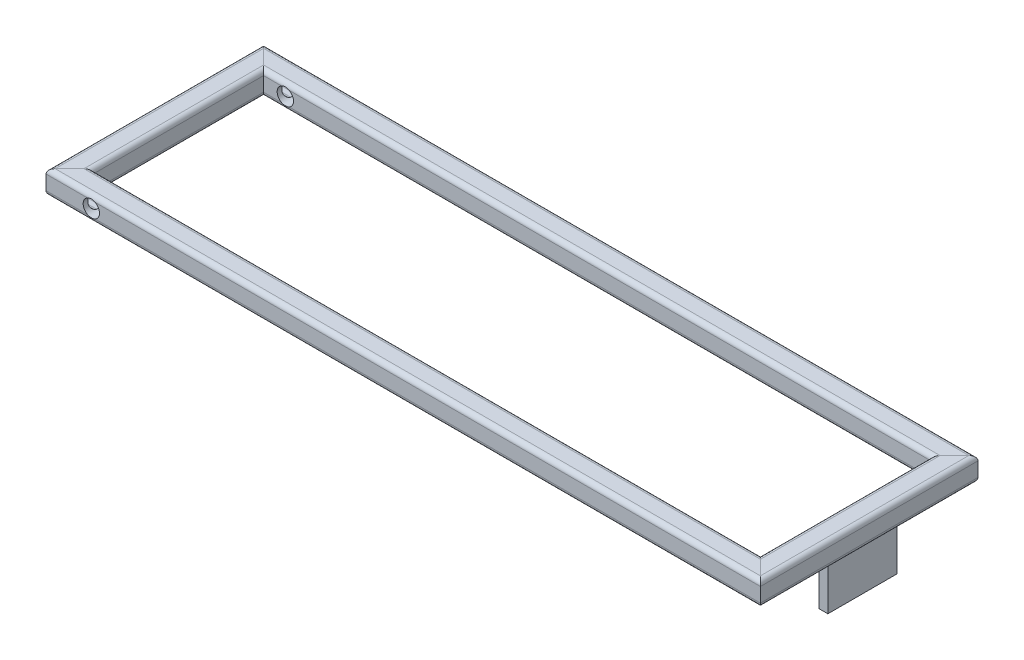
ISO-10303-21;
HEADER;
FILE_DESCRIPTION(('STEP AP214'),'2;1');
FILE_NAME('part.step','',(''),(''),'','','');
FILE_SCHEMA(('AUTOMOTIVE_DESIGN { 1 0 10303 214 1 1 1 1 }'));
ENDSEC;
DATA;
#1=APPLICATION_CONTEXT('core data for automotive mechanical design processes');
#2=APPLICATION_PROTOCOL_DEFINITION('international standard','automotive_design',2000,#1);
#3=PRODUCT_CONTEXT('',#1,'mechanical');
#4=PRODUCT('Part','Part','',(#3));
#5=PRODUCT_RELATED_PRODUCT_CATEGORY('part','',(#4));
#6=PRODUCT_DEFINITION_FORMATION('','',#4);
#7=PRODUCT_DEFINITION_CONTEXT('part definition',#1,'design');
#8=PRODUCT_DEFINITION('design','',#6,#7);
#9=PRODUCT_DEFINITION_SHAPE('','',#8);
#10=(LENGTH_UNIT() NAMED_UNIT(*) SI_UNIT(.MILLI.,.METRE.));
#11=(NAMED_UNIT(*) PLANE_ANGLE_UNIT() SI_UNIT($,.RADIAN.));
#12=(NAMED_UNIT(*) SI_UNIT($,.STERADIAN.) SOLID_ANGLE_UNIT());
#13=UNCERTAINTY_MEASURE_WITH_UNIT(LENGTH_MEASURE(1.E-05),#10,'distance_accuracy_value','');
#14=(GEOMETRIC_REPRESENTATION_CONTEXT(3) GLOBAL_UNCERTAINTY_ASSIGNED_CONTEXT((#13)) GLOBAL_UNIT_ASSIGNED_CONTEXT((#10,
#11,#12)) REPRESENTATION_CONTEXT('',''));
#15=CARTESIAN_POINT('',(0.,0.,0.));
#16=DIRECTION('',(0.,0.,1.));
#17=DIRECTION('',(1.,0.,0.));
#18=AXIS2_PLACEMENT_3D('',#15,#16,#17);
#19=CARTESIAN_POINT('',(188.2,-31.5,19.));
#20=DIRECTION('',(1.,0.,0.));
#21=DIRECTION('',(0.,0.,-1.));
#22=AXIS2_PLACEMENT_3D('',#19,#20,#21);
#23=PLANE('',#22);
#24=DIRECTION('',(0.,0.,-1.));
#25=VECTOR('',#24,1.);
#26=CARTESIAN_POINT('',(188.2,-6.5,19.));
#27=LINE('',#26,#25);
#28=CARTESIAN_POINT('',(188.2,-6.5,19.));
#29=VERTEX_POINT('',#28);
#30=CARTESIAN_POINT('',(188.2,-6.5,-19.));
#31=VERTEX_POINT('',#30);
#32=EDGE_CURVE('E141',#29,#31,#27,.T.);
#33=ORIENTED_EDGE('',*,*,#32,.T.);
#34=DIRECTION('',(0.,1.,0.));
#35=VECTOR('',#34,1.);
#36=CARTESIAN_POINT('',(188.2,-31.5,-19.));
#37=LINE('',#36,#35);
#38=CARTESIAN_POINT('',(188.2,-31.5,-19.));
#39=VERTEX_POINT('',#38);
#40=EDGE_CURVE('E13',#39,#31,#37,.T.);
#41=ORIENTED_EDGE('',*,*,#40,.F.);
#42=DIRECTION('',(0.,0.,-1.));
#43=VECTOR('',#42,1.);
#44=CARTESIAN_POINT('',(188.2,-31.5,19.));
#45=LINE('',#44,#43);
#46=CARTESIAN_POINT('',(188.2,-31.5,19.));
#47=VERTEX_POINT('',#46);
#48=EDGE_CURVE('E129',#47,#39,#45,.T.);
#49=ORIENTED_EDGE('',*,*,#48,.F.);
#50=DIRECTION('',(0.,1.,0.));
#51=VECTOR('',#50,1.);
#52=CARTESIAN_POINT('',(188.2,-31.5,19.));
#53=LINE('',#52,#51);
#54=EDGE_CURVE('E137',#47,#29,#53,.T.);
#55=ORIENTED_EDGE('',*,*,#54,.T.);
#56=EDGE_LOOP('',(#33,#41,#49,#55));
#57=FACE_BOUND('',#56,.T.);
#58=ADVANCED_FACE('F78',(#57),#23,.F.);
#59=CARTESIAN_POINT('',(188.2,-31.5,-19.));
#60=DIRECTION('',(0.,0.,1.));
#61=DIRECTION('',(1.,0.,0.));
#62=AXIS2_PLACEMENT_3D('',#59,#60,#61);
#63=PLANE('',#62);
#64=DIRECTION('',(1.,0.,0.));
#65=VECTOR('',#64,1.);
#66=CARTESIAN_POINT('',(188.2,-6.5,-19.));
#67=LINE('',#66,#65);
#68=CARTESIAN_POINT('',(193.2,-6.5,-19.));
#69=VERTEX_POINT('',#68);
#70=EDGE_CURVE('E133',#31,#69,#67,.T.);
#71=ORIENTED_EDGE('',*,*,#70,.T.);
#72=DIRECTION('',(0.,1.,0.));
#73=VECTOR('',#72,1.);
#74=CARTESIAN_POINT('',(193.2,-31.5,-19.));
#75=LINE('',#74,#73);
#76=CARTESIAN_POINT('',(193.2,-31.5,-19.));
#77=VERTEX_POINT('',#76);
#78=EDGE_CURVE('E86',#77,#69,#75,.T.);
#79=ORIENTED_EDGE('',*,*,#78,.F.);
#80=DIRECTION('',(1.,0.,0.));
#81=VECTOR('',#80,1.);
#82=CARTESIAN_POINT('',(188.2,-31.5,-19.));
#83=LINE('',#82,#81);
#84=EDGE_CURVE('E124',#39,#77,#83,.T.);
#85=ORIENTED_EDGE('',*,*,#84,.F.);
#86=ORIENTED_EDGE('',*,*,#40,.T.);
#87=EDGE_LOOP('',(#71,#79,#85,#86));
#88=FACE_BOUND('',#87,.T.);
#89=ADVANCED_FACE('F132',(#88),#63,.F.);
#90=CARTESIAN_POINT('',(193.2,-31.5,19.));
#91=DIRECTION('',(-1.,0.,0.));
#92=DIRECTION('',(0.,0.,1.));
#93=AXIS2_PLACEMENT_3D('',#90,#91,#92);
#94=PLANE('',#93);
#95=DIRECTION('',(0.,0.,1.));
#96=VECTOR('',#95,1.);
#97=CARTESIAN_POINT('',(193.2,-6.5,19.));
#98=LINE('',#97,#96);
#99=CARTESIAN_POINT('',(193.2,-6.5,19.));
#100=VERTEX_POINT('',#99);
#101=EDGE_CURVE('E111',#69,#100,#98,.T.);
#102=ORIENTED_EDGE('',*,*,#101,.T.);
#103=DIRECTION('',(0.,1.,0.));
#104=VECTOR('',#103,1.);
#105=CARTESIAN_POINT('',(193.2,-31.5,19.));
#106=LINE('',#105,#104);
#107=CARTESIAN_POINT('',(193.2,-31.5,19.));
#108=VERTEX_POINT('',#107);
#109=EDGE_CURVE('E134',#108,#100,#106,.T.);
#110=ORIENTED_EDGE('',*,*,#109,.F.);
#111=DIRECTION('',(0.,0.,1.));
#112=VECTOR('',#111,1.);
#113=CARTESIAN_POINT('',(193.2,-31.5,19.));
#114=LINE('',#113,#112);
#115=EDGE_CURVE('E127',#77,#108,#114,.T.);
#116=ORIENTED_EDGE('',*,*,#115,.F.);
#117=ORIENTED_EDGE('',*,*,#78,.T.);
#118=EDGE_LOOP('',(#102,#110,#116,#117));
#119=FACE_BOUND('',#118,.T.);
#120=ADVANCED_FACE('F135',(#119),#94,.F.);
#121=CARTESIAN_POINT('',(188.2,-31.5,19.));
#122=DIRECTION('',(0.,0.,-1.));
#123=DIRECTION('',(-1.,0.,0.));
#124=AXIS2_PLACEMENT_3D('',#121,#122,#123);
#125=PLANE('',#124);
#126=DIRECTION('',(-1.,0.,0.));
#127=VECTOR('',#126,1.);
#128=CARTESIAN_POINT('',(188.2,-6.5,19.));
#129=LINE('',#128,#127);
#130=EDGE_CURVE('E117',#100,#29,#129,.T.);
#131=ORIENTED_EDGE('',*,*,#130,.T.);
#132=ORIENTED_EDGE('',*,*,#54,.F.);
#133=DIRECTION('',(-1.,0.,0.));
#134=VECTOR('',#133,1.);
#135=CARTESIAN_POINT('',(188.2,-31.5,19.));
#136=LINE('',#135,#134);
#137=EDGE_CURVE('E94',#108,#47,#136,.T.);
#138=ORIENTED_EDGE('',*,*,#137,.F.);
#139=ORIENTED_EDGE('',*,*,#109,.T.);
#140=EDGE_LOOP('',(#131,#132,#138,#139));
#141=FACE_BOUND('',#140,.T.);
#142=ADVANCED_FACE('F148',(#141),#125,.F.);
#143=CARTESIAN_POINT('',(188.2,-31.5,-19.));
#144=DIRECTION('',(0.,-1.,0.));
#145=DIRECTION('',(0.,0.,-1.));
#146=AXIS2_PLACEMENT_3D('',#143,#144,#145);
#147=PLANE('',#146);
#148=ORIENTED_EDGE('',*,*,#48,.T.);
#149=ORIENTED_EDGE('',*,*,#84,.T.);
#150=ORIENTED_EDGE('',*,*,#115,.T.);
#151=ORIENTED_EDGE('',*,*,#137,.T.);
#152=EDGE_LOOP('',(#148,#149,#150,#151));
#153=FACE_BOUND('',#152,.T.);
#154=ADVANCED_FACE('F125',(#153),#147,.T.);
#155=CARTESIAN_POINT('',(188.2,-6.5,-19.));
#156=DIRECTION('',(0.,-1.,0.));
#157=DIRECTION('',(0.,0.,-1.));
#158=AXIS2_PLACEMENT_3D('',#155,#156,#157);
#159=PLANE('',#158);
#160=ORIENTED_EDGE('',*,*,#32,.F.);
#161=ORIENTED_EDGE('',*,*,#130,.F.);
#162=ORIENTED_EDGE('',*,*,#101,.F.);
#163=ORIENTED_EDGE('',*,*,#70,.F.);
#164=EDGE_LOOP('',(#160,#161,#162,#163));
#165=FACE_BOUND('',#164,.T.);
#166=ADVANCED_FACE('F151',(#165),#159,.F.);
#167=CLOSED_SHELL('',(#58,#89,#120,#142,#154,#166));
#168=MANIFOLD_SOLID_BREP('B2',#167);
#169=CARTESIAN_POINT('',(190.5,3.96,47.));
#170=DIRECTION('',(0.,0.,1.));
#171=DIRECTION('',(1.,0.,0.));
#172=AXIS2_PLACEMENT_3D('',#169,#170,#171);
#173=PLANE('',#172);
#174=DIRECTION('',(-1.,0.,0.));
#175=VECTOR('',#174,1.);
#176=CARTESIAN_POINT('',(190.5,3.96,47.));
#177=LINE('',#176,#175);
#178=CARTESIAN_POINT('',(-174.137381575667,3.96,47.));
#179=VERTEX_POINT('',#178);
#180=CARTESIAN_POINT('',(-184.,3.96,47.));
#181=VERTEX_POINT('',#180);
#182=EDGE_CURVE('E474',#179,#181,#177,.T.);
#183=ORIENTED_EDGE('',*,*,#182,.F.);
#184=CARTESIAN_POINT('',(-172.,0.,47.));
#185=DIRECTION('',(0.,0.,1.));
#186=DIRECTION('',(1.,0.,0.));
#187=AXIS2_PLACEMENT_3D('',#184,#185,#186);
#188=CIRCLE('',#187,4.49999999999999);
#189=CARTESIAN_POINT('',(-174.137381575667,-3.96,47.));
#190=VERTEX_POINT('',#189);
#191=EDGE_CURVE('E227',#179,#190,#188,.T.);
#192=ORIENTED_EDGE('',*,*,#191,.T.);
#193=DIRECTION('',(-1.,0.,0.));
#194=VECTOR('',#193,1.);
#195=CARTESIAN_POINT('',(190.5,-3.96,47.));
#196=LINE('',#195,#194);
#197=CARTESIAN_POINT('',(-184.,-3.96,47.));
#198=VERTEX_POINT('',#197);
#199=EDGE_CURVE('E478',#190,#198,#196,.T.);
#200=ORIENTED_EDGE('',*,*,#199,.T.);
#201=DIRECTION('',(0.,-1.,0.));
#202=VECTOR('',#201,1.);
#203=CARTESIAN_POINT('',(-184.,3.96,47.));
#204=LINE('',#203,#202);
#205=EDGE_CURVE('E628',#181,#198,#204,.T.);
#206=ORIENTED_EDGE('',*,*,#205,.F.);
#207=EDGE_LOOP('',(#183,#192,#200,#206));
#208=FACE_BOUND('',#207,.T.);
#209=ADVANCED_FACE('F212',(#208),#173,.F.);
#210=CARTESIAN_POINT('',(190.5,1.42,54.92));
#211=DIRECTION('',(-1.,0.,0.));
#212=DIRECTION('',(0.,0.,1.));
#213=AXIS2_PLACEMENT_3D('',#210,#211,#212);
#214=CYLINDRICAL_SURFACE('',#213,2.54);
#215=CARTESIAN_POINT('',(-169.862618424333,3.96,54.92));
#216=CARTESIAN_POINT('',(-169.862639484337,3.96000667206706,54.9593300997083));
#217=CARTESIAN_POINT('',(-169.860924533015,3.95908604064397,54.9986331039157));
#218=CARTESIAN_POINT('',(-169.854214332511,3.95545532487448,55.0768025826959));
#219=CARTESIAN_POINT('',(-169.849225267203,3.95274861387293,55.1156697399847));
#220=CARTESIAN_POINT('',(-169.829836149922,3.94215767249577,55.2300128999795));
#221=CARTESIAN_POINT('',(-169.811000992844,3.9317978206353,55.3045295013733));
#222=CARTESIAN_POINT('',(-169.755128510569,3.90024400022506,55.4771377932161));
#223=CARTESIAN_POINT('',(-169.713881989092,3.87641972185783,55.5733219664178));
#224=CARTESIAN_POINT('',(-169.620371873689,3.81973601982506,55.7580373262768));
#225=CARTESIAN_POINT('',(-169.568017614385,3.78680151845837,55.8464965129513));
#226=CARTESIAN_POINT('',(-169.464038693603,3.71783695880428,56.0053891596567));
#227=CARTESIAN_POINT('',(-169.413131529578,3.68269987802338,56.0766967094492));
#228=CARTESIAN_POINT('',(-169.3085168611,3.60695061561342,56.2142236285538));
#229=CARTESIAN_POINT('',(-169.254807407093,3.56633459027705,56.2804393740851));
#230=CARTESIAN_POINT('',(-169.146011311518,3.47988205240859,56.4080938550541));
#231=CARTESIAN_POINT('',(-169.090925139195,3.43404730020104,56.4695341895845));
#232=CARTESIAN_POINT('',(-168.980349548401,3.33723146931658,56.5878323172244));
#233=CARTESIAN_POINT('',(-168.924860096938,3.28624996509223,56.6446897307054));
#234=CARTESIAN_POINT('',(-168.811049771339,3.17604026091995,56.7569718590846));
#235=CARTESIAN_POINT('',(-168.752752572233,3.11650446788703,56.8121194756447));
#236=CARTESIAN_POINT('',(-168.637410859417,2.99169170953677,56.9170055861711));
#237=CARTESIAN_POINT('',(-168.580366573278,2.92641371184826,56.9667431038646));
#238=CARTESIAN_POINT('',(-168.468370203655,2.79022337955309,57.0603034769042));
#239=CARTESIAN_POINT('',(-168.413415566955,2.71931827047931,57.1041337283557));
#240=CARTESIAN_POINT('',(-168.30629942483,2.57194341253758,57.1853287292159));
#241=CARTESIAN_POINT('',(-168.254137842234,2.49547381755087,57.2226936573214));
#242=CARTESIAN_POINT('',(-168.127370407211,2.2962753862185,57.307616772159));
#243=CARTESIAN_POINT('',(-168.055027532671,2.16999141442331,57.3505259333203));
#244=CARTESIAN_POINT('',(-167.954890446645,1.97295145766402,57.4000061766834));
#245=CARTESIAN_POINT('',(-167.922934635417,1.90607118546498,57.4140125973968));
#246=CARTESIAN_POINT('',(-167.862077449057,1.77006449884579,57.436703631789));
#247=CARTESIAN_POINT('',(-167.833174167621,1.70093952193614,57.4453915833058));
#248=CARTESIAN_POINT('',(-167.792431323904,1.59617092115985,57.4541237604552));
#249=CARTESIAN_POINT('',(-167.779323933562,1.56118271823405,57.4563176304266));
#250=CARTESIAN_POINT('',(-167.753970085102,1.49084772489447,57.459255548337));
#251=CARTESIAN_POINT('',(-167.74172336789,1.45550104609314,57.4600000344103));
#252=CARTESIAN_POINT('',(-167.729918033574,1.42000000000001,57.46));
#253=B_SPLINE_CURVE_WITH_KNOTS('',3,(#215,#216,#217,#218,#219,#220,#221,#222,#223,#224,#225,
#226,#227,#228,#229,#230,#231,#232,#233,#234,#235,#236,#237,#238,#239,#240,#241,#242,#243,#244,
#245,#246,#247,#248,#249,#250,#251,#252),.UNSPECIFIED.,.F.,.F.,(4,2,2,2,2,2,2,2,2,2,2,2,2,2,2,2,
2,2,4),(0.,0.117894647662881,0.235567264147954,0.467077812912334,0.787298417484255,
1.11024090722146,1.3930603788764,1.67607930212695,1.95900304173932,2.24195019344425,
2.54140438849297,2.84091253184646,3.14004212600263,3.43916345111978,3.89220998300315,
4.11829404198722,4.34423606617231,4.45648352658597,4.5686970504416),.UNSPECIFIED.);
#254=CARTESIAN_POINT('',(-169.862618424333,3.96,54.92));
#255=VERTEX_POINT('',#254);
#256=CARTESIAN_POINT('',(-167.729918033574,1.42,57.46));
#257=VERTEX_POINT('',#256);
#258=EDGE_CURVE('E235',#255,#257,#253,.T.);
#259=ORIENTED_EDGE('',*,*,#258,.F.);
#260=DIRECTION('',(-1.,0.,0.));
#261=VECTOR('',#260,1.);
#262=CARTESIAN_POINT('',(190.5,3.96,54.92));
#263=LINE('',#262,#261);
#264=CARTESIAN_POINT('',(191.92,3.96,54.92));
#265=VERTEX_POINT('',#264);
#266=EDGE_CURVE('E455',#265,#255,#263,.T.);
#267=ORIENTED_EDGE('',*,*,#266,.F.);
#268=CARTESIAN_POINT('',(191.92,1.42,54.92));
#269=DIRECTION('',(0.707106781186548,0.,-0.707106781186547));
#270=DIRECTION('',(-0.707106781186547,0.,-0.707106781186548));
#271=AXIS2_PLACEMENT_3D('',#268,#269,#270);
#272=ELLIPSE('',#271,3.59210244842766,2.54);
#273=CARTESIAN_POINT('',(194.46,1.42,57.46));
#274=VERTEX_POINT('',#273);
#275=EDGE_CURVE('E680',#265,#274,#272,.T.);
#276=ORIENTED_EDGE('',*,*,#275,.T.);
#277=DIRECTION('',(-1.,0.,0.));
#278=VECTOR('',#277,1.);
#279=CARTESIAN_POINT('',(190.5,1.42,57.46));
#280=LINE('',#279,#278);
#281=EDGE_CURVE('E460',#274,#257,#280,.T.);
#282=ORIENTED_EDGE('',*,*,#281,.T.);
#283=EDGE_LOOP('',(#259,#267,#276,#282));
#284=FACE_BOUND('',#283,.T.);
#285=ADVANCED_FACE('F616',(#284),#214,.F.);
#286=CARTESIAN_POINT('',(190.5,3.96,54.92));
#287=DIRECTION('',(0.,-1.,0.));
#288=DIRECTION('',(0.,0.,-1.));
#289=AXIS2_PLACEMENT_3D('',#286,#287,#288);
#290=PLANE('',#289);
#291=DIRECTION('',(0.,0.,1.));
#292=VECTOR('',#291,1.);
#293=CARTESIAN_POINT('',(-169.862618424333,3.96,-60.));
#294=LINE('',#293,#292);
#295=CARTESIAN_POINT('',(-169.862618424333,3.96,52.08));
#296=VERTEX_POINT('',#295);
#297=EDGE_CURVE('E803',#296,#255,#294,.T.);
#298=ORIENTED_EDGE('',*,*,#297,.F.);
#299=DIRECTION('',(-1.,0.,0.));
#300=VECTOR('',#299,1.);
#301=CARTESIAN_POINT('',(190.5,3.96,52.08));
#302=LINE('',#301,#300);
#303=CARTESIAN_POINT('',(189.08,3.96,52.08));
#304=VERTEX_POINT('',#303);
#305=EDGE_CURVE('E450',#304,#296,#302,.T.);
#306=ORIENTED_EDGE('',*,*,#305,.F.);
#307=DIRECTION('',(0.707106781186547,0.,0.707106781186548));
#308=VECTOR('',#307,1.);
#309=CARTESIAN_POINT('',(191.21,3.96,54.21));
#310=LINE('',#309,#308);
#311=EDGE_CURVE('E683',#304,#265,#310,.T.);
#312=ORIENTED_EDGE('',*,*,#311,.T.);
#313=ORIENTED_EDGE('',*,*,#266,.T.);
#314=EDGE_LOOP('',(#298,#306,#312,#313));
#315=FACE_BOUND('',#314,.T.);
#316=ADVANCED_FACE('F621',(#315),#290,.T.);
#317=CARTESIAN_POINT('',(190.5,1.42,52.08));
#318=DIRECTION('',(-1.,0.,0.));
#319=DIRECTION('',(0.,0.,1.));
#320=AXIS2_PLACEMENT_3D('',#317,#318,#319);
#321=CYLINDRICAL_SURFACE('',#320,2.54);
#322=CARTESIAN_POINT('',(-167.729918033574,1.42,49.54));
#323=CARTESIAN_POINT('',(-167.754380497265,1.49361455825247,49.5399903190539));
#324=CARTESIAN_POINT('',(-167.780765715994,1.56654951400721,49.5431991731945));
#325=CARTESIAN_POINT('',(-167.837029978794,1.7104385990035,49.5556308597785));
#326=CARTESIAN_POINT('',(-167.86690475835,1.78139501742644,49.5648464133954));
#327=CARTESIAN_POINT('',(-167.929600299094,1.92031687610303,49.5887723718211));
#328=CARTESIAN_POINT('',(-167.962395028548,1.98830199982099,49.603437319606));
#329=CARTESIAN_POINT('',(-168.030778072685,2.12153048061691,49.6378305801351));
#330=CARTESIAN_POINT('',(-168.066367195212,2.18677303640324,49.6575603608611));
#331=CARTESIAN_POINT('',(-168.176412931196,2.37730314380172,49.7234856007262));
#332=CARTESIAN_POINT('',(-168.254510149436,2.49818443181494,49.7765619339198));
#333=CARTESIAN_POINT('',(-168.417639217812,2.72700509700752,49.8982099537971));
#334=CARTESIAN_POINT('',(-168.502688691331,2.83490975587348,49.9668218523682));
#335=CARTESIAN_POINT('',(-168.693777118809,3.0568269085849,50.1319096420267));
#336=CARTESIAN_POINT('',(-168.80069928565,3.16799962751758,50.2312075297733));
#337=CARTESIAN_POINT('',(-168.961647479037,3.3202258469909,50.3929269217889));
#338=CARTESIAN_POINT('',(-169.015408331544,3.36855891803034,50.4489821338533));
#339=CARTESIAN_POINT('',(-169.12237147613,3.46037763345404,50.5654201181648));
#340=CARTESIAN_POINT('',(-169.175573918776,3.50386461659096,50.6258016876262));
#341=CARTESIAN_POINT('',(-169.302653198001,3.60323061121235,50.7775126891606));
#342=CARTESIAN_POINT('',(-169.375777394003,3.65659198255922,50.8711468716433));
#343=CARTESIAN_POINT('',(-169.51501364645,3.75259042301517,51.0687242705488));
#344=CARTESIAN_POINT('',(-169.581132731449,3.79523830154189,51.1726569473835));
#345=CARTESIAN_POINT('',(-169.67879067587,3.85539636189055,51.3546141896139));
#346=CARTESIAN_POINT('',(-169.714395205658,3.87650494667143,51.42922856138));
#347=CARTESIAN_POINT('',(-169.776145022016,3.91225442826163,51.5835221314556));
#348=CARTESIAN_POINT('',(-169.802334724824,3.9269257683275,51.6631754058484));
#349=CARTESIAN_POINT('',(-169.835051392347,3.94502694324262,51.7992356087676));
#350=CARTESIAN_POINT('',(-169.845227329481,3.95057692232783,51.8544752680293));
#351=CARTESIAN_POINT('',(-169.859084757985,3.95809330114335,51.9664332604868));
#352=CARTESIAN_POINT('',(-169.862714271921,3.96003102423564,52.0231598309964));
#353=CARTESIAN_POINT('',(-169.862618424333,3.96,52.08));
#354=B_SPLINE_CURVE_WITH_KNOTS('',3,(#322,#323,#324,#325,#326,#327,#328,#329,#330,#331,#332,
#333,#334,#335,#336,#337,#338,#339,#340,#341,#342,#343,#344,#345,#346,#347,#348,#349,#350,#351,
#352,#353),.UNSPECIFIED.,.F.,.F.,(4,2,2,2,2,2,2,2,2,2,2,2,2,2,2,4),(0.,0.232568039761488,
0.464854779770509,0.695245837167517,0.925703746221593,1.38400317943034,1.84350270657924,
2.39167589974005,2.66593811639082,2.94012437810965,3.33004814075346,3.71957689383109,
3.97490632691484,4.22901487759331,4.39786474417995,4.56804944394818),.UNSPECIFIED.);
#355=CARTESIAN_POINT('',(-167.729918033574,1.42,49.54));
#356=VERTEX_POINT('',#355);
#357=EDGE_CURVE('E570',#356,#296,#354,.T.);
#358=ORIENTED_EDGE('',*,*,#357,.F.);
#359=DIRECTION('',(-1.,0.,0.));
#360=VECTOR('',#359,1.);
#361=CARTESIAN_POINT('',(190.5,1.42,49.54));
#362=LINE('',#361,#360);
#363=CARTESIAN_POINT('',(186.54,1.42,49.54));
#364=VERTEX_POINT('',#363);
#365=EDGE_CURVE('E445',#364,#356,#362,.T.);
#366=ORIENTED_EDGE('',*,*,#365,.F.);
#367=CARTESIAN_POINT('',(189.08,1.42,52.08));
#368=DIRECTION('',(0.707106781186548,0.,-0.707106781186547));
#369=DIRECTION('',(-0.707106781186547,0.,-0.707106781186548));
#370=AXIS2_PLACEMENT_3D('',#367,#368,#369);
#371=ELLIPSE('',#370,3.59210244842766,2.54);
#372=EDGE_CURVE('E686',#364,#304,#371,.T.);
#373=ORIENTED_EDGE('',*,*,#372,.T.);
#374=ORIENTED_EDGE('',*,*,#305,.T.);
#375=EDGE_LOOP('',(#358,#366,#373,#374));
#376=FACE_BOUND('',#375,.T.);
#377=ADVANCED_FACE('F768',(#376),#321,.F.);
#378=CARTESIAN_POINT('',(190.5,1.42,49.54));
#379=DIRECTION('',(0.,0.,1.));
#380=DIRECTION('',(1.,0.,0.));
#381=AXIS2_PLACEMENT_3D('',#378,#379,#380);
#382=PLANE('',#381);
#383=CARTESIAN_POINT('',(-172.,0.,49.54));
#384=DIRECTION('',(0.,0.,1.));
#385=DIRECTION('',(1.,0.,0.));
#386=AXIS2_PLACEMENT_3D('',#383,#384,#385);
#387=CIRCLE('',#386,4.49999999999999);
#388=CARTESIAN_POINT('',(-176.270081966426,1.42,49.54));
#389=VERTEX_POINT('',#388);
#390=CARTESIAN_POINT('',(-176.270081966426,-1.42,49.54));
#391=VERTEX_POINT('',#390);
#392=EDGE_CURVE('E796',#389,#391,#387,.T.);
#393=ORIENTED_EDGE('',*,*,#392,.F.);
#394=CARTESIAN_POINT('',(-186.54,1.42,49.54));
#395=VERTEX_POINT('',#394);
#396=EDGE_CURVE('E449',#389,#395,#362,.T.);
#397=ORIENTED_EDGE('',*,*,#396,.T.);
#398=DIRECTION('',(0.,-1.,0.));
#399=VECTOR('',#398,1.);
#400=CARTESIAN_POINT('',(-186.54,1.42,49.54));
#401=LINE('',#400,#399);
#402=CARTESIAN_POINT('',(-186.54,-1.42,49.54));
#403=VERTEX_POINT('',#402);
#404=EDGE_CURVE('E448',#395,#403,#401,.T.);
#405=ORIENTED_EDGE('',*,*,#404,.T.);
#406=DIRECTION('',(-1.,0.,0.));
#407=VECTOR('',#406,1.);
#408=CARTESIAN_POINT('',(190.5,-1.42,49.54));
#409=LINE('',#408,#407);
#410=EDGE_CURVE('E444',#391,#403,#409,.T.);
#411=ORIENTED_EDGE('',*,*,#410,.F.);
#412=EDGE_LOOP('',(#393,#397,#405,#411));
#413=FACE_BOUND('',#412,.T.);
#414=ADVANCED_FACE('F762',(#413),#382,.T.);
#415=CARTESIAN_POINT('',(190.5,-1.42,52.08));
#416=DIRECTION('',(-1.,0.,0.));
#417=DIRECTION('',(0.,0.,1.));
#418=AXIS2_PLACEMENT_3D('',#415,#416,#417);
#419=CYLINDRICAL_SURFACE('',#418,2.54);
#420=CARTESIAN_POINT('',(-169.862618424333,-3.96,52.08));
#421=CARTESIAN_POINT('',(-169.862639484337,-3.96000667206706,52.0406699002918));
#422=CARTESIAN_POINT('',(-169.860924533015,-3.95908604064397,52.0013668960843));
#423=CARTESIAN_POINT('',(-169.854214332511,-3.95545532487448,51.9231974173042));
#424=CARTESIAN_POINT('',(-169.849225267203,-3.95274861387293,51.8843302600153));
#425=CARTESIAN_POINT('',(-169.829836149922,-3.94215767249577,51.7699871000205));
#426=CARTESIAN_POINT('',(-169.811000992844,-3.9317978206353,51.6954704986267));
#427=CARTESIAN_POINT('',(-169.755128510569,-3.90024400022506,51.5228622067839));
#428=CARTESIAN_POINT('',(-169.713881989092,-3.87641972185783,51.4266780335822));
#429=CARTESIAN_POINT('',(-169.620371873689,-3.81973601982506,51.2419626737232));
#430=CARTESIAN_POINT('',(-169.568017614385,-3.78680151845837,51.1535034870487));
#431=CARTESIAN_POINT('',(-169.464038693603,-3.71783695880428,50.9946108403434));
#432=CARTESIAN_POINT('',(-169.413131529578,-3.68269987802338,50.9233032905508));
#433=CARTESIAN_POINT('',(-169.3085168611,-3.60695061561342,50.7857763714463));
#434=CARTESIAN_POINT('',(-169.254807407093,-3.56633459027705,50.7195606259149));
#435=CARTESIAN_POINT('',(-169.146011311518,-3.47988205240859,50.5919061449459));
#436=CARTESIAN_POINT('',(-169.090925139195,-3.43404730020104,50.5304658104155));
#437=CARTESIAN_POINT('',(-168.980349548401,-3.33723146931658,50.4121676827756));
#438=CARTESIAN_POINT('',(-168.924860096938,-3.28624996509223,50.3553102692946));
#439=CARTESIAN_POINT('',(-168.811049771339,-3.17604026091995,50.2430281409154));
#440=CARTESIAN_POINT('',(-168.752752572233,-3.11650446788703,50.1878805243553));
#441=CARTESIAN_POINT('',(-168.637410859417,-2.99169170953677,50.0829944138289));
#442=CARTESIAN_POINT('',(-168.580366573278,-2.92641371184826,50.0332568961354));
#443=CARTESIAN_POINT('',(-168.468370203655,-2.79022337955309,49.9396965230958));
#444=CARTESIAN_POINT('',(-168.413415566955,-2.71931827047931,49.8958662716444));
#445=CARTESIAN_POINT('',(-168.30629942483,-2.57194341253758,49.8146712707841));
#446=CARTESIAN_POINT('',(-168.254137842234,-2.49547381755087,49.7773063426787));
#447=CARTESIAN_POINT('',(-168.127370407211,-2.2962753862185,49.692383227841));
#448=CARTESIAN_POINT('',(-168.055027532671,-2.16999141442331,49.6494740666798));
#449=CARTESIAN_POINT('',(-167.954890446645,-1.97295145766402,49.5999938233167));
#450=CARTESIAN_POINT('',(-167.922934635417,-1.90607118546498,49.5859874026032));
#451=CARTESIAN_POINT('',(-167.862077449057,-1.77006449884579,49.563296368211));
#452=CARTESIAN_POINT('',(-167.833174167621,-1.70093952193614,49.5546084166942));
#453=CARTESIAN_POINT('',(-167.792431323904,-1.59617092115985,49.5458762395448));
#454=CARTESIAN_POINT('',(-167.779323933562,-1.56118271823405,49.5436823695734));
#455=CARTESIAN_POINT('',(-167.753970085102,-1.49084772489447,49.540744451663));
#456=CARTESIAN_POINT('',(-167.74172336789,-1.45550104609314,49.5399999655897));
#457=CARTESIAN_POINT('',(-167.729918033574,-1.42000000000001,49.54));
#458=B_SPLINE_CURVE_WITH_KNOTS('',3,(#420,#421,#422,#423,#424,#425,#426,#427,#428,#429,#430,
#431,#432,#433,#434,#435,#436,#437,#438,#439,#440,#441,#442,#443,#444,#445,#446,#447,#448,#449,
#450,#451,#452,#453,#454,#455,#456,#457),.UNSPECIFIED.,.F.,.F.,(4,2,2,2,2,2,2,2,2,2,2,2,2,2,2,2,
2,2,4),(0.,0.117894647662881,0.235567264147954,0.467077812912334,0.787298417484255,
1.11024090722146,1.3930603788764,1.67607930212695,1.95900304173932,2.24195019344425,
2.54140438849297,2.84091253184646,3.14004212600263,3.43916345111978,3.89220998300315,
4.11829404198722,4.34423606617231,4.45648352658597,4.5686970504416),.UNSPECIFIED.);
#459=CARTESIAN_POINT('',(-169.862618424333,-3.96,52.08));
#460=VERTEX_POINT('',#459);
#461=CARTESIAN_POINT('',(-167.729918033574,-1.42,49.54));
#462=VERTEX_POINT('',#461);
#463=EDGE_CURVE('E563',#460,#462,#458,.T.);
#464=ORIENTED_EDGE('',*,*,#463,.F.);
#465=DIRECTION('',(-1.,0.,0.));
#466=VECTOR('',#465,1.);
#467=CARTESIAN_POINT('',(190.5,-3.96,52.08));
#468=LINE('',#467,#466);
#469=CARTESIAN_POINT('',(189.08,-3.96,52.08));
#470=VERTEX_POINT('',#469);
#471=EDGE_CURVE('E435',#470,#460,#468,.T.);
#472=ORIENTED_EDGE('',*,*,#471,.F.);
#473=CARTESIAN_POINT('',(189.08,-1.42,52.08));
#474=DIRECTION('',(0.707106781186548,0.,-0.707106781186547));
#475=DIRECTION('',(-0.707106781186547,0.,-0.707106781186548));
#476=AXIS2_PLACEMENT_3D('',#473,#474,#475);
#477=ELLIPSE('',#476,3.59210244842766,2.54);
#478=CARTESIAN_POINT('',(186.54,-1.42,49.54));
#479=VERTEX_POINT('',#478);
#480=EDGE_CURVE('E692',#470,#479,#477,.T.);
#481=ORIENTED_EDGE('',*,*,#480,.T.);
#482=EDGE_CURVE('E440',#479,#462,#409,.T.);
#483=ORIENTED_EDGE('',*,*,#482,.T.);
#484=EDGE_LOOP('',(#464,#472,#481,#483));
#485=FACE_BOUND('',#484,.T.);
#486=ADVANCED_FACE('F757',(#485),#419,.F.);
#487=CARTESIAN_POINT('',(190.5,-3.96,54.92));
#488=DIRECTION('',(0.,1.,0.));
#489=DIRECTION('',(0.,0.,1.));
#490=AXIS2_PLACEMENT_3D('',#487,#488,#489);
#491=PLANE('',#490);
#492=DIRECTION('',(0.,0.,1.));
#493=VECTOR('',#492,1.);
#494=CARTESIAN_POINT('',(-174.137381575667,-3.96,-60.));
#495=LINE('',#494,#493);
#496=CARTESIAN_POINT('',(-174.137381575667,-3.96,52.08));
#497=VERTEX_POINT('',#496);
#498=CARTESIAN_POINT('',(-174.137381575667,-3.96,54.92));
#499=VERTEX_POINT('',#498);
#500=EDGE_CURVE('E800',#497,#499,#495,.T.);
#501=ORIENTED_EDGE('',*,*,#500,.F.);
#502=CARTESIAN_POINT('',(-189.08,-3.96,52.08));
#503=VERTEX_POINT('',#502);
#504=EDGE_CURVE('E439',#497,#503,#468,.T.);
#505=ORIENTED_EDGE('',*,*,#504,.T.);
#506=DIRECTION('',(-0.707106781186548,0.,0.707106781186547));
#507=VECTOR('',#506,1.);
#508=CARTESIAN_POINT('',(-0.709999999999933,-3.96,-136.29));
#509=LINE('',#508,#507);
#510=CARTESIAN_POINT('',(-191.92,-3.96,54.92));
#511=VERTEX_POINT('',#510);
#512=EDGE_CURVE('E438',#503,#511,#509,.T.);
#513=ORIENTED_EDGE('',*,*,#512,.T.);
#514=DIRECTION('',(-1.,0.,0.));
#515=VECTOR('',#514,1.);
#516=CARTESIAN_POINT('',(190.5,-3.96,54.92));
#517=LINE('',#516,#515);
#518=EDGE_CURVE('E434',#499,#511,#517,.T.);
#519=ORIENTED_EDGE('',*,*,#518,.F.);
#520=EDGE_LOOP('',(#501,#505,#513,#519));
#521=FACE_BOUND('',#520,.T.);
#522=ADVANCED_FACE('F743',(#521),#491,.T.);
#523=CARTESIAN_POINT('',(190.5,-1.42,54.92));
#524=DIRECTION('',(-1.,0.,0.));
#525=DIRECTION('',(0.,0.,1.));
#526=AXIS2_PLACEMENT_3D('',#523,#524,#525);
#527=CYLINDRICAL_SURFACE('',#526,2.54);
#528=CARTESIAN_POINT('',(-167.729918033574,-1.42,57.46));
#529=CARTESIAN_POINT('',(-167.754380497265,-1.49361455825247,57.4600096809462));
#530=CARTESIAN_POINT('',(-167.780765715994,-1.56654951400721,57.4568008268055));
#531=CARTESIAN_POINT('',(-167.837029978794,-1.7104385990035,57.4443691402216));
#532=CARTESIAN_POINT('',(-167.86690475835,-1.78139501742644,57.4351535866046));
#533=CARTESIAN_POINT('',(-167.929600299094,-1.92031687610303,57.4112276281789));
#534=CARTESIAN_POINT('',(-167.962395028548,-1.98830199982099,57.396562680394));
#535=CARTESIAN_POINT('',(-168.030778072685,-2.12153048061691,57.3621694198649));
#536=CARTESIAN_POINT('',(-168.066367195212,-2.18677303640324,57.342439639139));
#537=CARTESIAN_POINT('',(-168.176412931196,-2.37730314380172,57.2765143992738));
#538=CARTESIAN_POINT('',(-168.254510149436,-2.49818443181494,57.2234380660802));
#539=CARTESIAN_POINT('',(-168.417639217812,-2.72700509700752,57.1017900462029));
#540=CARTESIAN_POINT('',(-168.502688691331,-2.83490975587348,57.0331781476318));
#541=CARTESIAN_POINT('',(-168.693777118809,-3.05682690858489,56.8680903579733));
#542=CARTESIAN_POINT('',(-168.80069928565,-3.16799962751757,56.7687924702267));
#543=CARTESIAN_POINT('',(-168.961647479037,-3.32022584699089,56.6070730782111));
#544=CARTESIAN_POINT('',(-169.015408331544,-3.36855891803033,56.5510178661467));
#545=CARTESIAN_POINT('',(-169.12237147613,-3.46037763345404,56.4345798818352));
#546=CARTESIAN_POINT('',(-169.175573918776,-3.50386461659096,56.3741983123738));
#547=CARTESIAN_POINT('',(-169.302653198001,-3.60323061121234,56.2224873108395));
#548=CARTESIAN_POINT('',(-169.375777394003,-3.65659198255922,56.1288531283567));
#549=CARTESIAN_POINT('',(-169.51501364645,-3.75259042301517,55.9312757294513));
#550=CARTESIAN_POINT('',(-169.581132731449,-3.79523830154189,55.8273430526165));
#551=CARTESIAN_POINT('',(-169.67879067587,-3.85539636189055,55.6453858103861));
#552=CARTESIAN_POINT('',(-169.714395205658,-3.87650494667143,55.5707714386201));
#553=CARTESIAN_POINT('',(-169.776145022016,-3.91225442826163,55.4164778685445));
#554=CARTESIAN_POINT('',(-169.802334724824,-3.9269257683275,55.3368245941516));
#555=CARTESIAN_POINT('',(-169.835051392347,-3.94502694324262,55.2007643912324));
#556=CARTESIAN_POINT('',(-169.845227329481,-3.95057692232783,55.1455247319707));
#557=CARTESIAN_POINT('',(-169.859084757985,-3.95809330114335,55.0335667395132));
#558=CARTESIAN_POINT('',(-169.862714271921,-3.96003102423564,54.9768401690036));
#559=CARTESIAN_POINT('',(-169.862618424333,-3.96,54.92));
#560=B_SPLINE_CURVE_WITH_KNOTS('',3,(#528,#529,#530,#531,#532,#533,#534,#535,#536,#537,#538,
#539,#540,#541,#542,#543,#544,#545,#546,#547,#548,#549,#550,#551,#552,#553,#554,#555,#556,#557,
#558,#559),.UNSPECIFIED.,.F.,.F.,(4,2,2,2,2,2,2,2,2,2,2,2,2,2,2,4),(0.,0.232568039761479,
0.46485477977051,0.695245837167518,0.925703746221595,1.38400317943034,1.84350270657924,
2.39167589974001,2.66593811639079,2.94012437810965,3.33004814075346,3.71957689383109,
3.97490632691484,4.22901487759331,4.39786474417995,4.56804944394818),.UNSPECIFIED.);
#561=CARTESIAN_POINT('',(-167.729918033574,-1.42,57.46));
#562=VERTEX_POINT('',#561);
#563=CARTESIAN_POINT('',(-169.862618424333,-3.96,54.92));
#564=VERTEX_POINT('',#563);
#565=EDGE_CURVE('E555',#562,#564,#560,.T.);
#566=ORIENTED_EDGE('',*,*,#565,.F.);
#567=DIRECTION('',(-1.,0.,0.));
#568=VECTOR('',#567,1.);
#569=CARTESIAN_POINT('',(190.5,-1.42,57.46));
#570=LINE('',#569,#568);
#571=CARTESIAN_POINT('',(194.46,-1.42,57.46));
#572=VERTEX_POINT('',#571);
#573=EDGE_CURVE('E425',#572,#562,#570,.T.);
#574=ORIENTED_EDGE('',*,*,#573,.F.);
#575=CARTESIAN_POINT('',(191.92,-1.42,54.92));
#576=DIRECTION('',(0.707106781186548,0.,-0.707106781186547));
#577=DIRECTION('',(-0.707106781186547,0.,-0.707106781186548));
#578=AXIS2_PLACEMENT_3D('',#575,#576,#577);
#579=ELLIPSE('',#578,3.59210244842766,2.54);
#580=CARTESIAN_POINT('',(191.92,-3.96,54.92));
#581=VERTEX_POINT('',#580);
#582=EDGE_CURVE('E696',#572,#581,#579,.T.);
#583=ORIENTED_EDGE('',*,*,#582,.T.);
#584=EDGE_CURVE('E430',#581,#564,#517,.T.);
#585=ORIENTED_EDGE('',*,*,#584,.T.);
#586=EDGE_LOOP('',(#566,#574,#583,#585));
#587=FACE_BOUND('',#586,.T.);
#588=ADVANCED_FACE('F738',(#587),#527,.F.);
#589=CARTESIAN_POINT('',(190.5,1.42,57.46));
#590=DIRECTION('',(0.,0.,-1.));
#591=DIRECTION('',(-1.,0.,0.));
#592=AXIS2_PLACEMENT_3D('',#589,#590,#591);
#593=PLANE('',#592);
#594=CARTESIAN_POINT('',(-172.,0.,57.46));
#595=DIRECTION('',(0.,0.,-1.));
#596=DIRECTION('',(-1.,0.,0.));
#597=AXIS2_PLACEMENT_3D('',#594,#595,#596);
#598=CIRCLE('',#597,4.49999999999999);
#599=EDGE_CURVE('E784',#257,#562,#598,.T.);
#600=ORIENTED_EDGE('',*,*,#599,.F.);
#601=ORIENTED_EDGE('',*,*,#281,.F.);
#602=DIRECTION('',(0.,-1.,0.));
#603=VECTOR('',#602,1.);
#604=CARTESIAN_POINT('',(194.46,1.42,57.46));
#605=LINE('',#604,#603);
#606=EDGE_CURVE('E420',#274,#572,#605,.T.);
#607=ORIENTED_EDGE('',*,*,#606,.T.);
#608=ORIENTED_EDGE('',*,*,#573,.T.);
#609=EDGE_LOOP('',(#600,#601,#607,#608));
#610=FACE_BOUND('',#609,.T.);
#611=ADVANCED_FACE('F733',(#610),#593,.T.);
#612=CARTESIAN_POINT('',(190.5,3.96,60.));
#613=DIRECTION('',(0.,0.,-1.));
#614=DIRECTION('',(-1.,0.,0.));
#615=AXIS2_PLACEMENT_3D('',#612,#613,#614);
#616=PLANE('',#615);
#617=DIRECTION('',(-1.,0.,0.));
#618=VECTOR('',#617,1.);
#619=CARTESIAN_POINT('',(190.5,3.96,60.));
#620=LINE('',#619,#618);
#621=CARTESIAN_POINT('',(197.,3.96,60.));
#622=VERTEX_POINT('',#621);
#623=CARTESIAN_POINT('',(-169.862618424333,3.96,60.));
#624=VERTEX_POINT('',#623);
#625=EDGE_CURVE('E407',#622,#624,#620,.T.);
#626=ORIENTED_EDGE('',*,*,#625,.T.);
#627=CARTESIAN_POINT('',(-172.,0.,60.));
#628=DIRECTION('',(0.,0.,-1.));
#629=DIRECTION('',(-1.,0.,0.));
#630=AXIS2_PLACEMENT_3D('',#627,#628,#629);
#631=CIRCLE('',#630,4.49999999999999);
#632=CARTESIAN_POINT('',(-169.862618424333,-3.96,60.));
#633=VERTEX_POINT('',#632);
#634=EDGE_CURVE('E76',#624,#633,#631,.T.);
#635=ORIENTED_EDGE('',*,*,#634,.T.);
#636=DIRECTION('',(-1.,0.,0.));
#637=VECTOR('',#636,1.);
#638=CARTESIAN_POINT('',(190.5,-3.96,60.));
#639=LINE('',#638,#637);
#640=CARTESIAN_POINT('',(197.,-3.96,60.));
#641=VERTEX_POINT('',#640);
#642=EDGE_CURVE('E484',#641,#633,#639,.T.);
#643=ORIENTED_EDGE('',*,*,#642,.F.);
#644=DIRECTION('',(0.,-1.,0.));
#645=VECTOR('',#644,1.);
#646=CARTESIAN_POINT('',(197.,3.96,60.));
#647=LINE('',#646,#645);
#648=EDGE_CURVE('E415',#622,#641,#647,.T.);
#649=ORIENTED_EDGE('',*,*,#648,.F.);
#650=EDGE_LOOP('',(#626,#635,#643,#649));
#651=FACE_BOUND('',#650,.T.);
#652=ADVANCED_FACE('F413',(#651),#616,.F.);
#653=CARTESIAN_POINT('',(190.5,-3.96,57.46));
#654=DIRECTION('',(-1.,0.,0.));
#655=DIRECTION('',(0.,0.,1.));
#656=AXIS2_PLACEMENT_3D('',#653,#654,#655);
#657=CYLINDRICAL_SURFACE('',#656,2.54);
#658=ORIENTED_EDGE('',*,*,#642,.T.);
#659=CARTESIAN_POINT('',(-169.862618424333,-3.96,60.));
#660=CARTESIAN_POINT('',(-169.95708441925,-4.01099506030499,59.9999763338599));
#661=CARTESIAN_POINT('',(-170.053359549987,-4.05858623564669,59.9984638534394));
#662=CARTESIAN_POINT('',(-170.24899325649,-4.1467416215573,59.9935168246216));
#663=CARTESIAN_POINT('',(-170.348350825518,-4.1873080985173,59.9900828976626));
#664=CARTESIAN_POINT('',(-170.549735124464,-4.26124972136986,59.982344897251));
#665=CARTESIAN_POINT('',(-170.651763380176,-4.29462065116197,59.9780403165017));
#666=CARTESIAN_POINT('',(-170.857956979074,-4.35399237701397,59.9694364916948));
#667=CARTESIAN_POINT('',(-170.96212265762,-4.37999200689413,59.9651372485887));
#668=CARTESIAN_POINT('',(-171.189449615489,-4.42816494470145,59.9566217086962));
#669=CARTESIAN_POINT('',(-171.312903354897,-4.44899431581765,59.9525367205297));
#670=CARTESIAN_POINT('',(-171.561170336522,-4.48029960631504,59.9461906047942));
#671=CARTESIAN_POINT('',(-171.685983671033,-4.49077481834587,59.9439296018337));
#672=CARTESIAN_POINT('',(-171.93610878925,-4.50128756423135,59.9416602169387));
#673=CARTESIAN_POINT('',(-172.061420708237,-4.5013220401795,59.9416524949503));
#674=CARTESIAN_POINT('',(-172.311582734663,-4.49094510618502,59.9438931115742));
#675=CARTESIAN_POINT('',(-172.436432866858,-4.48053426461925,59.9461413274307));
#676=CARTESIAN_POINT('',(-172.684084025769,-4.44944011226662,59.9524480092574));
#677=CARTESIAN_POINT('',(-172.806892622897,-4.42881482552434,59.9564962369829));
#678=CARTESIAN_POINT('',(-173.0503645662,-4.37746678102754,59.9655938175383));
#679=CARTESIAN_POINT('',(-173.171027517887,-4.34674218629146,59.9706433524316));
#680=CARTESIAN_POINT('',(-173.40915284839,-4.27547732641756,59.9805878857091));
#681=CARTESIAN_POINT('',(-173.52662124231,-4.23495716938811,59.9854831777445));
#682=CARTESIAN_POINT('',(-173.757804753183,-4.14433551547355,59.9937114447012));
#683=CARTESIAN_POINT('',(-173.871522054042,-4.09423971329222,59.9970453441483));
#684=CARTESIAN_POINT('',(-174.034949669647,-4.01401818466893,59.9995516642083));
#685=CARTESIAN_POINT('',(-174.086433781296,-3.98750115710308,59.9999954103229));
#686=CARTESIAN_POINT('',(-174.137381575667,-3.95999999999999,60.));
#687=B_SPLINE_CURVE_WITH_KNOTS('',3,(#659,#660,#661,#662,#663,#664,#665,#666,#667,#668,#669,
#670,#671,#672,#673,#674,#675,#676,#677,#678,#679,#680,#681,#682,#683,#684,#685,#686),
.UNSPECIFIED.,.F.,.F.,(4,2,2,2,2,2,2,2,2,2,2,2,2,4),(0.,0.321940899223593,0.643777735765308,
0.965802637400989,1.28787845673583,1.66322009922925,2.03858738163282,2.41406460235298,
2.78952139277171,3.16286941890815,3.53628539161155,3.90894123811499,4.28137614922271,
4.45506860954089),.UNSPECIFIED.);
#688=CARTESIAN_POINT('',(-174.137381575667,-3.96,60.));
#689=VERTEX_POINT('',#688);
#690=EDGE_CURVE('E400',#633,#689,#687,.T.);
#691=ORIENTED_EDGE('',*,*,#690,.T.);
#692=CARTESIAN_POINT('',(-197.,-3.96,60.));
#693=VERTEX_POINT('',#692);
#694=EDGE_CURVE('E485',#689,#693,#639,.T.);
#695=ORIENTED_EDGE('',*,*,#694,.T.);
#696=CARTESIAN_POINT('',(-194.46,-3.96,57.46));
#697=DIRECTION('',(-0.707106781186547,0.,-0.707106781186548));
#698=DIRECTION('',(-0.707106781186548,0.,0.707106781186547));
#699=AXIS2_PLACEMENT_3D('',#696,#697,#698);
#700=ELLIPSE('',#699,3.59210244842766,2.54);
#701=CARTESIAN_POINT('',(-194.46,-6.5,57.46));
#702=VERTEX_POINT('',#701);
#703=EDGE_CURVE('E662',#702,#693,#700,.T.);
#704=ORIENTED_EDGE('',*,*,#703,.F.);
#705=DIRECTION('',(-1.,0.,0.));
#706=VECTOR('',#705,1.);
#707=CARTESIAN_POINT('',(190.5,-6.5,57.46));
#708=LINE('',#707,#706);
#709=CARTESIAN_POINT('',(194.46,-6.5,57.46));
#710=VERTEX_POINT('',#709);
#711=EDGE_CURVE('E482',#710,#702,#708,.T.);
#712=ORIENTED_EDGE('',*,*,#711,.F.);
#713=CARTESIAN_POINT('',(194.46,-3.96,57.46));
#714=DIRECTION('',(0.707106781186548,0.,-0.707106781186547));
#715=DIRECTION('',(-0.707106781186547,0.,-0.707106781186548));
#716=AXIS2_PLACEMENT_3D('',#713,#714,#715);
#717=ELLIPSE('',#716,3.59210244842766,2.54);
#718=EDGE_CURVE('E418',#641,#710,#717,.T.);
#719=ORIENTED_EDGE('',*,*,#718,.F.);
#720=EDGE_LOOP('',(#658,#691,#695,#704,#712,#719));
#721=FACE_BOUND('',#720,.T.);
#722=ADVANCED_FACE('F506',(#721),#657,.T.);
#723=CARTESIAN_POINT('',(190.5,-6.5,57.46));
#724=DIRECTION('',(0.,1.,0.));
#725=DIRECTION('',(0.,0.,1.));
#726=AXIS2_PLACEMENT_3D('',#723,#724,#725);
#727=PLANE('',#726);
#728=DIRECTION('',(-0.707106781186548,0.,0.707106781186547));
#729=VECTOR('',#728,1.);
#730=CARTESIAN_POINT('',(-1.97999999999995,-6.5,-135.02));
#731=LINE('',#730,#729);
#732=CARTESIAN_POINT('',(-186.54,-6.5,49.54));
#733=VERTEX_POINT('',#732);
#734=EDGE_CURVE('E657',#733,#702,#731,.T.);
#735=ORIENTED_EDGE('',*,*,#734,.F.);
#736=DIRECTION('',(-1.,0.,0.));
#737=VECTOR('',#736,1.);
#738=CARTESIAN_POINT('',(190.5,-6.5,49.54));
#739=LINE('',#738,#737);
#740=CARTESIAN_POINT('',(186.54,-6.5,49.54));
#741=VERTEX_POINT('',#740);
#742=EDGE_CURVE('E479',#741,#733,#739,.T.);
#743=ORIENTED_EDGE('',*,*,#742,.F.);
#744=DIRECTION('',(-0.707106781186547,0.,-0.707106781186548));
#745=VECTOR('',#744,1.);
#746=CARTESIAN_POINT('',(192.48,-6.5,55.48));
#747=LINE('',#746,#745);
#748=EDGE_CURVE('E644',#710,#741,#747,.T.);
#749=ORIENTED_EDGE('',*,*,#748,.F.);
#750=ORIENTED_EDGE('',*,*,#711,.T.);
#751=EDGE_LOOP('',(#735,#743,#749,#750));
#752=FACE_BOUND('',#751,.T.);
#753=ADVANCED_FACE('F608',(#752),#727,.F.);
#754=CARTESIAN_POINT('',(190.5,-3.96,49.54));
#755=DIRECTION('',(-1.,0.,0.));
#756=DIRECTION('',(0.,0.,1.));
#757=AXIS2_PLACEMENT_3D('',#754,#755,#756);
#758=CYLINDRICAL_SURFACE('',#757,2.54);
#759=ORIENTED_EDGE('',*,*,#199,.F.);
#760=CARTESIAN_POINT('',(-174.137381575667,-3.96,47.));
#761=CARTESIAN_POINT('',(-174.04291558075,-4.01099506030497,47.0000236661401));
#762=CARTESIAN_POINT('',(-173.946640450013,-4.05858623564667,47.0015361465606));
#763=CARTESIAN_POINT('',(-173.751006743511,-4.14674162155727,47.0064831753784));
#764=CARTESIAN_POINT('',(-173.651649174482,-4.18730809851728,47.0099171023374));
#765=CARTESIAN_POINT('',(-173.450264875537,-4.26124972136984,47.017655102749));
#766=CARTESIAN_POINT('',(-173.348236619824,-4.29462065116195,47.0219596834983));
#767=CARTESIAN_POINT('',(-173.142043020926,-4.35399237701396,47.0305635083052));
#768=CARTESIAN_POINT('',(-173.03787734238,-4.37999200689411,47.0348627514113));
#769=CARTESIAN_POINT('',(-172.810550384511,-4.42816494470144,47.0433782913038));
#770=CARTESIAN_POINT('',(-172.687096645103,-4.44899431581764,47.0474632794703));
#771=CARTESIAN_POINT('',(-172.438829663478,-4.48029960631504,47.0538093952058));
#772=CARTESIAN_POINT('',(-172.314016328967,-4.49077481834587,47.0560703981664));
#773=CARTESIAN_POINT('',(-172.06389121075,-4.50128756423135,47.0583397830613));
#774=CARTESIAN_POINT('',(-171.938579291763,-4.5013220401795,47.0583475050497));
#775=CARTESIAN_POINT('',(-171.688417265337,-4.49094510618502,47.0561068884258));
#776=CARTESIAN_POINT('',(-171.563567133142,-4.48053426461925,47.0538586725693));
#777=CARTESIAN_POINT('',(-171.315915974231,-4.44944011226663,47.0475519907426));
#778=CARTESIAN_POINT('',(-171.193107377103,-4.42881482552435,47.0435037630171));
#779=CARTESIAN_POINT('',(-170.9496354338,-4.37746678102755,47.0344061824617));
#780=CARTESIAN_POINT('',(-170.828972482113,-4.34674218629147,47.0293566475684));
#781=CARTESIAN_POINT('',(-170.59084715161,-4.27547732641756,47.0194121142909));
#782=CARTESIAN_POINT('',(-170.47337875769,-4.23495716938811,47.0145168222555));
#783=CARTESIAN_POINT('',(-170.242195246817,-4.14433551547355,47.0062885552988));
#784=CARTESIAN_POINT('',(-170.128477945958,-4.09423971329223,47.0029546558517));
#785=CARTESIAN_POINT('',(-169.965050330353,-4.01401818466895,47.0004483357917));
#786=CARTESIAN_POINT('',(-169.913566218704,-3.98750115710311,47.0000045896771));
#787=CARTESIAN_POINT('',(-169.862618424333,-3.96000000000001,47.));
#788=B_SPLINE_CURVE_WITH_KNOTS('',3,(#760,#761,#762,#763,#764,#765,#766,#767,#768,#769,#770,
#771,#772,#773,#774,#775,#776,#777,#778,#779,#780,#781,#782,#783,#784,#785,#786,#787),
.UNSPECIFIED.,.F.,.F.,(4,2,2,2,2,2,2,2,2,2,2,2,2,4),(0.,0.321940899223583,0.643777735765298,
0.965802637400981,1.28787845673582,1.66322009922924,2.03858738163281,2.41406460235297,
2.78952139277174,3.16286941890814,3.53628539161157,3.90894123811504,4.28137614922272,
4.45506860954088),.UNSPECIFIED.);
#789=CARTESIAN_POINT('',(-169.862618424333,-3.96,47.));
#790=VERTEX_POINT('',#789);
#791=EDGE_CURVE('E490',#190,#790,#788,.T.);
#792=ORIENTED_EDGE('',*,*,#791,.T.);
#793=CARTESIAN_POINT('',(184.,-3.96,47.));
#794=VERTEX_POINT('',#793);
#795=EDGE_CURVE('E475',#794,#790,#196,.T.);
#796=ORIENTED_EDGE('',*,*,#795,.F.);
#797=CARTESIAN_POINT('',(186.54,-3.96,49.54));
#798=DIRECTION('',(0.707106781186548,0.,-0.707106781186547));
#799=DIRECTION('',(-0.707106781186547,0.,-0.707106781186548));
#800=AXIS2_PLACEMENT_3D('',#797,#798,#799);
#801=ELLIPSE('',#800,3.59210244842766,2.54);
#802=EDGE_CURVE('E638',#741,#794,#801,.T.);
#803=ORIENTED_EDGE('',*,*,#802,.F.);
#804=ORIENTED_EDGE('',*,*,#742,.T.);
#805=CARTESIAN_POINT('',(-186.54,-3.96,49.54));
#806=DIRECTION('',(-0.707106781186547,0.,-0.707106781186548));
#807=DIRECTION('',(-0.707106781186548,0.,0.707106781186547));
#808=AXIS2_PLACEMENT_3D('',#805,#806,#807);
#809=ELLIPSE('',#808,3.59210244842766,2.54);
#810=EDGE_CURVE('E667',#198,#733,#809,.T.);
#811=ORIENTED_EDGE('',*,*,#810,.F.);
#812=EDGE_LOOP('',(#759,#792,#796,#803,#804,#811));
#813=FACE_BOUND('',#812,.T.);
#814=ADVANCED_FACE('F604',(#813),#758,.T.);
#815=ORIENTED_EDGE('',*,*,#795,.T.);
#816=CARTESIAN_POINT('',(-169.862618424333,3.96,47.));
#817=VERTEX_POINT('',#816);
#818=EDGE_CURVE('E594',#790,#817,#188,.T.);
#819=ORIENTED_EDGE('',*,*,#818,.T.);
#820=CARTESIAN_POINT('',(184.,3.96,47.));
#821=VERTEX_POINT('',#820);
#822=EDGE_CURVE('E471',#821,#817,#177,.T.);
#823=ORIENTED_EDGE('',*,*,#822,.F.);
#824=DIRECTION('',(0.,1.,0.));
#825=VECTOR('',#824,1.);
#826=CARTESIAN_POINT('',(184.,3.96,47.));
#827=LINE('',#826,#825);
#828=EDGE_CURVE('E636',#794,#821,#827,.T.);
#829=ORIENTED_EDGE('',*,*,#828,.F.);
#830=EDGE_LOOP('',(#815,#819,#823,#829));
#831=FACE_BOUND('',#830,.T.);
#832=ADVANCED_FACE('F601',(#831),#173,.F.);
#833=CARTESIAN_POINT('',(190.5,3.96,49.54));
#834=DIRECTION('',(-1.,0.,0.));
#835=DIRECTION('',(0.,0.,1.));
#836=AXIS2_PLACEMENT_3D('',#833,#834,#835);
#837=CYLINDRICAL_SURFACE('',#836,2.54);
#838=ORIENTED_EDGE('',*,*,#822,.T.);
#839=CARTESIAN_POINT('',(-169.862618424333,3.96,47.));
#840=CARTESIAN_POINT('',(-169.95708441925,4.01099506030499,47.0000236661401));
#841=CARTESIAN_POINT('',(-170.053359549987,4.05858623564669,47.0015361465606));
#842=CARTESIAN_POINT('',(-170.24899325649,4.1467416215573,47.0064831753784));
#843=CARTESIAN_POINT('',(-170.348350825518,4.1873080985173,47.0099171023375));
#844=CARTESIAN_POINT('',(-170.549735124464,4.26124972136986,47.017655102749));
#845=CARTESIAN_POINT('',(-170.651763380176,4.29462065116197,47.0219596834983));
#846=CARTESIAN_POINT('',(-170.857956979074,4.35399237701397,47.0305635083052));
#847=CARTESIAN_POINT('',(-170.96212265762,4.37999200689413,47.0348627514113));
#848=CARTESIAN_POINT('',(-171.189449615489,4.42816494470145,47.0433782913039));
#849=CARTESIAN_POINT('',(-171.312903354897,4.44899431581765,47.0474632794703));
#850=CARTESIAN_POINT('',(-171.561170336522,4.48029960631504,47.0538093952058));
#851=CARTESIAN_POINT('',(-171.685983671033,4.49077481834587,47.0560703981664));
#852=CARTESIAN_POINT('',(-171.93610878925,4.50128756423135,47.0583397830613));
#853=CARTESIAN_POINT('',(-172.061420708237,4.5013220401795,47.0583475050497));
#854=CARTESIAN_POINT('',(-172.311582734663,4.49094510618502,47.0561068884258));
#855=CARTESIAN_POINT('',(-172.436432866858,4.48053426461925,47.0538586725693));
#856=CARTESIAN_POINT('',(-172.684084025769,4.44944011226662,47.0475519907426));
#857=CARTESIAN_POINT('',(-172.806892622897,4.42881482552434,47.0435037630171));
#858=CARTESIAN_POINT('',(-173.0503645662,4.37746678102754,47.0344061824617));
#859=CARTESIAN_POINT('',(-173.171027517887,4.34674218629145,47.0293566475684));
#860=CARTESIAN_POINT('',(-173.40915284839,4.27547732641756,47.0194121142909));
#861=CARTESIAN_POINT('',(-173.52662124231,4.23495716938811,47.0145168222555));
#862=CARTESIAN_POINT('',(-173.757804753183,4.14433551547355,47.0062885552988));
#863=CARTESIAN_POINT('',(-173.871522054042,4.09423971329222,47.0029546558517));
#864=CARTESIAN_POINT('',(-174.034949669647,4.01401818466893,47.0004483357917));
#865=CARTESIAN_POINT('',(-174.086433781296,3.98750115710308,47.0000045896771));
#866=CARTESIAN_POINT('',(-174.137381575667,3.95999999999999,47.));
#867=B_SPLINE_CURVE_WITH_KNOTS('',3,(#839,#840,#841,#842,#843,#844,#845,#846,#847,#848,#849,
#850,#851,#852,#853,#854,#855,#856,#857,#858,#859,#860,#861,#862,#863,#864,#865,#866),
.UNSPECIFIED.,.F.,.F.,(4,2,2,2,2,2,2,2,2,2,2,2,2,4),(0.,0.321940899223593,0.643777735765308,
0.965802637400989,1.28787845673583,1.66322009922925,2.03858738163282,2.41406460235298,
2.78952139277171,3.16286941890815,3.53628539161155,3.90894123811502,4.28137614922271,
4.45506860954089),.UNSPECIFIED.);
#868=EDGE_CURVE('E411',#817,#179,#867,.T.);
#869=ORIENTED_EDGE('',*,*,#868,.T.);
#870=ORIENTED_EDGE('',*,*,#182,.T.);
#871=CARTESIAN_POINT('',(-186.54,3.96,49.54));
#872=DIRECTION('',(-0.707106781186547,0.,-0.707106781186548));
#873=DIRECTION('',(-0.707106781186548,0.,0.707106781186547));
#874=AXIS2_PLACEMENT_3D('',#871,#872,#873);
#875=ELLIPSE('',#874,3.59210244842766,2.54);
#876=CARTESIAN_POINT('',(-186.54,6.5,49.54));
#877=VERTEX_POINT('',#876);
#878=EDGE_CURVE('E631',#877,#181,#875,.T.);
#879=ORIENTED_EDGE('',*,*,#878,.F.);
#880=DIRECTION('',(-1.,0.,0.));
#881=VECTOR('',#880,1.);
#882=CARTESIAN_POINT('',(190.5,6.5,49.54));
#883=LINE('',#882,#881);
#884=CARTESIAN_POINT('',(186.54,6.5,49.54));
#885=VERTEX_POINT('',#884);
#886=EDGE_CURVE('E468',#885,#877,#883,.T.);
#887=ORIENTED_EDGE('',*,*,#886,.F.);
#888=CARTESIAN_POINT('',(186.54,3.96,49.54));
#889=DIRECTION('',(0.707106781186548,0.,-0.707106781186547));
#890=DIRECTION('',(-0.707106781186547,0.,-0.707106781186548));
#891=AXIS2_PLACEMENT_3D('',#888,#889,#890);
#892=ELLIPSE('',#891,3.59210244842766,2.54);
#893=EDGE_CURVE('E646',#821,#885,#892,.T.);
#894=ORIENTED_EDGE('',*,*,#893,.F.);
#895=EDGE_LOOP('',(#838,#869,#870,#879,#887,#894));
#896=FACE_BOUND('',#895,.T.);
#897=ADVANCED_FACE('F595',(#896),#837,.T.);
#898=CARTESIAN_POINT('',(190.5,6.5,57.46));
#899=DIRECTION('',(0.,-1.,0.));
#900=DIRECTION('',(0.,0.,-1.));
#901=AXIS2_PLACEMENT_3D('',#898,#899,#900);
#902=PLANE('',#901);
#903=DIRECTION('',(0.707106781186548,0.,-0.707106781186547));
#904=VECTOR('',#903,1.);
#905=CARTESIAN_POINT('',(-1.97999999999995,6.5,-135.02));
#906=LINE('',#905,#904);
#907=CARTESIAN_POINT('',(-194.46,6.5,57.46));
#908=VERTEX_POINT('',#907);
#909=EDGE_CURVE('E672',#908,#877,#906,.T.);
#910=ORIENTED_EDGE('',*,*,#909,.F.);
#911=DIRECTION('',(-1.,0.,0.));
#912=VECTOR('',#911,1.);
#913=CARTESIAN_POINT('',(190.5,6.5,57.46));
#914=LINE('',#913,#912);
#915=CARTESIAN_POINT('',(194.46,6.5,57.46));
#916=VERTEX_POINT('',#915);
#917=EDGE_CURVE('E465',#916,#908,#914,.T.);
#918=ORIENTED_EDGE('',*,*,#917,.F.);
#919=DIRECTION('',(0.707106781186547,0.,0.707106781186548));
#920=VECTOR('',#919,1.);
#921=CARTESIAN_POINT('',(192.48,6.5,55.48));
#922=LINE('',#921,#920);
#923=EDGE_CURVE('E652',#885,#916,#922,.T.);
#924=ORIENTED_EDGE('',*,*,#923,.F.);
#925=ORIENTED_EDGE('',*,*,#886,.T.);
#926=EDGE_LOOP('',(#910,#918,#924,#925));
#927=FACE_BOUND('',#926,.T.);
#928=ADVANCED_FACE('F600',(#927),#902,.F.);
#929=CARTESIAN_POINT('',(190.5,3.96,57.46));
#930=DIRECTION('',(-1.,0.,0.));
#931=DIRECTION('',(0.,0.,1.));
#932=AXIS2_PLACEMENT_3D('',#929,#930,#931);
#933=CYLINDRICAL_SURFACE('',#932,2.54);
#934=CARTESIAN_POINT('',(-174.137381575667,3.96,60.));
#935=VERTEX_POINT('',#934);
#936=CARTESIAN_POINT('',(-197.,3.96,60.));
#937=VERTEX_POINT('',#936);
#938=EDGE_CURVE('E410',#935,#937,#620,.T.);
#939=ORIENTED_EDGE('',*,*,#938,.F.);
#940=CARTESIAN_POINT('',(-174.137381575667,3.96,60.));
#941=CARTESIAN_POINT('',(-174.04291558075,4.01099506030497,59.9999763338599));
#942=CARTESIAN_POINT('',(-173.946640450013,4.05858623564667,59.9984638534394));
#943=CARTESIAN_POINT('',(-173.751006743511,4.14674162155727,59.9935168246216));
#944=CARTESIAN_POINT('',(-173.651649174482,4.18730809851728,59.9900828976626));
#945=CARTESIAN_POINT('',(-173.450264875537,4.26124972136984,59.982344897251));
#946=CARTESIAN_POINT('',(-173.348236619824,4.29462065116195,59.9780403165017));
#947=CARTESIAN_POINT('',(-173.142043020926,4.35399237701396,59.9694364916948));
#948=CARTESIAN_POINT('',(-173.03787734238,4.37999200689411,59.9651372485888));
#949=CARTESIAN_POINT('',(-172.810550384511,4.42816494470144,59.9566217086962));
#950=CARTESIAN_POINT('',(-172.687096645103,4.44899431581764,59.9525367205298));
#951=CARTESIAN_POINT('',(-172.438829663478,4.48029960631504,59.9461906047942));
#952=CARTESIAN_POINT('',(-172.314016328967,4.49077481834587,59.9439296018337));
#953=CARTESIAN_POINT('',(-172.06389121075,4.50128756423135,59.9416602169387));
#954=CARTESIAN_POINT('',(-171.938579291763,4.5013220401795,59.9416524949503));
#955=CARTESIAN_POINT('',(-171.688417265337,4.49094510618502,59.9438931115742));
#956=CARTESIAN_POINT('',(-171.563567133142,4.48053426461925,59.9461413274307));
#957=CARTESIAN_POINT('',(-171.315915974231,4.44944011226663,59.9524480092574));
#958=CARTESIAN_POINT('',(-171.193107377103,4.42881482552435,59.9564962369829));
#959=CARTESIAN_POINT('',(-170.9496354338,4.37746678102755,59.9655938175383));
#960=CARTESIAN_POINT('',(-170.828972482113,4.34674218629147,59.9706433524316));
#961=CARTESIAN_POINT('',(-170.59084715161,4.27547732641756,59.9805878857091));
#962=CARTESIAN_POINT('',(-170.47337875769,4.23495716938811,59.9854831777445));
#963=CARTESIAN_POINT('',(-170.242195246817,4.14433551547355,59.9937114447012));
#964=CARTESIAN_POINT('',(-170.128477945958,4.09423971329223,59.9970453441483));
#965=CARTESIAN_POINT('',(-169.965050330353,4.01401818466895,59.9995516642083));
#966=CARTESIAN_POINT('',(-169.913566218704,3.98750115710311,59.9999954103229));
#967=CARTESIAN_POINT('',(-169.862618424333,3.96000000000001,60.));
#968=B_SPLINE_CURVE_WITH_KNOTS('',3,(#940,#941,#942,#943,#944,#945,#946,#947,#948,#949,#950,
#951,#952,#953,#954,#955,#956,#957,#958,#959,#960,#961,#962,#963,#964,#965,#966,#967),
.UNSPECIFIED.,.F.,.F.,(4,2,2,2,2,2,2,2,2,2,2,2,2,4),(0.,0.321940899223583,0.643777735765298,
0.965802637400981,1.28787845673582,1.66322009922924,2.03858738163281,2.41406460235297,
2.78952139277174,3.16286941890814,3.53628539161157,3.90894123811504,4.28137614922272,
4.45506860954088),.UNSPECIFIED.);
#969=EDGE_CURVE('E397',#935,#624,#968,.T.);
#970=ORIENTED_EDGE('',*,*,#969,.T.);
#971=ORIENTED_EDGE('',*,*,#625,.F.);
#972=CARTESIAN_POINT('',(194.46,3.96,57.46));
#973=DIRECTION('',(0.707106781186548,0.,-0.707106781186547));
#974=DIRECTION('',(-0.707106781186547,0.,-0.707106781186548));
#975=AXIS2_PLACEMENT_3D('',#972,#973,#974);
#976=ELLIPSE('',#975,3.59210244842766,2.54);
#977=EDGE_CURVE('E655',#916,#622,#976,.T.);
#978=ORIENTED_EDGE('',*,*,#977,.F.);
#979=ORIENTED_EDGE('',*,*,#917,.T.);
#980=CARTESIAN_POINT('',(-194.46,3.96,57.46));
#981=DIRECTION('',(-0.707106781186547,0.,-0.707106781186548));
#982=DIRECTION('',(-0.707106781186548,0.,0.707106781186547));
#983=AXIS2_PLACEMENT_3D('',#980,#981,#982);
#984=ELLIPSE('',#983,3.59210244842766,2.54);
#985=EDGE_CURVE('E675',#937,#908,#984,.T.);
#986=ORIENTED_EDGE('',*,*,#985,.F.);
#987=EDGE_LOOP('',(#939,#970,#971,#978,#979,#986));
#988=FACE_BOUND('',#987,.T.);
#989=ADVANCED_FACE('F406',(#988),#933,.T.);
#990=CARTESIAN_POINT('',(-176.270081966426,1.42,57.46));
#991=CARTESIAN_POINT('',(-176.245619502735,1.49361455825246,57.4600096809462));
#992=CARTESIAN_POINT('',(-176.219234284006,1.5665495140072,57.4568008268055));
#993=CARTESIAN_POINT('',(-176.162970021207,1.71043859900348,57.4443691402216));
#994=CARTESIAN_POINT('',(-176.13309524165,1.78139501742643,57.4351535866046));
#995=CARTESIAN_POINT('',(-176.070399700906,1.92031687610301,57.4112276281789));
#996=CARTESIAN_POINT('',(-176.037604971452,1.98830199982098,57.396562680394));
#997=CARTESIAN_POINT('',(-175.969221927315,2.12153048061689,57.3621694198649));
#998=CARTESIAN_POINT('',(-175.933632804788,2.18677303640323,57.342439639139));
#999=CARTESIAN_POINT('',(-175.823587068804,2.3773031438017,57.2765143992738));
#1000=CARTESIAN_POINT('',(-175.745489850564,2.49818443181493,57.2234380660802));
#1001=CARTESIAN_POINT('',(-175.582360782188,2.72700509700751,57.1017900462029));
#1002=CARTESIAN_POINT('',(-175.497311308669,2.83490975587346,57.0331781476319));
#1003=CARTESIAN_POINT('',(-175.306222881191,3.05682690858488,56.8680903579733));
#1004=CARTESIAN_POINT('',(-175.19930071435,3.16799962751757,56.7687924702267));
#1005=CARTESIAN_POINT('',(-175.038352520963,3.32022584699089,56.6070730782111));
#1006=CARTESIAN_POINT('',(-174.984591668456,3.36855891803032,56.5510178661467));
#1007=CARTESIAN_POINT('',(-174.87762852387,3.46037763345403,56.4345798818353));
#1008=CARTESIAN_POINT('',(-174.824426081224,3.50386461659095,56.3741983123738));
#1009=CARTESIAN_POINT('',(-174.697346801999,3.60323061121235,56.2224873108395));
#1010=CARTESIAN_POINT('',(-174.624222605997,3.65659198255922,56.1288531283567));
#1011=CARTESIAN_POINT('',(-174.48498635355,3.75259042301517,55.9312757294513));
#1012=CARTESIAN_POINT('',(-174.418867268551,3.79523830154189,55.8273430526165));
#1013=CARTESIAN_POINT('',(-174.32120932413,3.85539636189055,55.6453858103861));
#1014=CARTESIAN_POINT('',(-174.285604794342,3.87650494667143,55.5707714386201));
#1015=CARTESIAN_POINT('',(-174.223854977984,3.91225442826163,55.4164778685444));
#1016=CARTESIAN_POINT('',(-174.197665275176,3.92692576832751,55.3368245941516));
#1017=CARTESIAN_POINT('',(-174.164948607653,3.94502694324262,55.2007643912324));
#1018=CARTESIAN_POINT('',(-174.154772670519,3.95057692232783,55.1455247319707));
#1019=CARTESIAN_POINT('',(-174.140915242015,3.95809330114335,55.0335667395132));
#1020=CARTESIAN_POINT('',(-174.137285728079,3.96003102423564,54.9768401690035));
#1021=CARTESIAN_POINT('',(-174.137381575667,3.96,54.92));
#1022=B_SPLINE_CURVE_WITH_KNOTS('',3,(#990,#991,#992,#993,#994,#995,#996,#997,#998,#999,#1000,
#1001,#1002,#1003,#1004,#1005,#1006,#1007,#1008,#1009,#1010,#1011,#1012,#1013,#1014,#1015,#1016,
#1017,#1018,#1019,#1020,#1021),.UNSPECIFIED.,.F.,.F.,(4,2,2,2,2,2,2,2,2,2,2,2,2,2,2,4),(0.,
0.232568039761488,0.464854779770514,0.695245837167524,0.925703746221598,1.38400317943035,
1.84350270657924,2.39167589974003,2.66593811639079,2.94012437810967,3.33004814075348,
3.7195768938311,3.97490632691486,4.22901487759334,4.39786474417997,4.56804944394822),.UNSPECIFIED.);
#1023=CARTESIAN_POINT('',(-176.270081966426,1.42,57.46));
#1024=VERTEX_POINT('',#1023);
#1025=CARTESIAN_POINT('',(-174.137381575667,3.96,54.92));
#1026=VERTEX_POINT('',#1025);
#1027=EDGE_CURVE('E547',#1024,#1026,#1022,.T.);
#1028=ORIENTED_EDGE('',*,*,#1027,.F.);
#1029=CARTESIAN_POINT('',(-194.46,1.42,57.46));
#1030=VERTEX_POINT('',#1029);
#1031=EDGE_CURVE('E464',#1024,#1030,#280,.T.);
#1032=ORIENTED_EDGE('',*,*,#1031,.T.);
#1033=CARTESIAN_POINT('',(-191.92,1.42,54.92));
#1034=DIRECTION('',(-0.707106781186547,0.,-0.707106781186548));
#1035=DIRECTION('',(-0.707106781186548,0.,0.707106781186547));
#1036=AXIS2_PLACEMENT_3D('',#1033,#1034,#1035);
#1037=ELLIPSE('',#1036,3.59210244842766,2.54);
#1038=CARTESIAN_POINT('',(-191.92,3.96,54.92));
#1039=VERTEX_POINT('',#1038);
#1040=EDGE_CURVE('E463',#1030,#1039,#1037,.T.);
#1041=ORIENTED_EDGE('',*,*,#1040,.T.);
#1042=EDGE_CURVE('E459',#1026,#1039,#263,.T.);
#1043=ORIENTED_EDGE('',*,*,#1042,.F.);
#1044=EDGE_LOOP('',(#1028,#1032,#1041,#1043));
#1045=FACE_BOUND('',#1044,.T.);
#1046=ADVANCED_FACE('F623',(#1045),#214,.F.);
#1047=DIRECTION('',(0.,0.,1.));
#1048=VECTOR('',#1047,1.);
#1049=CARTESIAN_POINT('',(-174.137381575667,3.96,-60.));
#1050=LINE('',#1049,#1048);
#1051=CARTESIAN_POINT('',(-174.137381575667,3.96,52.08));
#1052=VERTEX_POINT('',#1051);
#1053=EDGE_CURVE('E785',#1026,#1052,#1050,.F.);
#1054=ORIENTED_EDGE('',*,*,#1053,.F.);
#1055=ORIENTED_EDGE('',*,*,#1042,.T.);
#1056=DIRECTION('',(0.707106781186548,0.,-0.707106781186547));
#1057=VECTOR('',#1056,1.);
#1058=CARTESIAN_POINT('',(-0.709999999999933,3.96,-136.29));
#1059=LINE('',#1058,#1057);
#1060=CARTESIAN_POINT('',(-189.08,3.96,52.08));
#1061=VERTEX_POINT('',#1060);
#1062=EDGE_CURVE('E458',#1039,#1061,#1059,.T.);
#1063=ORIENTED_EDGE('',*,*,#1062,.T.);
#1064=EDGE_CURVE('E454',#1052,#1061,#302,.T.);
#1065=ORIENTED_EDGE('',*,*,#1064,.F.);
#1066=EDGE_LOOP('',(#1054,#1055,#1063,#1065));
#1067=FACE_BOUND('',#1066,.T.);
#1068=ADVANCED_FACE('F766',(#1067),#290,.T.);
#1069=CARTESIAN_POINT('',(-174.137381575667,3.96,52.08));
#1070=CARTESIAN_POINT('',(-174.137360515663,3.96000667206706,52.0406699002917));
#1071=CARTESIAN_POINT('',(-174.139075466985,3.95908604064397,52.0013668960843));
#1072=CARTESIAN_POINT('',(-174.145785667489,3.95545532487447,51.9231974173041));
#1073=CARTESIAN_POINT('',(-174.150774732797,3.95274861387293,51.8843302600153));
#1074=CARTESIAN_POINT('',(-174.170163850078,3.94215767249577,51.7699871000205));
#1075=CARTESIAN_POINT('',(-174.188999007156,3.93179782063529,51.6954704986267));
#1076=CARTESIAN_POINT('',(-174.244871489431,3.90024400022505,51.5228622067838));
#1077=CARTESIAN_POINT('',(-174.286118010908,3.87641972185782,51.4266780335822));
#1078=CARTESIAN_POINT('',(-174.379628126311,3.81973601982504,51.2419626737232));
#1079=CARTESIAN_POINT('',(-174.431982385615,3.78680151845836,51.1535034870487));
#1080=CARTESIAN_POINT('',(-174.535961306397,3.71783695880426,50.9946108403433));
#1081=CARTESIAN_POINT('',(-174.586868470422,3.68269987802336,50.9233032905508));
#1082=CARTESIAN_POINT('',(-174.6914831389,3.6069506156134,50.7857763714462));
#1083=CARTESIAN_POINT('',(-174.745192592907,3.56633459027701,50.7195606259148));
#1084=CARTESIAN_POINT('',(-174.853988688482,3.47988205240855,50.5919061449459));
#1085=CARTESIAN_POINT('',(-174.909074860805,3.43404730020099,50.5304658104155));
#1086=CARTESIAN_POINT('',(-175.019650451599,3.33723146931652,50.4121676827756));
#1087=CARTESIAN_POINT('',(-175.075139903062,3.28624996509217,50.3553102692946));
#1088=CARTESIAN_POINT('',(-175.188950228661,3.17604026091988,50.2430281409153));
#1089=CARTESIAN_POINT('',(-175.247247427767,3.11650446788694,50.1878805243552));
#1090=CARTESIAN_POINT('',(-175.362589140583,2.99169170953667,50.0829944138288));
#1091=CARTESIAN_POINT('',(-175.419633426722,2.92641371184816,50.0332568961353));
#1092=CARTESIAN_POINT('',(-175.531629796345,2.79022337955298,49.9396965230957));
#1093=CARTESIAN_POINT('',(-175.586584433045,2.71931827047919,49.8958662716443));
#1094=CARTESIAN_POINT('',(-175.69370057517,2.57194341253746,49.8146712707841));
#1095=CARTESIAN_POINT('',(-175.745862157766,2.49547381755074,49.7773063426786));
#1096=CARTESIAN_POINT('',(-175.872629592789,2.29627538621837,49.692383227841));
#1097=CARTESIAN_POINT('',(-175.944972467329,2.16999141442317,49.6494740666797));
#1098=CARTESIAN_POINT('',(-176.045109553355,1.97295145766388,49.5999938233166));
#1099=CARTESIAN_POINT('',(-176.077065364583,1.90607118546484,49.5859874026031));
#1100=CARTESIAN_POINT('',(-176.137922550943,1.77006449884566,49.563296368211));
#1101=CARTESIAN_POINT('',(-176.166825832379,1.70093952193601,49.5546084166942));
#1102=CARTESIAN_POINT('',(-176.207568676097,1.59617092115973,49.5458762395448));
#1103=CARTESIAN_POINT('',(-176.220676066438,1.56118271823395,49.5436823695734));
#1104=CARTESIAN_POINT('',(-176.246029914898,1.49084772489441,49.540744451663));
#1105=CARTESIAN_POINT('',(-176.25827663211,1.4555010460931,49.5399999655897));
#1106=CARTESIAN_POINT('',(-176.270081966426,1.41999999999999,49.54));
#1107=B_SPLINE_CURVE_WITH_KNOTS('',3,(#1069,#1070,#1071,#1072,#1073,#1074,#1075,#1076,#1077,
#1078,#1079,#1080,#1081,#1082,#1083,#1084,#1085,#1086,#1087,#1088,#1089,#1090,#1091,#1092,#1093,
#1094,#1095,#1096,#1097,#1098,#1099,#1100,#1101,#1102,#1103,#1104,#1105,#1106),.UNSPECIFIED.,
.F.,.F.,(4,2,2,2,2,2,2,2,2,2,2,2,2,2,2,2,2,2,4),(0.,0.1178946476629,0.235567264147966,
0.467077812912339,0.787298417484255,1.11024090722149,1.39306037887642,1.67607930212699,
1.95900304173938,2.24195019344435,2.54140438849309,2.84091253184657,3.14004212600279,
3.43916345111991,3.89220998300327,4.11829404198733,4.34423606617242,4.45648352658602,
4.56869705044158),.UNSPECIFIED.);
#1108=EDGE_CURVE('E538',#1052,#389,#1107,.T.);
#1109=ORIENTED_EDGE('',*,*,#1108,.F.);
#1110=ORIENTED_EDGE('',*,*,#1064,.T.);
#1111=CARTESIAN_POINT('',(-189.08,1.42,52.08));
#1112=DIRECTION('',(-0.707106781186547,0.,-0.707106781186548));
#1113=DIRECTION('',(-0.707106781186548,0.,0.707106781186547));
#1114=AXIS2_PLACEMENT_3D('',#1111,#1112,#1113);
#1115=ELLIPSE('',#1114,3.59210244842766,2.54);
#1116=EDGE_CURVE('E453',#1061,#395,#1115,.T.);
#1117=ORIENTED_EDGE('',*,*,#1116,.T.);
#1118=ORIENTED_EDGE('',*,*,#396,.F.);
#1119=EDGE_LOOP('',(#1109,#1110,#1117,#1118));
#1120=FACE_BOUND('',#1119,.T.);
#1121=ADVANCED_FACE('F760',(#1120),#321,.F.);
#1122=EDGE_CURVE('E798',#462,#356,#387,.T.);
#1123=ORIENTED_EDGE('',*,*,#1122,.F.);
#1124=ORIENTED_EDGE('',*,*,#482,.F.);
#1125=DIRECTION('',(0.,1.,0.));
#1126=VECTOR('',#1125,1.);
#1127=CARTESIAN_POINT('',(186.54,1.42,49.54));
#1128=LINE('',#1127,#1126);
#1129=EDGE_CURVE('E689',#479,#364,#1128,.T.);
#1130=ORIENTED_EDGE('',*,*,#1129,.T.);
#1131=ORIENTED_EDGE('',*,*,#365,.T.);
#1132=EDGE_LOOP('',(#1123,#1124,#1130,#1131));
#1133=FACE_BOUND('',#1132,.T.);
#1134=ADVANCED_FACE('F755',(#1133),#382,.T.);
#1135=CARTESIAN_POINT('',(-176.270081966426,-1.42,49.54));
#1136=CARTESIAN_POINT('',(-176.245619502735,-1.49361455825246,49.5399903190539));
#1137=CARTESIAN_POINT('',(-176.219234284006,-1.5665495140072,49.5431991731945));
#1138=CARTESIAN_POINT('',(-176.162970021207,-1.71043859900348,49.5556308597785));
#1139=CARTESIAN_POINT('',(-176.13309524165,-1.78139501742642,49.5648464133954));
#1140=CARTESIAN_POINT('',(-176.070399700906,-1.92031687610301,49.5887723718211));
#1141=CARTESIAN_POINT('',(-176.037604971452,-1.98830199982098,49.603437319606));
#1142=CARTESIAN_POINT('',(-175.969221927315,-2.1215304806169,49.6378305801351));
#1143=CARTESIAN_POINT('',(-175.933632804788,-2.18677303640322,49.657560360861));
#1144=CARTESIAN_POINT('',(-175.823587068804,-2.3773031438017,49.7234856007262));
#1145=CARTESIAN_POINT('',(-175.745489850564,-2.49818443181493,49.7765619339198));
#1146=CARTESIAN_POINT('',(-175.582360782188,-2.72700509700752,49.8982099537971));
#1147=CARTESIAN_POINT('',(-175.497311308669,-2.83490975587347,49.9668218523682));
#1148=CARTESIAN_POINT('',(-175.306222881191,-3.05682690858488,50.1319096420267));
#1149=CARTESIAN_POINT('',(-175.19930071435,-3.16799962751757,50.2312075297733));
#1150=CARTESIAN_POINT('',(-175.038352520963,-3.32022584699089,50.3929269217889));
#1151=CARTESIAN_POINT('',(-174.984591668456,-3.36855891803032,50.4489821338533));
#1152=CARTESIAN_POINT('',(-174.87762852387,-3.46037763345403,50.5654201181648));
#1153=CARTESIAN_POINT('',(-174.824426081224,-3.50386461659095,50.6258016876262));
#1154=CARTESIAN_POINT('',(-174.697346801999,-3.60323061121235,50.7775126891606));
#1155=CARTESIAN_POINT('',(-174.624222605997,-3.65659198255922,50.8711468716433));
#1156=CARTESIAN_POINT('',(-174.48498635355,-3.75259042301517,51.0687242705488));
#1157=CARTESIAN_POINT('',(-174.418867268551,-3.79523830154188,51.1726569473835));
#1158=CARTESIAN_POINT('',(-174.32120932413,-3.85539636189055,51.3546141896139));
#1159=CARTESIAN_POINT('',(-174.285604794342,-3.87650494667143,51.42922856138));
#1160=CARTESIAN_POINT('',(-174.223854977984,-3.91225442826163,51.5835221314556));
#1161=CARTESIAN_POINT('',(-174.197665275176,-3.92692576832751,51.6631754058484));
#1162=CARTESIAN_POINT('',(-174.164948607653,-3.94502694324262,51.7992356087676));
#1163=CARTESIAN_POINT('',(-174.154772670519,-3.95057692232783,51.8544752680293));
#1164=CARTESIAN_POINT('',(-174.140915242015,-3.95809330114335,51.9664332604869));
#1165=CARTESIAN_POINT('',(-174.137285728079,-3.96003102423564,52.0231598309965));
#1166=CARTESIAN_POINT('',(-174.137381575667,-3.96,52.08));
#1167=B_SPLINE_CURVE_WITH_KNOTS('',3,(#1135,#1136,#1137,#1138,#1139,#1140,#1141,#1142,#1143,
#1144,#1145,#1146,#1147,#1148,#1149,#1150,#1151,#1152,#1153,#1154,#1155,#1156,#1157,#1158,#1159,
#1160,#1161,#1162,#1163,#1164,#1165,#1166),.UNSPECIFIED.,.F.,.F.,(4,2,2,2,2,2,2,2,2,2,2,2,2,2,2,
4),(0.,0.23256803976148,0.464854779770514,0.695245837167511,0.925703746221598,1.38400317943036,
1.84350270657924,2.39167589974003,2.66593811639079,2.94012437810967,3.33004814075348,
3.7195768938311,3.97490632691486,4.22901487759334,4.39786474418,4.56804944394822),.UNSPECIFIED.);
#1168=EDGE_CURVE('E529',#391,#497,#1167,.T.);
#1169=ORIENTED_EDGE('',*,*,#1168,.F.);
#1170=ORIENTED_EDGE('',*,*,#410,.T.);
#1171=CARTESIAN_POINT('',(-189.08,-1.42,52.08));
#1172=DIRECTION('',(-0.707106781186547,0.,-0.707106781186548));
#1173=DIRECTION('',(-0.707106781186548,0.,0.707106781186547));
#1174=AXIS2_PLACEMENT_3D('',#1171,#1172,#1173);
#1175=ELLIPSE('',#1174,3.59210244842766,2.54);
#1176=EDGE_CURVE('E443',#403,#503,#1175,.T.);
#1177=ORIENTED_EDGE('',*,*,#1176,.T.);
#1178=ORIENTED_EDGE('',*,*,#504,.F.);
#1179=EDGE_LOOP('',(#1169,#1170,#1177,#1178));
#1180=FACE_BOUND('',#1179,.T.);
#1181=ADVANCED_FACE('F750',(#1180),#419,.F.);
#1182=DIRECTION('',(0.,0.,1.));
#1183=VECTOR('',#1182,1.);
#1184=CARTESIAN_POINT('',(-169.862618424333,-3.96,-60.));
#1185=LINE('',#1184,#1183);
#1186=EDGE_CURVE('E804',#564,#460,#1185,.F.);
#1187=ORIENTED_EDGE('',*,*,#1186,.F.);
#1188=ORIENTED_EDGE('',*,*,#584,.F.);
#1189=DIRECTION('',(-0.707106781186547,0.,-0.707106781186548));
#1190=VECTOR('',#1189,1.);
#1191=CARTESIAN_POINT('',(191.21,-3.96,54.21));
#1192=LINE('',#1191,#1190);
#1193=EDGE_CURVE('E694',#581,#470,#1192,.T.);
#1194=ORIENTED_EDGE('',*,*,#1193,.T.);
#1195=ORIENTED_EDGE('',*,*,#471,.T.);
#1196=EDGE_LOOP('',(#1187,#1188,#1194,#1195));
#1197=FACE_BOUND('',#1196,.T.);
#1198=ADVANCED_FACE('F747',(#1197),#491,.T.);
#1199=CARTESIAN_POINT('',(-174.137381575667,-3.96,54.92));
#1200=CARTESIAN_POINT('',(-174.137360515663,-3.96000667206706,54.9593300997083));
#1201=CARTESIAN_POINT('',(-174.139075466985,-3.95908604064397,54.9986331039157));
#1202=CARTESIAN_POINT('',(-174.145785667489,-3.95545532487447,55.0768025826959));
#1203=CARTESIAN_POINT('',(-174.150774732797,-3.95274861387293,55.1156697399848));
#1204=CARTESIAN_POINT('',(-174.170163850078,-3.94215767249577,55.2300128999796));
#1205=CARTESIAN_POINT('',(-174.188999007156,-3.93179782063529,55.3045295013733));
#1206=CARTESIAN_POINT('',(-174.244871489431,-3.90024400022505,55.4771377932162));
#1207=CARTESIAN_POINT('',(-174.286118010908,-3.87641972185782,55.5733219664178));
#1208=CARTESIAN_POINT('',(-174.379628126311,-3.81973601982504,55.7580373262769));
#1209=CARTESIAN_POINT('',(-174.431982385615,-3.78680151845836,55.8464965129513));
#1210=CARTESIAN_POINT('',(-174.535961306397,-3.71783695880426,56.0053891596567));
#1211=CARTESIAN_POINT('',(-174.586868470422,-3.68269987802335,56.0766967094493));
#1212=CARTESIAN_POINT('',(-174.6914831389,-3.60695061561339,56.2142236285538));
#1213=CARTESIAN_POINT('',(-174.745192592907,-3.56633459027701,56.2804393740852));
#1214=CARTESIAN_POINT('',(-174.853988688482,-3.47988205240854,56.4080938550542));
#1215=CARTESIAN_POINT('',(-174.909074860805,-3.43404730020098,56.4695341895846));
#1216=CARTESIAN_POINT('',(-175.019650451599,-3.33723146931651,56.5878323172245));
#1217=CARTESIAN_POINT('',(-175.075139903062,-3.28624996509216,56.6446897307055));
#1218=CARTESIAN_POINT('',(-175.188950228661,-3.17604026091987,56.7569718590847));
#1219=CARTESIAN_POINT('',(-175.247247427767,-3.11650446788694,56.8121194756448));
#1220=CARTESIAN_POINT('',(-175.362589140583,-2.99169170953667,56.9170055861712));
#1221=CARTESIAN_POINT('',(-175.419633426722,-2.92641371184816,56.9667431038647));
#1222=CARTESIAN_POINT('',(-175.531629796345,-2.79022337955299,57.0603034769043));
#1223=CARTESIAN_POINT('',(-175.586584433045,-2.71931827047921,57.1041337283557));
#1224=CARTESIAN_POINT('',(-175.69370057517,-2.57194341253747,57.185328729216));
#1225=CARTESIAN_POINT('',(-175.745862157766,-2.49547381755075,57.2226936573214));
#1226=CARTESIAN_POINT('',(-175.872629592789,-2.29627538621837,57.3076167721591));
#1227=CARTESIAN_POINT('',(-175.944972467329,-2.16999141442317,57.3505259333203));
#1228=CARTESIAN_POINT('',(-176.045109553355,-1.97295145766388,57.4000061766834));
#1229=CARTESIAN_POINT('',(-176.077065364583,-1.90607118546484,57.4140125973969));
#1230=CARTESIAN_POINT('',(-176.137922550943,-1.77006449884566,57.4367036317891));
#1231=CARTESIAN_POINT('',(-176.166825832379,-1.70093952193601,57.4453915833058));
#1232=CARTESIAN_POINT('',(-176.207568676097,-1.59617092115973,57.4541237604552));
#1233=CARTESIAN_POINT('',(-176.220676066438,-1.56118271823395,57.4563176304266));
#1234=CARTESIAN_POINT('',(-176.246029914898,-1.49084772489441,57.459255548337));
#1235=CARTESIAN_POINT('',(-176.25827663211,-1.4555010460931,57.4600000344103));
#1236=CARTESIAN_POINT('',(-176.270081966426,-1.41999999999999,57.46));
#1237=B_SPLINE_CURVE_WITH_KNOTS('',3,(#1199,#1200,#1201,#1202,#1203,#1204,#1205,#1206,#1207,
#1208,#1209,#1210,#1211,#1212,#1213,#1214,#1215,#1216,#1217,#1218,#1219,#1220,#1221,#1222,#1223,
#1224,#1225,#1226,#1227,#1228,#1229,#1230,#1231,#1232,#1233,#1234,#1235,#1236),.UNSPECIFIED.,
.F.,.F.,(4,2,2,2,2,2,2,2,2,2,2,2,2,2,2,2,2,2,4),(0.,0.1178946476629,0.235567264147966,
0.467077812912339,0.787298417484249,1.11024090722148,1.39306037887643,1.67607930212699,
1.95900304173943,2.24195019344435,2.54140438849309,2.84091253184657,3.14004212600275,
3.43916345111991,3.89220998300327,4.11829404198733,4.34423606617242,4.45648352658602,
4.56869705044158),.UNSPECIFIED.);
#1238=CARTESIAN_POINT('',(-176.270081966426,-1.42,57.46));
#1239=VERTEX_POINT('',#1238);
#1240=EDGE_CURVE('E518',#499,#1239,#1237,.T.);
#1241=ORIENTED_EDGE('',*,*,#1240,.F.);
#1242=ORIENTED_EDGE('',*,*,#518,.T.);
#1243=CARTESIAN_POINT('',(-191.92,-1.42,54.92));
#1244=DIRECTION('',(-0.707106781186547,0.,-0.707106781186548));
#1245=DIRECTION('',(-0.707106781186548,0.,0.707106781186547));
#1246=AXIS2_PLACEMENT_3D('',#1243,#1244,#1245);
#1247=ELLIPSE('',#1246,3.59210244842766,2.54);
#1248=CARTESIAN_POINT('',(-194.46,-1.42,57.46));
#1249=VERTEX_POINT('',#1248);
#1250=EDGE_CURVE('E433',#511,#1249,#1247,.T.);
#1251=ORIENTED_EDGE('',*,*,#1250,.T.);
#1252=EDGE_CURVE('E429',#1239,#1249,#570,.T.);
#1253=ORIENTED_EDGE('',*,*,#1252,.F.);
#1254=EDGE_LOOP('',(#1241,#1242,#1251,#1253));
#1255=FACE_BOUND('',#1254,.T.);
#1256=ADVANCED_FACE('F731',(#1255),#527,.F.);
#1257=EDGE_CURVE('E787',#1239,#1024,#598,.T.);
#1258=ORIENTED_EDGE('',*,*,#1257,.F.);
#1259=ORIENTED_EDGE('',*,*,#1252,.T.);
#1260=DIRECTION('',(0.,1.,0.));
#1261=VECTOR('',#1260,1.);
#1262=CARTESIAN_POINT('',(-194.46,1.42,57.46));
#1263=LINE('',#1262,#1261);
#1264=EDGE_CURVE('E428',#1249,#1030,#1263,.T.);
#1265=ORIENTED_EDGE('',*,*,#1264,.T.);
#1266=ORIENTED_EDGE('',*,*,#1031,.F.);
#1267=EDGE_LOOP('',(#1258,#1259,#1265,#1266));
#1268=FACE_BOUND('',#1267,.T.);
#1269=ADVANCED_FACE('F724',(#1268),#593,.T.);
#1270=ORIENTED_EDGE('',*,*,#694,.F.);
#1271=EDGE_CURVE('E216',#689,#935,#631,.T.);
#1272=ORIENTED_EDGE('',*,*,#1271,.T.);
#1273=ORIENTED_EDGE('',*,*,#938,.T.);
#1274=DIRECTION('',(0.,1.,0.));
#1275=VECTOR('',#1274,1.);
#1276=CARTESIAN_POINT('',(-197.,3.96,60.));
#1277=LINE('',#1276,#1275);
#1278=EDGE_CURVE('E423',#693,#937,#1277,.T.);
#1279=ORIENTED_EDGE('',*,*,#1278,.F.);
#1280=EDGE_LOOP('',(#1270,#1272,#1273,#1279));
#1281=FACE_BOUND('',#1280,.T.);
#1282=ADVANCED_FACE('F722',(#1281),#616,.F.);
#1283=CARTESIAN_POINT('',(190.5,0.,53.5));
#1284=DIRECTION('',(0.707106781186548,0.,-0.707106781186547));
#1285=DIRECTION('',(-0.707106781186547,0.,-0.707106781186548));
#1286=AXIS2_PLACEMENT_3D('',#1283,#1284,#1285);
#1287=PLANE('',#1286);
#1288=ORIENTED_EDGE('',*,*,#275,.F.);
#1289=ORIENTED_EDGE('',*,*,#311,.F.);
#1290=ORIENTED_EDGE('',*,*,#372,.F.);
#1291=ORIENTED_EDGE('',*,*,#1129,.F.);
#1292=ORIENTED_EDGE('',*,*,#480,.F.);
#1293=ORIENTED_EDGE('',*,*,#1193,.F.);
#1294=ORIENTED_EDGE('',*,*,#582,.F.);
#1295=ORIENTED_EDGE('',*,*,#606,.F.);
#1296=EDGE_LOOP('',(#1288,#1289,#1290,#1291,#1292,#1293,#1294,#1295));
#1297=FACE_BOUND('',#1296,.T.);
#1298=ORIENTED_EDGE('',*,*,#648,.T.);
#1299=ORIENTED_EDGE('',*,*,#718,.T.);
#1300=ORIENTED_EDGE('',*,*,#748,.T.);
#1301=ORIENTED_EDGE('',*,*,#802,.T.);
#1302=ORIENTED_EDGE('',*,*,#828,.T.);
#1303=ORIENTED_EDGE('',*,*,#893,.T.);
#1304=ORIENTED_EDGE('',*,*,#923,.T.);
#1305=ORIENTED_EDGE('',*,*,#977,.T.);
#1306=EDGE_LOOP('',(#1298,#1299,#1300,#1301,#1302,#1303,#1304,#1305));
#1307=FACE_BOUND('',#1306,.T.);
#1308=ADVANCED_FACE('F513',(#1297,#1307),#1287,.T.);
#1309=CARTESIAN_POINT('',(-190.5,0.,53.5));
#1310=DIRECTION('',(-0.707106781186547,0.,-0.707106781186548));
#1311=DIRECTION('',(-0.707106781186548,0.,0.707106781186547));
#1312=AXIS2_PLACEMENT_3D('',#1309,#1310,#1311);
#1313=PLANE('',#1312);
#1314=ORIENTED_EDGE('',*,*,#1040,.F.);
#1315=ORIENTED_EDGE('',*,*,#1264,.F.);
#1316=ORIENTED_EDGE('',*,*,#1250,.F.);
#1317=ORIENTED_EDGE('',*,*,#512,.F.);
#1318=ORIENTED_EDGE('',*,*,#1176,.F.);
#1319=ORIENTED_EDGE('',*,*,#404,.F.);
#1320=ORIENTED_EDGE('',*,*,#1116,.F.);
#1321=ORIENTED_EDGE('',*,*,#1062,.F.);
#1322=EDGE_LOOP('',(#1314,#1315,#1316,#1317,#1318,#1319,#1320,#1321));
#1323=FACE_BOUND('',#1322,.T.);
#1324=ORIENTED_EDGE('',*,*,#734,.T.);
#1325=ORIENTED_EDGE('',*,*,#703,.T.);
#1326=ORIENTED_EDGE('',*,*,#1278,.T.);
#1327=ORIENTED_EDGE('',*,*,#985,.T.);
#1328=ORIENTED_EDGE('',*,*,#909,.T.);
#1329=ORIENTED_EDGE('',*,*,#878,.T.);
#1330=ORIENTED_EDGE('',*,*,#205,.T.);
#1331=ORIENTED_EDGE('',*,*,#810,.T.);
#1332=EDGE_LOOP('',(#1324,#1325,#1326,#1327,#1328,#1329,#1330,#1331));
#1333=FACE_BOUND('',#1332,.T.);
#1334=ADVANCED_FACE('F214',(#1323,#1333),#1313,.T.);
#1335=CARTESIAN_POINT('',(-172.,0.,-60.));
#1336=DIRECTION('',(0.,0.,1.));
#1337=DIRECTION('',(1.,0.,0.));
#1338=AXIS2_PLACEMENT_3D('',#1335,#1336,#1337);
#1339=CYLINDRICAL_SURFACE('',#1338,4.49999999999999);
#1340=ORIENTED_EDGE('',*,*,#1027,.T.);
#1341=ORIENTED_EDGE('',*,*,#1053,.T.);
#1342=ORIENTED_EDGE('',*,*,#1108,.T.);
#1343=ORIENTED_EDGE('',*,*,#392,.T.);
#1344=ORIENTED_EDGE('',*,*,#1168,.T.);
#1345=ORIENTED_EDGE('',*,*,#500,.T.);
#1346=ORIENTED_EDGE('',*,*,#1240,.T.);
#1347=ORIENTED_EDGE('',*,*,#1257,.T.);
#1348=EDGE_LOOP('',(#1340,#1341,#1342,#1343,#1344,#1345,#1346,#1347));
#1349=FACE_BOUND('',#1348,.T.);
#1350=ORIENTED_EDGE('',*,*,#258,.T.);
#1351=ORIENTED_EDGE('',*,*,#599,.T.);
#1352=ORIENTED_EDGE('',*,*,#565,.T.);
#1353=ORIENTED_EDGE('',*,*,#1186,.T.);
#1354=ORIENTED_EDGE('',*,*,#463,.T.);
#1355=ORIENTED_EDGE('',*,*,#1122,.T.);
#1356=ORIENTED_EDGE('',*,*,#357,.T.);
#1357=ORIENTED_EDGE('',*,*,#297,.T.);
#1358=EDGE_LOOP('',(#1350,#1351,#1352,#1353,#1354,#1355,#1356,#1357));
#1359=FACE_BOUND('',#1358,.T.);
#1360=ORIENTED_EDGE('',*,*,#191,.F.);
#1361=ORIENTED_EDGE('',*,*,#868,.F.);
#1362=ORIENTED_EDGE('',*,*,#818,.F.);
#1363=ORIENTED_EDGE('',*,*,#791,.F.);
#1364=EDGE_LOOP('',(#1360,#1361,#1362,#1363));
#1365=FACE_BOUND('',#1364,.T.);
#1366=ORIENTED_EDGE('',*,*,#634,.F.);
#1367=ORIENTED_EDGE('',*,*,#969,.F.);
#1368=ORIENTED_EDGE('',*,*,#1271,.F.);
#1369=ORIENTED_EDGE('',*,*,#690,.F.);
#1370=EDGE_LOOP('',(#1366,#1367,#1368,#1369));
#1371=FACE_BOUND('',#1370,.T.);
#1372=ADVANCED_FACE('F396',(#1349,#1359,#1365,#1371),#1339,.F.);
#1373=CLOSED_SHELL('',(#209,#285,#316,#377,#414,#486,#522,#588,#611,#652,#722,#753,#814,#832,
#897,#928,#989,#1046,#1068,#1121,#1134,#1181,#1198,#1256,#1269,#1282,#1308,#1334,#1372));
#1374=MANIFOLD_SOLID_BREP('B7',#1373);
#1375=CARTESIAN_POINT('',(-194.46,-3.96,53.5));
#1376=DIRECTION('',(0.,0.,-1.));
#1377=DIRECTION('',(-1.,0.,0.));
#1378=AXIS2_PLACEMENT_3D('',#1375,#1376,#1377);
#1379=CYLINDRICAL_SURFACE('',#1378,2.54);
#1380=CARTESIAN_POINT('',(-194.46,-3.96,57.46));
#1381=DIRECTION('',(0.707106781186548,0.,0.707106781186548));
#1382=DIRECTION('',(0.707106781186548,0.,-0.707106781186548));
#1383=AXIS2_PLACEMENT_3D('',#1380,#1381,#1382);
#1384=ELLIPSE('',#1383,3.59210244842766,2.54);
#1385=CARTESIAN_POINT('',(-197.,-3.96,60.));
#1386=VERTEX_POINT('',#1385);
#1387=CARTESIAN_POINT('',(-194.46,-6.5,57.46));
#1388=VERTEX_POINT('',#1387);
#1389=EDGE_CURVE('E1212',#1386,#1388,#1384,.T.);
#1390=ORIENTED_EDGE('',*,*,#1389,.F.);
#1391=DIRECTION('',(0.,0.,-1.));
#1392=VECTOR('',#1391,1.);
#1393=CARTESIAN_POINT('',(-197.,-3.96,53.5));
#1394=LINE('',#1393,#1392);
#1395=CARTESIAN_POINT('',(-197.,-3.96,-60.));
#1396=VERTEX_POINT('',#1395);
#1397=EDGE_CURVE('E1088',#1386,#1396,#1394,.T.);
#1398=ORIENTED_EDGE('',*,*,#1397,.T.);
#1399=CARTESIAN_POINT('',(-194.46,-3.96,-57.46));
#1400=DIRECTION('',(0.707106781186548,0.,-0.707106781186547));
#1401=DIRECTION('',(-0.707106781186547,0.,-0.707106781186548));
#1402=AXIS2_PLACEMENT_3D('',#1399,#1400,#1401);
#1403=ELLIPSE('',#1402,3.59210244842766,2.54);
#1404=CARTESIAN_POINT('',(-194.46,-6.5,-57.46));
#1405=VERTEX_POINT('',#1404);
#1406=EDGE_CURVE('E1293',#1405,#1396,#1403,.T.);
#1407=ORIENTED_EDGE('',*,*,#1406,.F.);
#1408=DIRECTION('',(0.,0.,-1.));
#1409=VECTOR('',#1408,1.);
#1410=CARTESIAN_POINT('',(-194.46,-6.5,53.5));
#1411=LINE('',#1410,#1409);
#1412=EDGE_CURVE('E1286',#1388,#1405,#1411,.T.);
#1413=ORIENTED_EDGE('',*,*,#1412,.F.);
#1414=EDGE_LOOP('',(#1390,#1398,#1407,#1413));
#1415=FACE_BOUND('',#1414,.T.);
#1416=ADVANCED_FACE('F1084',(#1415),#1379,.T.);
#1417=CARTESIAN_POINT('',(-194.46,-6.5,53.5));
#1418=DIRECTION('',(0.,1.,0.));
#1419=DIRECTION('',(0.,0.,1.));
#1420=AXIS2_PLACEMENT_3D('',#1417,#1418,#1419);
#1421=PLANE('',#1420);
#1422=DIRECTION('',(0.707106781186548,0.,-0.707106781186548));
#1423=VECTOR('',#1422,1.);
#1424=CARTESIAN_POINT('',(-192.48,-6.5,55.48));
#1425=LINE('',#1424,#1423);
#1426=CARTESIAN_POINT('',(-186.54,-6.5,49.54));
#1427=VERTEX_POINT('',#1426);
#1428=EDGE_CURVE('E1230',#1388,#1427,#1425,.T.);
#1429=ORIENTED_EDGE('',*,*,#1428,.F.);
#1430=ORIENTED_EDGE('',*,*,#1412,.T.);
#1431=DIRECTION('',(-0.707106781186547,0.,-0.707106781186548));
#1432=VECTOR('',#1431,1.);
#1433=CARTESIAN_POINT('',(-138.98,-6.5,-1.97999999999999));
#1434=LINE('',#1433,#1432);
#1435=CARTESIAN_POINT('',(-186.54,-6.5,-49.54));
#1436=VERTEX_POINT('',#1435);
#1437=EDGE_CURVE('E1202',#1436,#1405,#1434,.T.);
#1438=ORIENTED_EDGE('',*,*,#1437,.F.);
#1439=DIRECTION('',(0.,0.,-1.));
#1440=VECTOR('',#1439,1.);
#1441=CARTESIAN_POINT('',(-186.54,-6.5,53.5));
#1442=LINE('',#1441,#1440);
#1443=EDGE_CURVE('E1285',#1427,#1436,#1442,.T.);
#1444=ORIENTED_EDGE('',*,*,#1443,.F.);
#1445=EDGE_LOOP('',(#1429,#1430,#1438,#1444));
#1446=FACE_BOUND('',#1445,.T.);
#1447=ADVANCED_FACE('F1340',(#1446),#1421,.F.);
#1448=CARTESIAN_POINT('',(-186.54,-3.96,53.5));
#1449=DIRECTION('',(0.,0.,-1.));
#1450=DIRECTION('',(-1.,0.,0.));
#1451=AXIS2_PLACEMENT_3D('',#1448,#1449,#1450);
#1452=CYLINDRICAL_SURFACE('',#1451,2.54);
#1453=CARTESIAN_POINT('',(-186.54,-3.96,49.54));
#1454=DIRECTION('',(0.707106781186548,0.,0.707106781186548));
#1455=DIRECTION('',(0.707106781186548,0.,-0.707106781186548));
#1456=AXIS2_PLACEMENT_3D('',#1453,#1454,#1455);
#1457=ELLIPSE('',#1456,3.59210244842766,2.54);
#1458=CARTESIAN_POINT('',(-184.,-3.96,47.));
#1459=VERTEX_POINT('',#1458);
#1460=EDGE_CURVE('E1227',#1427,#1459,#1457,.T.);
#1461=ORIENTED_EDGE('',*,*,#1460,.F.);
#1462=ORIENTED_EDGE('',*,*,#1443,.T.);
#1463=CARTESIAN_POINT('',(-186.54,-3.96,-49.54));
#1464=DIRECTION('',(0.707106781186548,0.,-0.707106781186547));
#1465=DIRECTION('',(-0.707106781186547,0.,-0.707106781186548));
#1466=AXIS2_PLACEMENT_3D('',#1463,#1464,#1465);
#1467=ELLIPSE('',#1466,3.59210244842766,2.54);
#1468=CARTESIAN_POINT('',(-184.,-3.96,-47.));
#1469=VERTEX_POINT('',#1468);
#1470=EDGE_CURVE('E1213',#1469,#1436,#1467,.T.);
#1471=ORIENTED_EDGE('',*,*,#1470,.F.);
#1472=DIRECTION('',(0.,0.,-1.));
#1473=VECTOR('',#1472,1.);
#1474=CARTESIAN_POINT('',(-184.,-3.96,53.5));
#1475=LINE('',#1474,#1473);
#1476=EDGE_CURVE('E1283',#1459,#1469,#1475,.T.);
#1477=ORIENTED_EDGE('',*,*,#1476,.F.);
#1478=EDGE_LOOP('',(#1461,#1462,#1471,#1477));
#1479=FACE_BOUND('',#1478,.T.);
#1480=ADVANCED_FACE('F1338',(#1479),#1452,.T.);
#1481=CARTESIAN_POINT('',(-184.,3.96,53.5));
#1482=DIRECTION('',(-1.,0.,0.));
#1483=DIRECTION('',(0.,0.,1.));
#1484=AXIS2_PLACEMENT_3D('',#1481,#1482,#1483);
#1485=PLANE('',#1484);
#1486=DIRECTION('',(0.,1.,0.));
#1487=VECTOR('',#1486,1.);
#1488=CARTESIAN_POINT('',(-184.,3.96,47.));
#1489=LINE('',#1488,#1487);
#1490=CARTESIAN_POINT('',(-184.,3.96,47.));
#1491=VERTEX_POINT('',#1490);
#1492=EDGE_CURVE('E1222',#1459,#1491,#1489,.T.);
#1493=ORIENTED_EDGE('',*,*,#1492,.F.);
#1494=ORIENTED_EDGE('',*,*,#1476,.T.);
#1495=DIRECTION('',(0.,-1.,0.));
#1496=VECTOR('',#1495,1.);
#1497=CARTESIAN_POINT('',(-184.,3.96,-47.));
#1498=LINE('',#1497,#1496);
#1499=CARTESIAN_POINT('',(-184.,3.96,-47.));
#1500=VERTEX_POINT('',#1499);
#1501=EDGE_CURVE('E1332',#1500,#1469,#1498,.T.);
#1502=ORIENTED_EDGE('',*,*,#1501,.F.);
#1503=DIRECTION('',(0.,0.,-1.));
#1504=VECTOR('',#1503,1.);
#1505=CARTESIAN_POINT('',(-184.,3.96,53.5));
#1506=LINE('',#1505,#1504);
#1507=EDGE_CURVE('E1281',#1491,#1500,#1506,.T.);
#1508=ORIENTED_EDGE('',*,*,#1507,.F.);
#1509=EDGE_LOOP('',(#1493,#1494,#1502,#1508));
#1510=FACE_BOUND('',#1509,.T.);
#1511=ADVANCED_FACE('F1347',(#1510),#1485,.F.);
#1512=CARTESIAN_POINT('',(-186.54,3.96,53.5));
#1513=DIRECTION('',(0.,0.,-1.));
#1514=DIRECTION('',(-1.,0.,0.));
#1515=AXIS2_PLACEMENT_3D('',#1512,#1513,#1514);
#1516=CYLINDRICAL_SURFACE('',#1515,2.54);
#1517=CARTESIAN_POINT('',(-186.54,3.96,49.54));
#1518=DIRECTION('',(0.707106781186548,0.,0.707106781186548));
#1519=DIRECTION('',(0.707106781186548,0.,-0.707106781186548));
#1520=AXIS2_PLACEMENT_3D('',#1517,#1518,#1519);
#1521=ELLIPSE('',#1520,3.59210244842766,2.54);
#1522=CARTESIAN_POINT('',(-186.54,6.5,49.54));
#1523=VERTEX_POINT('',#1522);
#1524=EDGE_CURVE('E1218',#1491,#1523,#1521,.T.);
#1525=ORIENTED_EDGE('',*,*,#1524,.F.);
#1526=ORIENTED_EDGE('',*,*,#1507,.T.);
#1527=CARTESIAN_POINT('',(-186.54,3.96,-49.54));
#1528=DIRECTION('',(0.707106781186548,0.,-0.707106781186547));
#1529=DIRECTION('',(-0.707106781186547,0.,-0.707106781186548));
#1530=AXIS2_PLACEMENT_3D('',#1527,#1528,#1529);
#1531=ELLIPSE('',#1530,3.59210244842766,2.54);
#1532=CARTESIAN_POINT('',(-186.54,6.5,-49.54));
#1533=VERTEX_POINT('',#1532);
#1534=EDGE_CURVE('E1329',#1533,#1500,#1531,.T.);
#1535=ORIENTED_EDGE('',*,*,#1534,.F.);
#1536=DIRECTION('',(0.,0.,-1.));
#1537=VECTOR('',#1536,1.);
#1538=CARTESIAN_POINT('',(-186.54,6.5,53.5));
#1539=LINE('',#1538,#1537);
#1540=EDGE_CURVE('E1279',#1523,#1533,#1539,.T.);
#1541=ORIENTED_EDGE('',*,*,#1540,.F.);
#1542=EDGE_LOOP('',(#1525,#1526,#1535,#1541));
#1543=FACE_BOUND('',#1542,.T.);
#1544=ADVANCED_FACE('F1352',(#1543),#1516,.T.);
#1545=CARTESIAN_POINT('',(-194.46,6.5,53.5));
#1546=DIRECTION('',(0.,-1.,0.));
#1547=DIRECTION('',(0.,0.,-1.));
#1548=AXIS2_PLACEMENT_3D('',#1545,#1546,#1547);
#1549=PLANE('',#1548);
#1550=DIRECTION('',(-0.707106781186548,0.,0.707106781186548));
#1551=VECTOR('',#1550,1.);
#1552=CARTESIAN_POINT('',(-192.48,6.5,55.48));
#1553=LINE('',#1552,#1551);
#1554=CARTESIAN_POINT('',(-194.46,6.5,57.46));
#1555=VERTEX_POINT('',#1554);
#1556=EDGE_CURVE('E1094',#1523,#1555,#1553,.T.);
#1557=ORIENTED_EDGE('',*,*,#1556,.F.);
#1558=ORIENTED_EDGE('',*,*,#1540,.T.);
#1559=DIRECTION('',(0.707106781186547,0.,0.707106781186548));
#1560=VECTOR('',#1559,1.);
#1561=CARTESIAN_POINT('',(-138.98,6.5,-1.97999999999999));
#1562=LINE('',#1561,#1560);
#1563=CARTESIAN_POINT('',(-194.46,6.5,-57.46));
#1564=VERTEX_POINT('',#1563);
#1565=EDGE_CURVE('E1326',#1564,#1533,#1562,.T.);
#1566=ORIENTED_EDGE('',*,*,#1565,.F.);
#1567=DIRECTION('',(0.,0.,-1.));
#1568=VECTOR('',#1567,1.);
#1569=CARTESIAN_POINT('',(-194.46,6.5,53.5));
#1570=LINE('',#1569,#1568);
#1571=EDGE_CURVE('E1237',#1555,#1564,#1570,.T.);
#1572=ORIENTED_EDGE('',*,*,#1571,.F.);
#1573=EDGE_LOOP('',(#1557,#1558,#1566,#1572));
#1574=FACE_BOUND('',#1573,.T.);
#1575=ADVANCED_FACE('F1356',(#1574),#1549,.F.);
#1576=CARTESIAN_POINT('',(-194.46,3.96,53.5));
#1577=DIRECTION('',(0.,0.,-1.));
#1578=DIRECTION('',(-1.,0.,0.));
#1579=AXIS2_PLACEMENT_3D('',#1576,#1577,#1578);
#1580=CYLINDRICAL_SURFACE('',#1579,2.54);
#1581=CARTESIAN_POINT('',(-194.46,3.96,57.46));
#1582=DIRECTION('',(0.707106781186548,0.,0.707106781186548));
#1583=DIRECTION('',(0.707106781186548,0.,-0.707106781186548));
#1584=AXIS2_PLACEMENT_3D('',#1581,#1582,#1583);
#1585=ELLIPSE('',#1584,3.59210244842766,2.54);
#1586=CARTESIAN_POINT('',(-197.,3.96,60.));
#1587=VERTEX_POINT('',#1586);
#1588=EDGE_CURVE('E210',#1555,#1587,#1585,.T.);
#1589=ORIENTED_EDGE('',*,*,#1588,.F.);
#1590=ORIENTED_EDGE('',*,*,#1571,.T.);
#1591=CARTESIAN_POINT('',(-194.46,3.96,-57.46));
#1592=DIRECTION('',(0.707106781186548,0.,-0.707106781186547));
#1593=DIRECTION('',(-0.707106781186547,0.,-0.707106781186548));
#1594=AXIS2_PLACEMENT_3D('',#1591,#1592,#1593);
#1595=ELLIPSE('',#1594,3.59210244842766,2.54);
#1596=CARTESIAN_POINT('',(-197.,3.96,-60.));
#1597=VERTEX_POINT('',#1596);
#1598=EDGE_CURVE('E1198',#1597,#1564,#1595,.T.);
#1599=ORIENTED_EDGE('',*,*,#1598,.F.);
#1600=DIRECTION('',(0.,0.,-1.));
#1601=VECTOR('',#1600,1.);
#1602=CARTESIAN_POINT('',(-197.,3.96,53.5));
#1603=LINE('',#1602,#1601);
#1604=EDGE_CURVE('E1193',#1587,#1597,#1603,.T.);
#1605=ORIENTED_EDGE('',*,*,#1604,.F.);
#1606=EDGE_LOOP('',(#1589,#1590,#1599,#1605));
#1607=FACE_BOUND('',#1606,.T.);
#1608=ADVANCED_FACE('F1195',(#1607),#1580,.T.);
#1609=CARTESIAN_POINT('',(-191.92,1.42,53.5));
#1610=DIRECTION('',(0.,0.,-1.));
#1611=DIRECTION('',(-1.,0.,0.));
#1612=AXIS2_PLACEMENT_3D('',#1609,#1610,#1611);
#1613=CYLINDRICAL_SURFACE('',#1612,2.54);
#1614=DIRECTION('',(0.,0.,-1.));
#1615=VECTOR('',#1614,1.);
#1616=CARTESIAN_POINT('',(-191.92,3.96,53.5));
#1617=LINE('',#1616,#1615);
#1618=CARTESIAN_POINT('',(-191.92,3.96,54.92));
#1619=VERTEX_POINT('',#1618);
#1620=CARTESIAN_POINT('',(-191.92,3.96,-54.92));
#1621=VERTEX_POINT('',#1620);
#1622=EDGE_CURVE('E1241',#1619,#1621,#1617,.T.);
#1623=ORIENTED_EDGE('',*,*,#1622,.F.);
#1624=CARTESIAN_POINT('',(-191.92,1.42,54.92));
#1625=DIRECTION('',(0.707106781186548,0.,0.707106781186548));
#1626=DIRECTION('',(0.707106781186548,0.,-0.707106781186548));
#1627=AXIS2_PLACEMENT_3D('',#1624,#1625,#1626);
#1628=ELLIPSE('',#1627,3.59210244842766,2.54);
#1629=CARTESIAN_POINT('',(-194.46,1.42,57.46));
#1630=VERTEX_POINT('',#1629);
#1631=EDGE_CURVE('E1234',#1619,#1630,#1628,.T.);
#1632=ORIENTED_EDGE('',*,*,#1631,.T.);
#1633=DIRECTION('',(0.,0.,-1.));
#1634=VECTOR('',#1633,1.);
#1635=CARTESIAN_POINT('',(-194.46,1.42,53.5));
#1636=LINE('',#1635,#1634);
#1637=CARTESIAN_POINT('',(-194.46,1.42,-57.46));
#1638=VERTEX_POINT('',#1637);
#1639=EDGE_CURVE('E1236',#1630,#1638,#1636,.T.);
#1640=ORIENTED_EDGE('',*,*,#1639,.T.);
#1641=CARTESIAN_POINT('',(-191.92,1.42,-54.92));
#1642=DIRECTION('',(0.707106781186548,0.,-0.707106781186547));
#1643=DIRECTION('',(-0.707106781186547,0.,-0.707106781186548));
#1644=AXIS2_PLACEMENT_3D('',#1641,#1642,#1643);
#1645=ELLIPSE('',#1644,3.59210244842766,2.54);
#1646=EDGE_CURVE('E1242',#1638,#1621,#1645,.T.);
#1647=ORIENTED_EDGE('',*,*,#1646,.T.);
#1648=EDGE_LOOP('',(#1623,#1632,#1640,#1647));
#1649=FACE_BOUND('',#1648,.T.);
#1650=ADVANCED_FACE('F1362',(#1649),#1613,.F.);
#1651=CARTESIAN_POINT('',(-191.92,3.96,53.5));
#1652=DIRECTION('',(0.,-1.,0.));
#1653=DIRECTION('',(0.,0.,-1.));
#1654=AXIS2_PLACEMENT_3D('',#1651,#1652,#1653);
#1655=PLANE('',#1654);
#1656=DIRECTION('',(0.,0.,-1.));
#1657=VECTOR('',#1656,1.);
#1658=CARTESIAN_POINT('',(-189.08,3.96,53.5));
#1659=LINE('',#1658,#1657);
#1660=CARTESIAN_POINT('',(-189.08,3.96,52.08));
#1661=VERTEX_POINT('',#1660);
#1662=CARTESIAN_POINT('',(-189.08,3.96,-52.08));
#1663=VERTEX_POINT('',#1662);
#1664=EDGE_CURVE('E1246',#1661,#1663,#1659,.T.);
#1665=ORIENTED_EDGE('',*,*,#1664,.F.);
#1666=DIRECTION('',(-0.707106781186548,0.,0.707106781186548));
#1667=VECTOR('',#1666,1.);
#1668=CARTESIAN_POINT('',(-191.21,3.96,54.21));
#1669=LINE('',#1668,#1667);
#1670=EDGE_CURVE('E1238',#1661,#1619,#1669,.T.);
#1671=ORIENTED_EDGE('',*,*,#1670,.T.);
#1672=ORIENTED_EDGE('',*,*,#1622,.T.);
#1673=DIRECTION('',(0.707106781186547,0.,0.707106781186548));
#1674=VECTOR('',#1673,1.);
#1675=CARTESIAN_POINT('',(-137.71,3.96,-0.709999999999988));
#1676=LINE('',#1675,#1674);
#1677=EDGE_CURVE('E1247',#1621,#1663,#1676,.T.);
#1678=ORIENTED_EDGE('',*,*,#1677,.T.);
#1679=EDGE_LOOP('',(#1665,#1671,#1672,#1678));
#1680=FACE_BOUND('',#1679,.T.);
#1681=ADVANCED_FACE('F1368',(#1680),#1655,.T.);
#1682=CARTESIAN_POINT('',(-189.08,1.42,53.5));
#1683=DIRECTION('',(0.,0.,-1.));
#1684=DIRECTION('',(-1.,0.,0.));
#1685=AXIS2_PLACEMENT_3D('',#1682,#1683,#1684);
#1686=CYLINDRICAL_SURFACE('',#1685,2.54);
#1687=DIRECTION('',(0.,0.,-1.));
#1688=VECTOR('',#1687,1.);
#1689=CARTESIAN_POINT('',(-186.54,1.42,53.5));
#1690=LINE('',#1689,#1688);
#1691=CARTESIAN_POINT('',(-186.54,1.42,49.54));
#1692=VERTEX_POINT('',#1691);
#1693=CARTESIAN_POINT('',(-186.54,1.42,-49.54));
#1694=VERTEX_POINT('',#1693);
#1695=EDGE_CURVE('E1251',#1692,#1694,#1690,.T.);
#1696=ORIENTED_EDGE('',*,*,#1695,.F.);
#1697=CARTESIAN_POINT('',(-189.08,1.42,52.08));
#1698=DIRECTION('',(0.707106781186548,0.,0.707106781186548));
#1699=DIRECTION('',(0.707106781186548,0.,-0.707106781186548));
#1700=AXIS2_PLACEMENT_3D('',#1697,#1698,#1699);
#1701=ELLIPSE('',#1700,3.59210244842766,2.54);
#1702=EDGE_CURVE('E1243',#1692,#1661,#1701,.T.);
#1703=ORIENTED_EDGE('',*,*,#1702,.T.);
#1704=ORIENTED_EDGE('',*,*,#1664,.T.);
#1705=CARTESIAN_POINT('',(-189.08,1.42,-52.08));
#1706=DIRECTION('',(0.707106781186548,0.,-0.707106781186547));
#1707=DIRECTION('',(-0.707106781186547,0.,-0.707106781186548));
#1708=AXIS2_PLACEMENT_3D('',#1705,#1706,#1707);
#1709=ELLIPSE('',#1708,3.59210244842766,2.54);
#1710=EDGE_CURVE('E1252',#1663,#1694,#1709,.T.);
#1711=ORIENTED_EDGE('',*,*,#1710,.T.);
#1712=EDGE_LOOP('',(#1696,#1703,#1704,#1711));
#1713=FACE_BOUND('',#1712,.T.);
#1714=ADVANCED_FACE('F1372',(#1713),#1686,.F.);
#1715=CARTESIAN_POINT('',(-186.54,1.42,53.5));
#1716=DIRECTION('',(-1.,0.,0.));
#1717=DIRECTION('',(0.,0.,1.));
#1718=AXIS2_PLACEMENT_3D('',#1715,#1716,#1717);
#1719=PLANE('',#1718);
#1720=DIRECTION('',(0.,0.,-1.));
#1721=VECTOR('',#1720,1.);
#1722=CARTESIAN_POINT('',(-186.54,-1.42,53.5));
#1723=LINE('',#1722,#1721);
#1724=CARTESIAN_POINT('',(-186.54,-1.42,49.54));
#1725=VERTEX_POINT('',#1724);
#1726=CARTESIAN_POINT('',(-186.54,-1.42,-49.54));
#1727=VERTEX_POINT('',#1726);
#1728=EDGE_CURVE('E1256',#1725,#1727,#1723,.T.);
#1729=ORIENTED_EDGE('',*,*,#1728,.F.);
#1730=DIRECTION('',(0.,1.,0.));
#1731=VECTOR('',#1730,1.);
#1732=CARTESIAN_POINT('',(-186.54,1.42,49.54));
#1733=LINE('',#1732,#1731);
#1734=EDGE_CURVE('E1248',#1725,#1692,#1733,.T.);
#1735=ORIENTED_EDGE('',*,*,#1734,.T.);
#1736=ORIENTED_EDGE('',*,*,#1695,.T.);
#1737=DIRECTION('',(0.,-1.,0.));
#1738=VECTOR('',#1737,1.);
#1739=CARTESIAN_POINT('',(-186.54,1.42,-49.54));
#1740=LINE('',#1739,#1738);
#1741=EDGE_CURVE('E1257',#1694,#1727,#1740,.T.);
#1742=ORIENTED_EDGE('',*,*,#1741,.T.);
#1743=EDGE_LOOP('',(#1729,#1735,#1736,#1742));
#1744=FACE_BOUND('',#1743,.T.);
#1745=ADVANCED_FACE('F1376',(#1744),#1719,.T.);
#1746=CARTESIAN_POINT('',(-189.08,-1.42,53.5));
#1747=DIRECTION('',(0.,0.,-1.));
#1748=DIRECTION('',(-1.,0.,0.));
#1749=AXIS2_PLACEMENT_3D('',#1746,#1747,#1748);
#1750=CYLINDRICAL_SURFACE('',#1749,2.54);
#1751=DIRECTION('',(0.,0.,-1.));
#1752=VECTOR('',#1751,1.);
#1753=CARTESIAN_POINT('',(-189.08,-3.96,53.5));
#1754=LINE('',#1753,#1752);
#1755=CARTESIAN_POINT('',(-189.08,-3.96,52.08));
#1756=VERTEX_POINT('',#1755);
#1757=CARTESIAN_POINT('',(-189.08,-3.96,-52.08));
#1758=VERTEX_POINT('',#1757);
#1759=EDGE_CURVE('E1261',#1756,#1758,#1754,.T.);
#1760=ORIENTED_EDGE('',*,*,#1759,.F.);
#1761=CARTESIAN_POINT('',(-189.08,-1.42,52.08));
#1762=DIRECTION('',(0.707106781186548,0.,0.707106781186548));
#1763=DIRECTION('',(0.707106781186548,0.,-0.707106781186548));
#1764=AXIS2_PLACEMENT_3D('',#1761,#1762,#1763);
#1765=ELLIPSE('',#1764,3.59210244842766,2.54);
#1766=EDGE_CURVE('E1253',#1756,#1725,#1765,.T.);
#1767=ORIENTED_EDGE('',*,*,#1766,.T.);
#1768=ORIENTED_EDGE('',*,*,#1728,.T.);
#1769=CARTESIAN_POINT('',(-189.08,-1.42,-52.08));
#1770=DIRECTION('',(0.707106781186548,0.,-0.707106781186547));
#1771=DIRECTION('',(-0.707106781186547,0.,-0.707106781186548));
#1772=AXIS2_PLACEMENT_3D('',#1769,#1770,#1771);
#1773=ELLIPSE('',#1772,3.59210244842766,2.54);
#1774=EDGE_CURVE('E1262',#1727,#1758,#1773,.T.);
#1775=ORIENTED_EDGE('',*,*,#1774,.T.);
#1776=EDGE_LOOP('',(#1760,#1767,#1768,#1775));
#1777=FACE_BOUND('',#1776,.T.);
#1778=ADVANCED_FACE('F1380',(#1777),#1750,.F.);
#1779=CARTESIAN_POINT('',(-191.92,-3.96,53.5));
#1780=DIRECTION('',(0.,1.,0.));
#1781=DIRECTION('',(0.,0.,1.));
#1782=AXIS2_PLACEMENT_3D('',#1779,#1780,#1781);
#1783=PLANE('',#1782);
#1784=DIRECTION('',(0.,0.,-1.));
#1785=VECTOR('',#1784,1.);
#1786=CARTESIAN_POINT('',(-191.92,-3.96,53.5));
#1787=LINE('',#1786,#1785);
#1788=CARTESIAN_POINT('',(-191.92,-3.96,54.92));
#1789=VERTEX_POINT('',#1788);
#1790=CARTESIAN_POINT('',(-191.92,-3.96,-54.92));
#1791=VERTEX_POINT('',#1790);
#1792=EDGE_CURVE('E1265',#1789,#1791,#1787,.T.);
#1793=ORIENTED_EDGE('',*,*,#1792,.F.);
#1794=DIRECTION('',(0.707106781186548,0.,-0.707106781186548));
#1795=VECTOR('',#1794,1.);
#1796=CARTESIAN_POINT('',(-191.21,-3.96,54.21));
#1797=LINE('',#1796,#1795);
#1798=EDGE_CURVE('E1258',#1789,#1756,#1797,.T.);
#1799=ORIENTED_EDGE('',*,*,#1798,.T.);
#1800=ORIENTED_EDGE('',*,*,#1759,.T.);
#1801=DIRECTION('',(-0.707106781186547,0.,-0.707106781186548));
#1802=VECTOR('',#1801,1.);
#1803=CARTESIAN_POINT('',(-137.71,-3.96,-0.709999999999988));
#1804=LINE('',#1803,#1802);
#1805=EDGE_CURVE('E1266',#1758,#1791,#1804,.T.);
#1806=ORIENTED_EDGE('',*,*,#1805,.T.);
#1807=EDGE_LOOP('',(#1793,#1799,#1800,#1806));
#1808=FACE_BOUND('',#1807,.T.);
#1809=ADVANCED_FACE('F1384',(#1808),#1783,.T.);
#1810=CARTESIAN_POINT('',(-191.92,-1.42,53.5));
#1811=DIRECTION('',(0.,0.,-1.));
#1812=DIRECTION('',(-1.,0.,0.));
#1813=AXIS2_PLACEMENT_3D('',#1810,#1811,#1812);
#1814=CYLINDRICAL_SURFACE('',#1813,2.54);
#1815=DIRECTION('',(0.,0.,-1.));
#1816=VECTOR('',#1815,1.);
#1817=CARTESIAN_POINT('',(-194.46,-1.42,53.5));
#1818=LINE('',#1817,#1816);
#1819=CARTESIAN_POINT('',(-194.46,-1.42,57.46));
#1820=VERTEX_POINT('',#1819);
#1821=CARTESIAN_POINT('',(-194.46,-1.42,-57.46));
#1822=VERTEX_POINT('',#1821);
#1823=EDGE_CURVE('E1268',#1820,#1822,#1818,.T.);
#1824=ORIENTED_EDGE('',*,*,#1823,.F.);
#1825=CARTESIAN_POINT('',(-191.92,-1.42,54.92));
#1826=DIRECTION('',(0.707106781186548,0.,0.707106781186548));
#1827=DIRECTION('',(0.707106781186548,0.,-0.707106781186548));
#1828=AXIS2_PLACEMENT_3D('',#1825,#1826,#1827);
#1829=ELLIPSE('',#1828,3.59210244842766,2.54);
#1830=EDGE_CURVE('E1263',#1820,#1789,#1829,.T.);
#1831=ORIENTED_EDGE('',*,*,#1830,.T.);
#1832=ORIENTED_EDGE('',*,*,#1792,.T.);
#1833=CARTESIAN_POINT('',(-191.92,-1.42,-54.92));
#1834=DIRECTION('',(0.707106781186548,0.,-0.707106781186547));
#1835=DIRECTION('',(-0.707106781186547,0.,-0.707106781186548));
#1836=AXIS2_PLACEMENT_3D('',#1833,#1834,#1835);
#1837=ELLIPSE('',#1836,3.59210244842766,2.54);
#1838=EDGE_CURVE('E1271',#1791,#1822,#1837,.T.);
#1839=ORIENTED_EDGE('',*,*,#1838,.T.);
#1840=EDGE_LOOP('',(#1824,#1831,#1832,#1839));
#1841=FACE_BOUND('',#1840,.T.);
#1842=ADVANCED_FACE('F1388',(#1841),#1814,.F.);
#1843=CARTESIAN_POINT('',(-194.46,1.42,53.5));
#1844=DIRECTION('',(1.,0.,0.));
#1845=DIRECTION('',(0.,0.,-1.));
#1846=AXIS2_PLACEMENT_3D('',#1843,#1844,#1845);
#1847=PLANE('',#1846);
#1848=ORIENTED_EDGE('',*,*,#1639,.F.);
#1849=DIRECTION('',(0.,-1.,0.));
#1850=VECTOR('',#1849,1.);
#1851=CARTESIAN_POINT('',(-194.46,1.42,57.46));
#1852=LINE('',#1851,#1850);
#1853=EDGE_CURVE('E1102',#1630,#1820,#1852,.T.);
#1854=ORIENTED_EDGE('',*,*,#1853,.T.);
#1855=ORIENTED_EDGE('',*,*,#1823,.T.);
#1856=DIRECTION('',(0.,1.,0.));
#1857=VECTOR('',#1856,1.);
#1858=CARTESIAN_POINT('',(-194.46,1.42,-57.46));
#1859=LINE('',#1858,#1857);
#1860=EDGE_CURVE('E1203',#1822,#1638,#1859,.T.);
#1861=ORIENTED_EDGE('',*,*,#1860,.T.);
#1862=EDGE_LOOP('',(#1848,#1854,#1855,#1861));
#1863=FACE_BOUND('',#1862,.T.);
#1864=ADVANCED_FACE('F1365',(#1863),#1847,.T.);
#1865=CARTESIAN_POINT('',(-197.,3.96,53.5));
#1866=DIRECTION('',(1.,0.,0.));
#1867=DIRECTION('',(0.,0.,-1.));
#1868=AXIS2_PLACEMENT_3D('',#1865,#1866,#1867);
#1869=PLANE('',#1868);
#1870=DIRECTION('',(0.,-1.,0.));
#1871=VECTOR('',#1870,1.);
#1872=CARTESIAN_POINT('',(-197.,3.96,60.));
#1873=LINE('',#1872,#1871);
#1874=EDGE_CURVE('E1207',#1587,#1386,#1873,.T.);
#1875=ORIENTED_EDGE('',*,*,#1874,.F.);
#1876=ORIENTED_EDGE('',*,*,#1604,.T.);
#1877=DIRECTION('',(0.,1.,0.));
#1878=VECTOR('',#1877,1.);
#1879=CARTESIAN_POINT('',(-197.,3.96,-60.));
#1880=LINE('',#1879,#1878);
#1881=EDGE_CURVE('E1295',#1396,#1597,#1880,.T.);
#1882=ORIENTED_EDGE('',*,*,#1881,.F.);
#1883=ORIENTED_EDGE('',*,*,#1397,.F.);
#1884=EDGE_LOOP('',(#1875,#1876,#1882,#1883));
#1885=FACE_BOUND('',#1884,.T.);
#1886=ADVANCED_FACE('F1208',(#1885),#1869,.F.);
#1887=CARTESIAN_POINT('',(-190.5,0.,-53.5));
#1888=DIRECTION('',(0.707106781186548,0.,-0.707106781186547));
#1889=DIRECTION('',(-0.707106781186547,0.,-0.707106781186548));
#1890=AXIS2_PLACEMENT_3D('',#1887,#1888,#1889);
#1891=PLANE('',#1890);
#1892=ORIENTED_EDGE('',*,*,#1646,.F.);
#1893=ORIENTED_EDGE('',*,*,#1860,.F.);
#1894=ORIENTED_EDGE('',*,*,#1838,.F.);
#1895=ORIENTED_EDGE('',*,*,#1805,.F.);
#1896=ORIENTED_EDGE('',*,*,#1774,.F.);
#1897=ORIENTED_EDGE('',*,*,#1741,.F.);
#1898=ORIENTED_EDGE('',*,*,#1710,.F.);
#1899=ORIENTED_EDGE('',*,*,#1677,.F.);
#1900=EDGE_LOOP('',(#1892,#1893,#1894,#1895,#1896,#1897,#1898,#1899));
#1901=FACE_BOUND('',#1900,.T.);
#1902=ORIENTED_EDGE('',*,*,#1437,.T.);
#1903=ORIENTED_EDGE('',*,*,#1406,.T.);
#1904=ORIENTED_EDGE('',*,*,#1881,.T.);
#1905=ORIENTED_EDGE('',*,*,#1598,.T.);
#1906=ORIENTED_EDGE('',*,*,#1565,.T.);
#1907=ORIENTED_EDGE('',*,*,#1534,.T.);
#1908=ORIENTED_EDGE('',*,*,#1501,.T.);
#1909=ORIENTED_EDGE('',*,*,#1470,.T.);
#1910=EDGE_LOOP('',(#1902,#1903,#1904,#1905,#1906,#1907,#1908,#1909));
#1911=FACE_BOUND('',#1910,.T.);
#1912=ADVANCED_FACE('F1298',(#1901,#1911),#1891,.T.);
#1913=CARTESIAN_POINT('',(-190.5,0.,53.5));
#1914=DIRECTION('',(0.707106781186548,0.,0.707106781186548));
#1915=DIRECTION('',(0.707106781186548,0.,-0.707106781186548));
#1916=AXIS2_PLACEMENT_3D('',#1913,#1914,#1915);
#1917=PLANE('',#1916);
#1918=ORIENTED_EDGE('',*,*,#1631,.F.);
#1919=ORIENTED_EDGE('',*,*,#1670,.F.);
#1920=ORIENTED_EDGE('',*,*,#1702,.F.);
#1921=ORIENTED_EDGE('',*,*,#1734,.F.);
#1922=ORIENTED_EDGE('',*,*,#1766,.F.);
#1923=ORIENTED_EDGE('',*,*,#1798,.F.);
#1924=ORIENTED_EDGE('',*,*,#1830,.F.);
#1925=ORIENTED_EDGE('',*,*,#1853,.F.);
#1926=EDGE_LOOP('',(#1918,#1919,#1920,#1921,#1922,#1923,#1924,#1925));
#1927=FACE_BOUND('',#1926,.T.);
#1928=ORIENTED_EDGE('',*,*,#1874,.T.);
#1929=ORIENTED_EDGE('',*,*,#1389,.T.);
#1930=ORIENTED_EDGE('',*,*,#1428,.T.);
#1931=ORIENTED_EDGE('',*,*,#1460,.T.);
#1932=ORIENTED_EDGE('',*,*,#1492,.T.);
#1933=ORIENTED_EDGE('',*,*,#1524,.T.);
#1934=ORIENTED_EDGE('',*,*,#1556,.T.);
#1935=ORIENTED_EDGE('',*,*,#1588,.T.);
#1936=EDGE_LOOP('',(#1928,#1929,#1930,#1931,#1932,#1933,#1934,#1935));
#1937=FACE_BOUND('',#1936,.T.);
#1938=ADVANCED_FACE('F1086',(#1927,#1937),#1917,.T.);
#1939=CLOSED_SHELL('',(#1416,#1447,#1480,#1511,#1544,#1575,#1608,#1650,#1681,#1714,#1745,#1778,
#1809,#1842,#1864,#1886,#1912,#1938));
#1940=MANIFOLD_SOLID_BREP('B70',#1939);
#1941=CARTESIAN_POINT('',(194.46,-3.96,-53.5));
#1942=DIRECTION('',(0.,0.,1.));
#1943=DIRECTION('',(1.,0.,0.));
#1944=AXIS2_PLACEMENT_3D('',#1941,#1942,#1943);
#1945=CYLINDRICAL_SURFACE('',#1944,2.54);
#1946=CARTESIAN_POINT('',(194.46,-3.96,57.46));
#1947=DIRECTION('',(-0.707106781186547,0.,0.707106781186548));
#1948=DIRECTION('',(0.707106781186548,0.,0.707106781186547));
#1949=AXIS2_PLACEMENT_3D('',#1946,#1947,#1948);
#1950=ELLIPSE('',#1949,3.59210244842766,2.54);
#1951=CARTESIAN_POINT('',(194.46,-6.5,57.46));
#1952=VERTEX_POINT('',#1951);
#1953=CARTESIAN_POINT('',(197.,-3.96,60.));
#1954=VERTEX_POINT('',#1953);
#1955=EDGE_CURVE('E1728',#1952,#1954,#1950,.T.);
#1956=ORIENTED_EDGE('',*,*,#1955,.F.);
#1957=DIRECTION('',(0.,0.,1.));
#1958=VECTOR('',#1957,1.);
#1959=CARTESIAN_POINT('',(194.46,-6.5,-53.5));
#1960=LINE('',#1959,#1958);
#1961=CARTESIAN_POINT('',(194.46,-6.5,-57.46));
#1962=VERTEX_POINT('',#1961);
#1963=EDGE_CURVE('E1808',#1962,#1952,#1960,.T.);
#1964=ORIENTED_EDGE('',*,*,#1963,.F.);
#1965=CARTESIAN_POINT('',(194.46,-3.96,-57.46));
#1966=DIRECTION('',(-0.707106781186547,0.,-0.707106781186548));
#1967=DIRECTION('',(-0.707106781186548,0.,0.707106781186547));
#1968=AXIS2_PLACEMENT_3D('',#1965,#1966,#1967);
#1969=ELLIPSE('',#1968,3.59210244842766,2.54);
#1970=CARTESIAN_POINT('',(197.,-3.96,-60.));
#1971=VERTEX_POINT('',#1970);
#1972=EDGE_CURVE('E1719',#1971,#1962,#1969,.T.);
#1973=ORIENTED_EDGE('',*,*,#1972,.F.);
#1974=DIRECTION('',(0.,0.,1.));
#1975=VECTOR('',#1974,1.);
#1976=CARTESIAN_POINT('',(197.,-3.96,-53.5));
#1977=LINE('',#1976,#1975);
#1978=EDGE_CURVE('E1588',#1971,#1954,#1977,.T.);
#1979=ORIENTED_EDGE('',*,*,#1978,.T.);
#1980=EDGE_LOOP('',(#1956,#1964,#1973,#1979));
#1981=FACE_BOUND('',#1980,.T.);
#1982=ADVANCED_FACE('F1584',(#1981),#1945,.T.);
#1983=CARTESIAN_POINT('',(194.46,-6.5,-53.5));
#1984=DIRECTION('',(0.,1.,0.));
#1985=DIRECTION('',(0.,0.,1.));
#1986=AXIS2_PLACEMENT_3D('',#1983,#1984,#1985);
#1987=PLANE('',#1986);
#1988=DIRECTION('',(0.707106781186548,0.,0.707106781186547));
#1989=VECTOR('',#1988,1.);
#1990=CARTESIAN_POINT('',(138.98,-6.5,1.98));
#1991=LINE('',#1990,#1989);
#1992=CARTESIAN_POINT('',(186.54,-6.5,49.54));
#1993=VERTEX_POINT('',#1992);
#1994=EDGE_CURVE('E1725',#1993,#1952,#1991,.T.);
#1995=ORIENTED_EDGE('',*,*,#1994,.F.);
#1996=DIRECTION('',(0.,0.,1.));
#1997=VECTOR('',#1996,1.);
#1998=CARTESIAN_POINT('',(186.54,-6.5,-53.5));
#1999=LINE('',#1998,#1997);
#2000=CARTESIAN_POINT('',(186.54,-6.5,-49.54));
#2001=VERTEX_POINT('',#2000);
#2002=EDGE_CURVE('E1806',#2001,#1993,#1999,.T.);
#2003=ORIENTED_EDGE('',*,*,#2002,.F.);
#2004=DIRECTION('',(-0.707106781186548,0.,0.707106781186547));
#2005=VECTOR('',#2004,1.);
#2006=CARTESIAN_POINT('',(192.48,-6.5,-55.48));
#2007=LINE('',#2006,#2005);
#2008=EDGE_CURVE('E1824',#1962,#2001,#2007,.T.);
#2009=ORIENTED_EDGE('',*,*,#2008,.F.);
#2010=ORIENTED_EDGE('',*,*,#1963,.T.);
#2011=EDGE_LOOP('',(#1995,#2003,#2009,#2010));
#2012=FACE_BOUND('',#2011,.T.);
#2013=ADVANCED_FACE('F1815',(#2012),#1987,.F.);
#2014=CARTESIAN_POINT('',(186.54,-3.96,-53.5));
#2015=DIRECTION('',(0.,0.,1.));
#2016=DIRECTION('',(1.,0.,0.));
#2017=AXIS2_PLACEMENT_3D('',#2014,#2015,#2016);
#2018=CYLINDRICAL_SURFACE('',#2017,2.54);
#2019=CARTESIAN_POINT('',(186.54,-3.96,49.54));
#2020=DIRECTION('',(-0.707106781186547,0.,0.707106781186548));
#2021=DIRECTION('',(0.707106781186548,0.,0.707106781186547));
#2022=AXIS2_PLACEMENT_3D('',#2019,#2020,#2021);
#2023=ELLIPSE('',#2022,3.59210244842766,2.54);
#2024=CARTESIAN_POINT('',(184.,-3.96,47.));
#2025=VERTEX_POINT('',#2024);
#2026=EDGE_CURVE('E1082',#2025,#1993,#2023,.T.);
#2027=ORIENTED_EDGE('',*,*,#2026,.F.);
#2028=DIRECTION('',(0.,0.,1.));
#2029=VECTOR('',#2028,1.);
#2030=CARTESIAN_POINT('',(184.,-3.96,-53.5));
#2031=LINE('',#2030,#2029);
#2032=CARTESIAN_POINT('',(184.,-3.96,-47.));
#2033=VERTEX_POINT('',#2032);
#2034=EDGE_CURVE('E1803',#2033,#2025,#2031,.T.);
#2035=ORIENTED_EDGE('',*,*,#2034,.F.);
#2036=CARTESIAN_POINT('',(186.54,-3.96,-49.54));
#2037=DIRECTION('',(-0.707106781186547,0.,-0.707106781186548));
#2038=DIRECTION('',(-0.707106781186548,0.,0.707106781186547));
#2039=AXIS2_PLACEMENT_3D('',#2036,#2037,#2038);
#2040=ELLIPSE('',#2039,3.59210244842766,2.54);
#2041=EDGE_CURVE('E1821',#2001,#2033,#2040,.T.);
#2042=ORIENTED_EDGE('',*,*,#2041,.F.);
#2043=ORIENTED_EDGE('',*,*,#2002,.T.);
#2044=EDGE_LOOP('',(#2027,#2035,#2042,#2043));
#2045=FACE_BOUND('',#2044,.T.);
#2046=ADVANCED_FACE('F1818',(#2045),#2018,.T.);
#2047=CARTESIAN_POINT('',(184.,3.96,-53.5));
#2048=DIRECTION('',(1.,0.,0.));
#2049=DIRECTION('',(0.,0.,-1.));
#2050=AXIS2_PLACEMENT_3D('',#2047,#2048,#2049);
#2051=PLANE('',#2050);
#2052=DIRECTION('',(0.,-1.,0.));
#2053=VECTOR('',#2052,1.);
#2054=CARTESIAN_POINT('',(184.,3.96,47.));
#2055=LINE('',#2054,#2053);
#2056=CARTESIAN_POINT('',(184.,3.96,47.));
#2057=VERTEX_POINT('',#2056);
#2058=EDGE_CURVE('E1594',#2057,#2025,#2055,.T.);
#2059=ORIENTED_EDGE('',*,*,#2058,.F.);
#2060=DIRECTION('',(0.,0.,1.));
#2061=VECTOR('',#2060,1.);
#2062=CARTESIAN_POINT('',(184.,3.96,-53.5));
#2063=LINE('',#2062,#2061);
#2064=CARTESIAN_POINT('',(184.,3.96,-47.));
#2065=VERTEX_POINT('',#2064);
#2066=EDGE_CURVE('E1800',#2065,#2057,#2063,.T.);
#2067=ORIENTED_EDGE('',*,*,#2066,.F.);
#2068=DIRECTION('',(0.,1.,0.));
#2069=VECTOR('',#2068,1.);
#2070=CARTESIAN_POINT('',(184.,3.96,-47.));
#2071=LINE('',#2070,#2069);
#2072=EDGE_CURVE('E1823',#2033,#2065,#2071,.T.);
#2073=ORIENTED_EDGE('',*,*,#2072,.F.);
#2074=ORIENTED_EDGE('',*,*,#2034,.T.);
#2075=EDGE_LOOP('',(#2059,#2067,#2073,#2074));
#2076=FACE_BOUND('',#2075,.T.);
#2077=ADVANCED_FACE('F1834',(#2076),#2051,.F.);
#2078=CARTESIAN_POINT('',(186.54,3.96,-53.5));
#2079=DIRECTION('',(0.,0.,1.));
#2080=DIRECTION('',(1.,0.,0.));
#2081=AXIS2_PLACEMENT_3D('',#2078,#2079,#2080);
#2082=CYLINDRICAL_SURFACE('',#2081,2.54);
#2083=CARTESIAN_POINT('',(186.54,3.96,49.54));
#2084=DIRECTION('',(-0.707106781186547,0.,0.707106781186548));
#2085=DIRECTION('',(0.707106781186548,0.,0.707106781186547));
#2086=AXIS2_PLACEMENT_3D('',#2083,#2084,#2085);
#2087=ELLIPSE('',#2086,3.59210244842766,2.54);
#2088=CARTESIAN_POINT('',(186.54,6.5,49.54));
#2089=VERTEX_POINT('',#2088);
#2090=EDGE_CURVE('E1743',#2089,#2057,#2087,.T.);
#2091=ORIENTED_EDGE('',*,*,#2090,.F.);
#2092=DIRECTION('',(0.,0.,1.));
#2093=VECTOR('',#2092,1.);
#2094=CARTESIAN_POINT('',(186.54,6.5,-53.5));
#2095=LINE('',#2094,#2093);
#2096=CARTESIAN_POINT('',(186.54,6.5,-49.54));
#2097=VERTEX_POINT('',#2096);
#2098=EDGE_CURVE('E1797',#2097,#2089,#2095,.T.);
#2099=ORIENTED_EDGE('',*,*,#2098,.F.);
#2100=CARTESIAN_POINT('',(186.54,3.96,-49.54));
#2101=DIRECTION('',(-0.707106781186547,0.,-0.707106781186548));
#2102=DIRECTION('',(-0.707106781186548,0.,0.707106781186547));
#2103=AXIS2_PLACEMENT_3D('',#2100,#2101,#2102);
#2104=ELLIPSE('',#2103,3.59210244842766,2.54);
#2105=EDGE_CURVE('E1730',#2065,#2097,#2104,.T.);
#2106=ORIENTED_EDGE('',*,*,#2105,.F.);
#2107=ORIENTED_EDGE('',*,*,#2066,.T.);
#2108=EDGE_LOOP('',(#2091,#2099,#2106,#2107));
#2109=FACE_BOUND('',#2108,.T.);
#2110=ADVANCED_FACE('F1832',(#2109),#2082,.T.);
#2111=CARTESIAN_POINT('',(194.46,6.5,-53.5));
#2112=DIRECTION('',(0.,-1.,0.));
#2113=DIRECTION('',(0.,0.,-1.));
#2114=AXIS2_PLACEMENT_3D('',#2111,#2112,#2113);
#2115=PLANE('',#2114);
#2116=DIRECTION('',(-0.707106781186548,0.,-0.707106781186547));
#2117=VECTOR('',#2116,1.);
#2118=CARTESIAN_POINT('',(138.98,6.5,1.98));
#2119=LINE('',#2118,#2117);
#2120=CARTESIAN_POINT('',(194.46,6.5,57.46));
#2121=VERTEX_POINT('',#2120);
#2122=EDGE_CURVE('E1746',#2121,#2089,#2119,.T.);
#2123=ORIENTED_EDGE('',*,*,#2122,.F.);
#2124=DIRECTION('',(0.,0.,1.));
#2125=VECTOR('',#2124,1.);
#2126=CARTESIAN_POINT('',(194.46,6.5,-53.5));
#2127=LINE('',#2126,#2125);
#2128=CARTESIAN_POINT('',(194.46,6.5,-57.46));
#2129=VERTEX_POINT('',#2128);
#2130=EDGE_CURVE('E1795',#2129,#2121,#2127,.T.);
#2131=ORIENTED_EDGE('',*,*,#2130,.F.);
#2132=DIRECTION('',(0.707106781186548,0.,-0.707106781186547));
#2133=VECTOR('',#2132,1.);
#2134=CARTESIAN_POINT('',(192.48,6.5,-55.48));
#2135=LINE('',#2134,#2133);
#2136=EDGE_CURVE('E1724',#2097,#2129,#2135,.T.);
#2137=ORIENTED_EDGE('',*,*,#2136,.F.);
#2138=ORIENTED_EDGE('',*,*,#2098,.T.);
#2139=EDGE_LOOP('',(#2123,#2131,#2137,#2138));
#2140=FACE_BOUND('',#2139,.T.);
#2141=ADVANCED_FACE('F1836',(#2140),#2115,.F.);
#2142=CARTESIAN_POINT('',(194.46,3.96,-53.5));
#2143=DIRECTION('',(0.,0.,1.));
#2144=DIRECTION('',(1.,0.,0.));
#2145=AXIS2_PLACEMENT_3D('',#2142,#2143,#2144);
#2146=CYLINDRICAL_SURFACE('',#2145,2.54);
#2147=CARTESIAN_POINT('',(194.46,3.96,57.46));
#2148=DIRECTION('',(-0.707106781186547,0.,0.707106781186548));
#2149=DIRECTION('',(0.707106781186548,0.,0.707106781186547));
#2150=AXIS2_PLACEMENT_3D('',#2147,#2148,#2149);
#2151=ELLIPSE('',#2150,3.59210244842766,2.54);
#2152=CARTESIAN_POINT('',(197.,3.96,60.));
#2153=VERTEX_POINT('',#2152);
#2154=EDGE_CURVE('E1707',#2153,#2121,#2151,.T.);
#2155=ORIENTED_EDGE('',*,*,#2154,.F.);
#2156=DIRECTION('',(0.,0.,1.));
#2157=VECTOR('',#2156,1.);
#2158=CARTESIAN_POINT('',(197.,3.96,-53.5));
#2159=LINE('',#2158,#2157);
#2160=CARTESIAN_POINT('',(197.,3.96,-60.));
#2161=VERTEX_POINT('',#2160);
#2162=EDGE_CURVE('E1699',#2161,#2153,#2159,.T.);
#2163=ORIENTED_EDGE('',*,*,#2162,.F.);
#2164=CARTESIAN_POINT('',(194.46,3.96,-57.46));
#2165=DIRECTION('',(-0.707106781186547,0.,-0.707106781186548));
#2166=DIRECTION('',(-0.707106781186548,0.,0.707106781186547));
#2167=AXIS2_PLACEMENT_3D('',#2164,#2165,#2166);
#2168=ELLIPSE('',#2167,3.59210244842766,2.54);
#2169=EDGE_CURVE('E1704',#2129,#2161,#2168,.T.);
#2170=ORIENTED_EDGE('',*,*,#2169,.F.);
#2171=ORIENTED_EDGE('',*,*,#2130,.T.);
#2172=EDGE_LOOP('',(#2155,#2163,#2170,#2171));
#2173=FACE_BOUND('',#2172,.T.);
#2174=ADVANCED_FACE('F1701',(#2173),#2146,.T.);
#2175=CARTESIAN_POINT('',(191.92,1.42,-53.5));
#2176=DIRECTION('',(0.,0.,1.));
#2177=DIRECTION('',(1.,0.,0.));
#2178=AXIS2_PLACEMENT_3D('',#2175,#2176,#2177);
#2179=CYLINDRICAL_SURFACE('',#2178,2.54);
#2180=DIRECTION('',(0.,0.,1.));
#2181=VECTOR('',#2180,1.);
#2182=CARTESIAN_POINT('',(194.46,1.42,-53.5));
#2183=LINE('',#2182,#2181);
#2184=CARTESIAN_POINT('',(194.46,1.42,-57.46));
#2185=VERTEX_POINT('',#2184);
#2186=CARTESIAN_POINT('',(194.46,1.42,57.46));
#2187=VERTEX_POINT('',#2186);
#2188=EDGE_CURVE('E1752',#2185,#2187,#2183,.T.);
#2189=ORIENTED_EDGE('',*,*,#2188,.T.);
#2190=CARTESIAN_POINT('',(191.92,1.42,54.92));
#2191=DIRECTION('',(-0.707106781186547,0.,0.707106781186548));
#2192=DIRECTION('',(0.707106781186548,0.,0.707106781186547));
#2193=AXIS2_PLACEMENT_3D('',#2190,#2191,#2192);
#2194=ELLIPSE('',#2193,3.59210244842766,2.54);
#2195=CARTESIAN_POINT('',(191.92,3.96,54.92));
#2196=VERTEX_POINT('',#2195);
#2197=EDGE_CURVE('E1630',#2187,#2196,#2194,.T.);
#2198=ORIENTED_EDGE('',*,*,#2197,.T.);
#2199=DIRECTION('',(0.,0.,1.));
#2200=VECTOR('',#2199,1.);
#2201=CARTESIAN_POINT('',(191.92,3.96,-53.5));
#2202=LINE('',#2201,#2200);
#2203=CARTESIAN_POINT('',(191.92,3.96,-54.92));
#2204=VERTEX_POINT('',#2203);
#2205=EDGE_CURVE('E1755',#2204,#2196,#2202,.T.);
#2206=ORIENTED_EDGE('',*,*,#2205,.F.);
#2207=CARTESIAN_POINT('',(191.92,1.42,-54.92));
#2208=DIRECTION('',(-0.707106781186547,0.,-0.707106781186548));
#2209=DIRECTION('',(-0.707106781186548,0.,0.707106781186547));
#2210=AXIS2_PLACEMENT_3D('',#2207,#2208,#2209);
#2211=ELLIPSE('',#2210,3.59210244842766,2.54);
#2212=EDGE_CURVE('E1751',#2204,#2185,#2211,.T.);
#2213=ORIENTED_EDGE('',*,*,#2212,.T.);
#2214=EDGE_LOOP('',(#2189,#2198,#2206,#2213));
#2215=FACE_BOUND('',#2214,.T.);
#2216=ADVANCED_FACE('F1843',(#2215),#2179,.F.);
#2217=CARTESIAN_POINT('',(191.92,3.96,-53.5));
#2218=DIRECTION('',(0.,-1.,0.));
#2219=DIRECTION('',(0.,0.,-1.));
#2220=AXIS2_PLACEMENT_3D('',#2217,#2218,#2219);
#2221=PLANE('',#2220);
#2222=ORIENTED_EDGE('',*,*,#2205,.T.);
#2223=DIRECTION('',(-0.707106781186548,0.,-0.707106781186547));
#2224=VECTOR('',#2223,1.);
#2225=CARTESIAN_POINT('',(137.71,3.96,0.710000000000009));
#2226=LINE('',#2225,#2224);
#2227=CARTESIAN_POINT('',(189.08,3.96,52.08));
#2228=VERTEX_POINT('',#2227);
#2229=EDGE_CURVE('E1603',#2196,#2228,#2226,.T.);
#2230=ORIENTED_EDGE('',*,*,#2229,.T.);
#2231=DIRECTION('',(0.,0.,1.));
#2232=VECTOR('',#2231,1.);
#2233=CARTESIAN_POINT('',(189.08,3.96,-53.5));
#2234=LINE('',#2233,#2232);
#2235=CARTESIAN_POINT('',(189.08,3.96,-52.08));
#2236=VERTEX_POINT('',#2235);
#2237=EDGE_CURVE('E1760',#2236,#2228,#2234,.T.);
#2238=ORIENTED_EDGE('',*,*,#2237,.F.);
#2239=DIRECTION('',(0.707106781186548,0.,-0.707106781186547));
#2240=VECTOR('',#2239,1.);
#2241=CARTESIAN_POINT('',(191.21,3.96,-54.21));
#2242=LINE('',#2241,#2240);
#2243=EDGE_CURVE('E1754',#2236,#2204,#2242,.T.);
#2244=ORIENTED_EDGE('',*,*,#2243,.T.);
#2245=EDGE_LOOP('',(#2222,#2230,#2238,#2244));
#2246=FACE_BOUND('',#2245,.T.);
#2247=ADVANCED_FACE('F1885',(#2246),#2221,.T.);
#2248=CARTESIAN_POINT('',(189.08,1.42,-53.5));
#2249=DIRECTION('',(0.,0.,1.));
#2250=DIRECTION('',(1.,0.,0.));
#2251=AXIS2_PLACEMENT_3D('',#2248,#2249,#2250);
#2252=CYLINDRICAL_SURFACE('',#2251,2.54);
#2253=ORIENTED_EDGE('',*,*,#2237,.T.);
#2254=CARTESIAN_POINT('',(189.08,1.42,52.08));
#2255=DIRECTION('',(-0.707106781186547,0.,0.707106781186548));
#2256=DIRECTION('',(0.707106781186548,0.,0.707106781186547));
#2257=AXIS2_PLACEMENT_3D('',#2254,#2255,#2256);
#2258=ELLIPSE('',#2257,3.59210244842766,2.54);
#2259=CARTESIAN_POINT('',(186.54,1.42,49.54));
#2260=VERTEX_POINT('',#2259);
#2261=EDGE_CURVE('E1756',#2228,#2260,#2258,.T.);
#2262=ORIENTED_EDGE('',*,*,#2261,.T.);
#2263=DIRECTION('',(0.,0.,1.));
#2264=VECTOR('',#2263,1.);
#2265=CARTESIAN_POINT('',(186.54,1.42,-53.5));
#2266=LINE('',#2265,#2264);
#2267=CARTESIAN_POINT('',(186.54,1.42,-49.54));
#2268=VERTEX_POINT('',#2267);
#2269=EDGE_CURVE('E1765',#2268,#2260,#2266,.T.);
#2270=ORIENTED_EDGE('',*,*,#2269,.F.);
#2271=CARTESIAN_POINT('',(189.08,1.42,-52.08));
#2272=DIRECTION('',(-0.707106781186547,0.,-0.707106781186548));
#2273=DIRECTION('',(-0.707106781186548,0.,0.707106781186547));
#2274=AXIS2_PLACEMENT_3D('',#2271,#2272,#2273);
#2275=ELLIPSE('',#2274,3.59210244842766,2.54);
#2276=EDGE_CURVE('E1759',#2268,#2236,#2275,.T.);
#2277=ORIENTED_EDGE('',*,*,#2276,.T.);
#2278=EDGE_LOOP('',(#2253,#2262,#2270,#2277));
#2279=FACE_BOUND('',#2278,.T.);
#2280=ADVANCED_FACE('F1896',(#2279),#2252,.F.);
#2281=CARTESIAN_POINT('',(186.54,1.42,-53.5));
#2282=DIRECTION('',(1.,0.,0.));
#2283=DIRECTION('',(0.,0.,-1.));
#2284=AXIS2_PLACEMENT_3D('',#2281,#2282,#2283);
#2285=PLANE('',#2284);
#2286=ORIENTED_EDGE('',*,*,#2269,.T.);
#2287=DIRECTION('',(0.,-1.,0.));
#2288=VECTOR('',#2287,1.);
#2289=CARTESIAN_POINT('',(186.54,1.42,49.54));
#2290=LINE('',#2289,#2288);
#2291=CARTESIAN_POINT('',(186.54,-1.42,49.54));
#2292=VERTEX_POINT('',#2291);
#2293=EDGE_CURVE('E1761',#2260,#2292,#2290,.T.);
#2294=ORIENTED_EDGE('',*,*,#2293,.T.);
#2295=DIRECTION('',(0.,0.,1.));
#2296=VECTOR('',#2295,1.);
#2297=CARTESIAN_POINT('',(186.54,-1.42,-53.5));
#2298=LINE('',#2297,#2296);
#2299=CARTESIAN_POINT('',(186.54,-1.42,-49.54));
#2300=VERTEX_POINT('',#2299);
#2301=EDGE_CURVE('E1770',#2300,#2292,#2298,.T.);
#2302=ORIENTED_EDGE('',*,*,#2301,.F.);
#2303=DIRECTION('',(0.,1.,0.));
#2304=VECTOR('',#2303,1.);
#2305=CARTESIAN_POINT('',(186.54,1.42,-49.54));
#2306=LINE('',#2305,#2304);
#2307=EDGE_CURVE('E1764',#2300,#2268,#2306,.T.);
#2308=ORIENTED_EDGE('',*,*,#2307,.T.);
#2309=EDGE_LOOP('',(#2286,#2294,#2302,#2308));
#2310=FACE_BOUND('',#2309,.T.);
#2311=ADVANCED_FACE('F1907',(#2310),#2285,.T.);
#2312=CARTESIAN_POINT('',(189.08,-1.42,-53.5));
#2313=DIRECTION('',(0.,0.,1.));
#2314=DIRECTION('',(1.,0.,0.));
#2315=AXIS2_PLACEMENT_3D('',#2312,#2313,#2314);
#2316=CYLINDRICAL_SURFACE('',#2315,2.54);
#2317=ORIENTED_EDGE('',*,*,#2301,.T.);
#2318=CARTESIAN_POINT('',(189.08,-1.42,52.08));
#2319=DIRECTION('',(-0.707106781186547,0.,0.707106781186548));
#2320=DIRECTION('',(0.707106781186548,0.,0.707106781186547));
#2321=AXIS2_PLACEMENT_3D('',#2318,#2319,#2320);
#2322=ELLIPSE('',#2321,3.59210244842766,2.54);
#2323=CARTESIAN_POINT('',(189.08,-3.96,52.08));
#2324=VERTEX_POINT('',#2323);
#2325=EDGE_CURVE('E1766',#2292,#2324,#2322,.T.);
#2326=ORIENTED_EDGE('',*,*,#2325,.T.);
#2327=DIRECTION('',(0.,0.,1.));
#2328=VECTOR('',#2327,1.);
#2329=CARTESIAN_POINT('',(189.08,-3.96,-53.5));
#2330=LINE('',#2329,#2328);
#2331=CARTESIAN_POINT('',(189.08,-3.96,-52.08));
#2332=VERTEX_POINT('',#2331);
#2333=EDGE_CURVE('E1775',#2332,#2324,#2330,.T.);
#2334=ORIENTED_EDGE('',*,*,#2333,.F.);
#2335=CARTESIAN_POINT('',(189.08,-1.42,-52.08));
#2336=DIRECTION('',(-0.707106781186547,0.,-0.707106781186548));
#2337=DIRECTION('',(-0.707106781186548,0.,0.707106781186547));
#2338=AXIS2_PLACEMENT_3D('',#2335,#2336,#2337);
#2339=ELLIPSE('',#2338,3.59210244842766,2.54);
#2340=EDGE_CURVE('E1769',#2332,#2300,#2339,.T.);
#2341=ORIENTED_EDGE('',*,*,#2340,.T.);
#2342=EDGE_LOOP('',(#2317,#2326,#2334,#2341));
#2343=FACE_BOUND('',#2342,.T.);
#2344=ADVANCED_FACE('F1918',(#2343),#2316,.F.);
#2345=CARTESIAN_POINT('',(191.92,-3.96,-53.5));
#2346=DIRECTION('',(0.,1.,0.));
#2347=DIRECTION('',(0.,0.,1.));
#2348=AXIS2_PLACEMENT_3D('',#2345,#2346,#2347);
#2349=PLANE('',#2348);
#2350=ORIENTED_EDGE('',*,*,#2333,.T.);
#2351=DIRECTION('',(0.707106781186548,0.,0.707106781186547));
#2352=VECTOR('',#2351,1.);
#2353=CARTESIAN_POINT('',(137.71,-3.96,0.710000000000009));
#2354=LINE('',#2353,#2352);
#2355=CARTESIAN_POINT('',(191.92,-3.96,54.92));
#2356=VERTEX_POINT('',#2355);
#2357=EDGE_CURVE('E1771',#2324,#2356,#2354,.T.);
#2358=ORIENTED_EDGE('',*,*,#2357,.T.);
#2359=DIRECTION('',(0.,0.,1.));
#2360=VECTOR('',#2359,1.);
#2361=CARTESIAN_POINT('',(191.92,-3.96,-53.5));
#2362=LINE('',#2361,#2360);
#2363=CARTESIAN_POINT('',(191.92,-3.96,-54.92));
#2364=VERTEX_POINT('',#2363);
#2365=EDGE_CURVE('E1779',#2364,#2356,#2362,.T.);
#2366=ORIENTED_EDGE('',*,*,#2365,.F.);
#2367=DIRECTION('',(-0.707106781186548,0.,0.707106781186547));
#2368=VECTOR('',#2367,1.);
#2369=CARTESIAN_POINT('',(191.21,-3.96,-54.21));
#2370=LINE('',#2369,#2368);
#2371=EDGE_CURVE('E1774',#2364,#2332,#2370,.T.);
#2372=ORIENTED_EDGE('',*,*,#2371,.T.);
#2373=EDGE_LOOP('',(#2350,#2358,#2366,#2372));
#2374=FACE_BOUND('',#2373,.T.);
#2375=ADVANCED_FACE('F1929',(#2374),#2349,.T.);
#2376=CARTESIAN_POINT('',(191.92,-1.42,-53.5));
#2377=DIRECTION('',(0.,0.,1.));
#2378=DIRECTION('',(1.,0.,0.));
#2379=AXIS2_PLACEMENT_3D('',#2376,#2377,#2378);
#2380=CYLINDRICAL_SURFACE('',#2379,2.54);
#2381=ORIENTED_EDGE('',*,*,#2365,.T.);
#2382=CARTESIAN_POINT('',(191.92,-1.42,54.92));
#2383=DIRECTION('',(-0.707106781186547,0.,0.707106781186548));
#2384=DIRECTION('',(0.707106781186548,0.,0.707106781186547));
#2385=AXIS2_PLACEMENT_3D('',#2382,#2383,#2384);
#2386=ELLIPSE('',#2385,3.59210244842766,2.54);
#2387=CARTESIAN_POINT('',(194.46,-1.42,57.46));
#2388=VERTEX_POINT('',#2387);
#2389=EDGE_CURVE('E1776',#2356,#2388,#2386,.T.);
#2390=ORIENTED_EDGE('',*,*,#2389,.T.);
#2391=DIRECTION('',(0.,0.,1.));
#2392=VECTOR('',#2391,1.);
#2393=CARTESIAN_POINT('',(194.46,-1.42,-53.5));
#2394=LINE('',#2393,#2392);
#2395=CARTESIAN_POINT('',(194.46,-1.42,-57.46));
#2396=VERTEX_POINT('',#2395);
#2397=EDGE_CURVE('E1737',#2396,#2388,#2394,.T.);
#2398=ORIENTED_EDGE('',*,*,#2397,.F.);
#2399=CARTESIAN_POINT('',(191.92,-1.42,-54.92));
#2400=DIRECTION('',(-0.707106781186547,0.,-0.707106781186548));
#2401=DIRECTION('',(-0.707106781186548,0.,0.707106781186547));
#2402=AXIS2_PLACEMENT_3D('',#2399,#2400,#2401);
#2403=ELLIPSE('',#2402,3.59210244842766,2.54);
#2404=EDGE_CURVE('E1778',#2396,#2364,#2403,.T.);
#2405=ORIENTED_EDGE('',*,*,#2404,.T.);
#2406=EDGE_LOOP('',(#2381,#2390,#2398,#2405));
#2407=FACE_BOUND('',#2406,.T.);
#2408=ADVANCED_FACE('F1940',(#2407),#2380,.F.);
#2409=CARTESIAN_POINT('',(194.46,1.42,-53.5));
#2410=DIRECTION('',(-1.,0.,0.));
#2411=DIRECTION('',(0.,0.,1.));
#2412=AXIS2_PLACEMENT_3D('',#2409,#2410,#2411);
#2413=PLANE('',#2412);
#2414=ORIENTED_EDGE('',*,*,#2397,.T.);
#2415=DIRECTION('',(0.,1.,0.));
#2416=VECTOR('',#2415,1.);
#2417=CARTESIAN_POINT('',(194.46,1.42,57.46));
#2418=LINE('',#2417,#2416);
#2419=EDGE_CURVE('E1625',#2388,#2187,#2418,.T.);
#2420=ORIENTED_EDGE('',*,*,#2419,.T.);
#2421=ORIENTED_EDGE('',*,*,#2188,.F.);
#2422=DIRECTION('',(0.,-1.,0.));
#2423=VECTOR('',#2422,1.);
#2424=CARTESIAN_POINT('',(194.46,1.42,-57.46));
#2425=LINE('',#2424,#2423);
#2426=EDGE_CURVE('E1712',#2185,#2396,#2425,.T.);
#2427=ORIENTED_EDGE('',*,*,#2426,.T.);
#2428=EDGE_LOOP('',(#2414,#2420,#2421,#2427));
#2429=FACE_BOUND('',#2428,.T.);
#2430=ADVANCED_FACE('F1951',(#2429),#2413,.T.);
#2431=CARTESIAN_POINT('',(197.,3.96,-53.5));
#2432=DIRECTION('',(-1.,0.,0.));
#2433=DIRECTION('',(0.,0.,1.));
#2434=AXIS2_PLACEMENT_3D('',#2431,#2432,#2433);
#2435=PLANE('',#2434);
#2436=DIRECTION('',(0.,1.,0.));
#2437=VECTOR('',#2436,1.);
#2438=CARTESIAN_POINT('',(197.,3.96,60.));
#2439=LINE('',#2438,#2437);
#2440=EDGE_CURVE('E1739',#1954,#2153,#2439,.T.);
#2441=ORIENTED_EDGE('',*,*,#2440,.F.);
#2442=ORIENTED_EDGE('',*,*,#1978,.F.);
#2443=DIRECTION('',(0.,-1.,0.));
#2444=VECTOR('',#2443,1.);
#2445=CARTESIAN_POINT('',(197.,3.96,-60.));
#2446=LINE('',#2445,#2444);
#2447=EDGE_CURVE('E1711',#2161,#1971,#2446,.T.);
#2448=ORIENTED_EDGE('',*,*,#2447,.F.);
#2449=ORIENTED_EDGE('',*,*,#2162,.T.);
#2450=EDGE_LOOP('',(#2441,#2442,#2448,#2449));
#2451=FACE_BOUND('',#2450,.T.);
#2452=ADVANCED_FACE('F1715',(#2451),#2435,.F.);
#2453=CARTESIAN_POINT('',(190.5,0.,-53.5));
#2454=DIRECTION('',(-0.707106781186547,0.,-0.707106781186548));
#2455=DIRECTION('',(-0.707106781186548,0.,0.707106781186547));
#2456=AXIS2_PLACEMENT_3D('',#2453,#2454,#2455);
#2457=PLANE('',#2456);
#2458=ORIENTED_EDGE('',*,*,#2212,.F.);
#2459=ORIENTED_EDGE('',*,*,#2243,.F.);
#2460=ORIENTED_EDGE('',*,*,#2276,.F.);
#2461=ORIENTED_EDGE('',*,*,#2307,.F.);
#2462=ORIENTED_EDGE('',*,*,#2340,.F.);
#2463=ORIENTED_EDGE('',*,*,#2371,.F.);
#2464=ORIENTED_EDGE('',*,*,#2404,.F.);
#2465=ORIENTED_EDGE('',*,*,#2426,.F.);
#2466=EDGE_LOOP('',(#2458,#2459,#2460,#2461,#2462,#2463,#2464,#2465));
#2467=FACE_BOUND('',#2466,.T.);
#2468=ORIENTED_EDGE('',*,*,#2447,.T.);
#2469=ORIENTED_EDGE('',*,*,#1972,.T.);
#2470=ORIENTED_EDGE('',*,*,#2008,.T.);
#2471=ORIENTED_EDGE('',*,*,#2041,.T.);
#2472=ORIENTED_EDGE('',*,*,#2072,.T.);
#2473=ORIENTED_EDGE('',*,*,#2105,.T.);
#2474=ORIENTED_EDGE('',*,*,#2136,.T.);
#2475=ORIENTED_EDGE('',*,*,#2169,.T.);
#2476=EDGE_LOOP('',(#2468,#2469,#2470,#2471,#2472,#2473,#2474,#2475));
#2477=FACE_BOUND('',#2476,.T.);
#2478=ADVANCED_FACE('F1722',(#2467,#2477),#2457,.T.);
#2479=CARTESIAN_POINT('',(190.5,0.,53.5));
#2480=DIRECTION('',(-0.707106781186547,0.,0.707106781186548));
#2481=DIRECTION('',(0.707106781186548,0.,0.707106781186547));
#2482=AXIS2_PLACEMENT_3D('',#2479,#2480,#2481);
#2483=PLANE('',#2482);
#2484=ORIENTED_EDGE('',*,*,#2197,.F.);
#2485=ORIENTED_EDGE('',*,*,#2419,.F.);
#2486=ORIENTED_EDGE('',*,*,#2389,.F.);
#2487=ORIENTED_EDGE('',*,*,#2357,.F.);
#2488=ORIENTED_EDGE('',*,*,#2325,.F.);
#2489=ORIENTED_EDGE('',*,*,#2293,.F.);
#2490=ORIENTED_EDGE('',*,*,#2261,.F.);
#2491=ORIENTED_EDGE('',*,*,#2229,.F.);
#2492=EDGE_LOOP('',(#2484,#2485,#2486,#2487,#2488,#2489,#2490,#2491));
#2493=FACE_BOUND('',#2492,.T.);
#2494=ORIENTED_EDGE('',*,*,#1994,.T.);
#2495=ORIENTED_EDGE('',*,*,#1955,.T.);
#2496=ORIENTED_EDGE('',*,*,#2440,.T.);
#2497=ORIENTED_EDGE('',*,*,#2154,.T.);
#2498=ORIENTED_EDGE('',*,*,#2122,.T.);
#2499=ORIENTED_EDGE('',*,*,#2090,.T.);
#2500=ORIENTED_EDGE('',*,*,#2058,.T.);
#2501=ORIENTED_EDGE('',*,*,#2026,.T.);
#2502=EDGE_LOOP('',(#2494,#2495,#2496,#2497,#2498,#2499,#2500,#2501));
#2503=FACE_BOUND('',#2502,.T.);
#2504=ADVANCED_FACE('F1586',(#2493,#2503),#2483,.T.);
#2505=CLOSED_SHELL('',(#1982,#2013,#2046,#2077,#2110,#2141,#2174,#2216,#2247,#2280,#2311,#2344,
#2375,#2408,#2430,#2452,#2478,#2504));
#2506=MANIFOLD_SOLID_BREP('B204',#2505);
#2507=CARTESIAN_POINT('',(-190.5,3.96,-47.));
#2508=DIRECTION('',(0.,0.,-1.));
#2509=DIRECTION('',(-1.,0.,0.));
#2510=AXIS2_PLACEMENT_3D('',#2507,#2508,#2509);
#2511=PLANE('',#2510);
#2512=DIRECTION('',(1.,0.,0.));
#2513=VECTOR('',#2512,1.);
#2514=CARTESIAN_POINT('',(-190.5,3.96,-47.));
#2515=LINE('',#2514,#2513);
#2516=CARTESIAN_POINT('',(-169.862618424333,3.96,-47.));
#2517=VERTEX_POINT('',#2516);
#2518=CARTESIAN_POINT('',(184.,3.96,-47.));
#2519=VERTEX_POINT('',#2518);
#2520=EDGE_CURVE('E2353',#2517,#2519,#2515,.T.);
#2521=ORIENTED_EDGE('',*,*,#2520,.F.);
#2522=CARTESIAN_POINT('',(-172.,0.,-47.));
#2523=DIRECTION('',(0.,0.,-1.));
#2524=DIRECTION('',(-1.,0.,0.));
#2525=AXIS2_PLACEMENT_3D('',#2522,#2523,#2524);
#2526=CIRCLE('',#2525,4.49999999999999);
#2527=CARTESIAN_POINT('',(-169.862618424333,-3.96,-47.));
#2528=VERTEX_POINT('',#2527);
#2529=EDGE_CURVE('E2091',#2517,#2528,#2526,.T.);
#2530=ORIENTED_EDGE('',*,*,#2529,.T.);
#2531=DIRECTION('',(1.,0.,0.));
#2532=VECTOR('',#2531,1.);
#2533=CARTESIAN_POINT('',(-190.5,-3.96,-47.));
#2534=LINE('',#2533,#2532);
#2535=CARTESIAN_POINT('',(184.,-3.96,-47.));
#2536=VERTEX_POINT('',#2535);
#2537=EDGE_CURVE('E2358',#2528,#2536,#2534,.T.);
#2538=ORIENTED_EDGE('',*,*,#2537,.T.);
#2539=DIRECTION('',(0.,-1.,0.));
#2540=VECTOR('',#2539,1.);
#2541=CARTESIAN_POINT('',(184.,3.96,-47.));
#2542=LINE('',#2541,#2540);
#2543=EDGE_CURVE('E2515',#2519,#2536,#2542,.T.);
#2544=ORIENTED_EDGE('',*,*,#2543,.F.);
#2545=EDGE_LOOP('',(#2521,#2530,#2538,#2544));
#2546=FACE_BOUND('',#2545,.T.);
#2547=ADVANCED_FACE('F2075',(#2546),#2511,.F.);
#2548=CARTESIAN_POINT('',(-190.5,1.42,-54.92));
#2549=DIRECTION('',(1.,0.,0.));
#2550=DIRECTION('',(0.,0.,-1.));
#2551=AXIS2_PLACEMENT_3D('',#2548,#2549,#2550);
#2552=CYLINDRICAL_SURFACE('',#2551,2.54);
#2553=CARTESIAN_POINT('',(-174.137381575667,3.96,-54.92));
#2554=CARTESIAN_POINT('',(-174.137360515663,3.96000667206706,-54.9593300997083));
#2555=CARTESIAN_POINT('',(-174.139075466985,3.95908604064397,-54.9986331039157));
#2556=CARTESIAN_POINT('',(-174.145785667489,3.95545532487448,-55.0768025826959));
#2557=CARTESIAN_POINT('',(-174.150774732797,3.95274861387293,-55.1156697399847));
#2558=CARTESIAN_POINT('',(-174.170163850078,3.94215767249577,-55.2300128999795));
#2559=CARTESIAN_POINT('',(-174.188999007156,3.93179782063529,-55.3045295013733));
#2560=CARTESIAN_POINT('',(-174.244871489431,3.90024400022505,-55.4771377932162));
#2561=CARTESIAN_POINT('',(-174.286118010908,3.87641972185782,-55.5733219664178));
#2562=CARTESIAN_POINT('',(-174.379628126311,3.81973601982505,-55.7580373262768));
#2563=CARTESIAN_POINT('',(-174.431982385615,3.78680151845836,-55.8464965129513));
#2564=CARTESIAN_POINT('',(-174.535961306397,3.71783695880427,-56.0053891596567));
#2565=CARTESIAN_POINT('',(-174.586868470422,3.68269987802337,-56.0766967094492));
#2566=CARTESIAN_POINT('',(-174.6914831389,3.6069506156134,-56.2142236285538));
#2567=CARTESIAN_POINT('',(-174.745192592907,3.56633459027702,-56.2804393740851));
#2568=CARTESIAN_POINT('',(-174.853988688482,3.47988205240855,-56.4080938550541));
#2569=CARTESIAN_POINT('',(-174.909074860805,3.434047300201,-56.4695341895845));
#2570=CARTESIAN_POINT('',(-175.019650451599,3.33723146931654,-56.5878323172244));
#2571=CARTESIAN_POINT('',(-175.075139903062,3.28624996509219,-56.6446897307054));
#2572=CARTESIAN_POINT('',(-175.188950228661,3.1760402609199,-56.7569718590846));
#2573=CARTESIAN_POINT('',(-175.247247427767,3.11650446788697,-56.8121194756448));
#2574=CARTESIAN_POINT('',(-175.362589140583,2.9916917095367,-56.9170055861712));
#2575=CARTESIAN_POINT('',(-175.419633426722,2.92641371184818,-56.9667431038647));
#2576=CARTESIAN_POINT('',(-175.531629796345,2.790223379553,-57.0603034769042));
#2577=CARTESIAN_POINT('',(-175.586584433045,2.71931827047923,-57.1041337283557));
#2578=CARTESIAN_POINT('',(-175.69370057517,2.5719434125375,-57.1853287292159));
#2579=CARTESIAN_POINT('',(-175.745862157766,2.49547381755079,-57.2226936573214));
#2580=CARTESIAN_POINT('',(-175.872629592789,2.29627538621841,-57.307616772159));
#2581=CARTESIAN_POINT('',(-175.944972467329,2.16999141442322,-57.3505259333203));
#2582=CARTESIAN_POINT('',(-176.045109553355,1.97295145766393,-57.4000061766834));
#2583=CARTESIAN_POINT('',(-176.077065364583,1.90607118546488,-57.4140125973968));
#2584=CARTESIAN_POINT('',(-176.137922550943,1.77006449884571,-57.436703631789));
#2585=CARTESIAN_POINT('',(-176.166825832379,1.70093952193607,-57.4453915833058));
#2586=CARTESIAN_POINT('',(-176.207568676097,1.59617092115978,-57.4541237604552));
#2587=CARTESIAN_POINT('',(-176.220676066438,1.56118271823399,-57.4563176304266));
#2588=CARTESIAN_POINT('',(-176.246029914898,1.49084772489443,-57.459255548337));
#2589=CARTESIAN_POINT('',(-176.25827663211,1.45550104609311,-57.4600000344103));
#2590=CARTESIAN_POINT('',(-176.270081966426,1.42,-57.46));
#2591=B_SPLINE_CURVE_WITH_KNOTS('',3,(#2553,#2554,#2555,#2556,#2557,#2558,#2559,#2560,#2561,
#2562,#2563,#2564,#2565,#2566,#2567,#2568,#2569,#2570,#2571,#2572,#2573,#2574,#2575,#2576,#2577,
#2578,#2579,#2580,#2581,#2582,#2583,#2584,#2585,#2586,#2587,#2588,#2589,#2590),.UNSPECIFIED.,
.F.,.F.,(4,2,2,2,2,2,2,2,2,2,2,2,2,2,2,2,2,2,4),(0.,0.117894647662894,0.235567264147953,
0.46707781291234,0.787298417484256,1.11024090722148,1.39306037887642,1.676079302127,
1.95900304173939,2.24195019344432,2.54140438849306,2.84091253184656,3.14004212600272,
3.43916345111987,3.89220998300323,4.11829404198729,4.34423606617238,4.456483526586,
4.56869705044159),.UNSPECIFIED.);
#2592=CARTESIAN_POINT('',(-174.137381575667,3.96,-54.92));
#2593=VERTEX_POINT('',#2592);
#2594=CARTESIAN_POINT('',(-176.270081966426,1.42,-57.46));
#2595=VERTEX_POINT('',#2594);
#2596=EDGE_CURVE('E2099',#2593,#2595,#2591,.T.);
#2597=ORIENTED_EDGE('',*,*,#2596,.F.);
#2598=DIRECTION('',(1.,0.,0.));
#2599=VECTOR('',#2598,1.);
#2600=CARTESIAN_POINT('',(-190.5,3.96,-54.92));
#2601=LINE('',#2600,#2599);
#2602=CARTESIAN_POINT('',(-191.92,3.96,-54.92));
#2603=VERTEX_POINT('',#2602);
#2604=EDGE_CURVE('E2329',#2603,#2593,#2601,.T.);
#2605=ORIENTED_EDGE('',*,*,#2604,.F.);
#2606=CARTESIAN_POINT('',(-191.92,1.42,-54.92));
#2607=DIRECTION('',(-0.707106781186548,0.,0.707106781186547));
#2608=DIRECTION('',(0.707106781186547,0.,0.707106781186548));
#2609=AXIS2_PLACEMENT_3D('',#2606,#2607,#2608);
#2610=ELLIPSE('',#2609,3.59210244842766,2.54);
#2611=CARTESIAN_POINT('',(-194.46,1.42,-57.46));
#2612=VERTEX_POINT('',#2611);
#2613=EDGE_CURVE('E2545',#2603,#2612,#2610,.T.);
#2614=ORIENTED_EDGE('',*,*,#2613,.T.);
#2615=DIRECTION('',(1.,0.,0.));
#2616=VECTOR('',#2615,1.);
#2617=CARTESIAN_POINT('',(-190.5,1.42,-57.46));
#2618=LINE('',#2617,#2616);
#2619=EDGE_CURVE('E2335',#2612,#2595,#2618,.T.);
#2620=ORIENTED_EDGE('',*,*,#2619,.T.);
#2621=EDGE_LOOP('',(#2597,#2605,#2614,#2620));
#2622=FACE_BOUND('',#2621,.T.);
#2623=ADVANCED_FACE('F2503',(#2622),#2552,.F.);
#2624=CARTESIAN_POINT('',(-190.5,3.96,-54.92));
#2625=DIRECTION('',(0.,-1.,0.));
#2626=DIRECTION('',(0.,0.,-1.));
#2627=AXIS2_PLACEMENT_3D('',#2624,#2625,#2626);
#2628=PLANE('',#2627);
#2629=DIRECTION('',(0.,0.,1.));
#2630=VECTOR('',#2629,1.);
#2631=CARTESIAN_POINT('',(-169.862618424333,3.96,-60.));
#2632=LINE('',#2631,#2630);
#2633=CARTESIAN_POINT('',(-169.862618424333,3.96,-54.92));
#2634=VERTEX_POINT('',#2633);
#2635=CARTESIAN_POINT('',(-169.862618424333,3.96,-52.08));
#2636=VERTEX_POINT('',#2635);
#2637=EDGE_CURVE('E2705',#2634,#2636,#2632,.T.);
#2638=ORIENTED_EDGE('',*,*,#2637,.F.);
#2639=CARTESIAN_POINT('',(191.92,3.96,-54.92));
#2640=VERTEX_POINT('',#2639);
#2641=EDGE_CURVE('E2334',#2634,#2640,#2601,.T.);
#2642=ORIENTED_EDGE('',*,*,#2641,.T.);
#2643=DIRECTION('',(-0.707106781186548,0.,0.707106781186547));
#2644=VECTOR('',#2643,1.);
#2645=CARTESIAN_POINT('',(0.709999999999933,3.96,136.29));
#2646=LINE('',#2645,#2644);
#2647=CARTESIAN_POINT('',(189.08,3.96,-52.08));
#2648=VERTEX_POINT('',#2647);
#2649=EDGE_CURVE('E2333',#2640,#2648,#2646,.T.);
#2650=ORIENTED_EDGE('',*,*,#2649,.T.);
#2651=DIRECTION('',(1.,0.,0.));
#2652=VECTOR('',#2651,1.);
#2653=CARTESIAN_POINT('',(-190.5,3.96,-52.08));
#2654=LINE('',#2653,#2652);
#2655=EDGE_CURVE('E2328',#2636,#2648,#2654,.T.);
#2656=ORIENTED_EDGE('',*,*,#2655,.F.);
#2657=EDGE_LOOP('',(#2638,#2642,#2650,#2656));
#2658=FACE_BOUND('',#2657,.T.);
#2659=ADVANCED_FACE('F2508',(#2658),#2628,.T.);
#2660=CARTESIAN_POINT('',(-190.5,1.42,-52.08));
#2661=DIRECTION('',(1.,0.,0.));
#2662=DIRECTION('',(0.,0.,-1.));
#2663=AXIS2_PLACEMENT_3D('',#2660,#2661,#2662);
#2664=CYLINDRICAL_SURFACE('',#2663,2.54);
#2665=CARTESIAN_POINT('',(-176.270081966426,1.42,-49.54));
#2666=CARTESIAN_POINT('',(-176.245619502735,1.49361455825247,-49.5399903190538));
#2667=CARTESIAN_POINT('',(-176.219234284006,1.5665495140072,-49.5431991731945));
#2668=CARTESIAN_POINT('',(-176.162970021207,1.71043859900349,-49.5556308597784));
#2669=CARTESIAN_POINT('',(-176.13309524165,1.78139501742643,-49.5648464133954));
#2670=CARTESIAN_POINT('',(-176.070399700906,1.92031687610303,-49.5887723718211));
#2671=CARTESIAN_POINT('',(-176.037604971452,1.988301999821,-49.603437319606));
#2672=CARTESIAN_POINT('',(-175.969221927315,2.12153048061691,-49.6378305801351));
#2673=CARTESIAN_POINT('',(-175.933632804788,2.18677303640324,-49.657560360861));
#2674=CARTESIAN_POINT('',(-175.823587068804,2.37730314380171,-49.7234856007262));
#2675=CARTESIAN_POINT('',(-175.745489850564,2.49818443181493,-49.7765619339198));
#2676=CARTESIAN_POINT('',(-175.582360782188,2.72700509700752,-49.8982099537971));
#2677=CARTESIAN_POINT('',(-175.497311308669,2.83490975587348,-49.9668218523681));
#2678=CARTESIAN_POINT('',(-175.306222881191,3.05682690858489,-50.1319096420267));
#2679=CARTESIAN_POINT('',(-175.19930071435,3.16799962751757,-50.2312075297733));
#2680=CARTESIAN_POINT('',(-175.038352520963,3.32022584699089,-50.3929269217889));
#2681=CARTESIAN_POINT('',(-174.984591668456,3.36855891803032,-50.4489821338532));
#2682=CARTESIAN_POINT('',(-174.87762852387,3.46037763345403,-50.5654201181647));
#2683=CARTESIAN_POINT('',(-174.824426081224,3.50386461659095,-50.6258016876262));
#2684=CARTESIAN_POINT('',(-174.697346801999,3.60323061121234,-50.7775126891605));
#2685=CARTESIAN_POINT('',(-174.624222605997,3.65659198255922,-50.8711468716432));
#2686=CARTESIAN_POINT('',(-174.48498635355,3.75259042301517,-51.0687242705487));
#2687=CARTESIAN_POINT('',(-174.418867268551,3.79523830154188,-51.1726569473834));
#2688=CARTESIAN_POINT('',(-174.32120932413,3.85539636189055,-51.3546141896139));
#2689=CARTESIAN_POINT('',(-174.285604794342,3.87650494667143,-51.4292285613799));
#2690=CARTESIAN_POINT('',(-174.223854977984,3.91225442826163,-51.5835221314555));
#2691=CARTESIAN_POINT('',(-174.197665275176,3.9269257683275,-51.6631754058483));
#2692=CARTESIAN_POINT('',(-174.164948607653,3.94502694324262,-51.7992356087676));
#2693=CARTESIAN_POINT('',(-174.154772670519,3.95057692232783,-51.8544752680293));
#2694=CARTESIAN_POINT('',(-174.140915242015,3.95809330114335,-51.9664332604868));
#2695=CARTESIAN_POINT('',(-174.137285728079,3.96003102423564,-52.0231598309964));
#2696=CARTESIAN_POINT('',(-174.137381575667,3.96,-52.08));
#2697=B_SPLINE_CURVE_WITH_KNOTS('',3,(#2665,#2666,#2667,#2668,#2669,#2670,#2671,#2672,#2673,
#2674,#2675,#2676,#2677,#2678,#2679,#2680,#2681,#2682,#2683,#2684,#2685,#2686,#2687,#2688,#2689,
#2690,#2691,#2692,#2693,#2694,#2695,#2696),.UNSPECIFIED.,.F.,.F.,(4,2,2,2,2,2,2,2,2,2,2,2,2,2,2,
4),(0.,0.232568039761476,0.464854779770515,0.695245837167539,0.925703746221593,1.38400317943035,
1.84350270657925,2.39167589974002,2.66593811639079,2.94012437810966,3.33004814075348,
3.71957689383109,3.97490632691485,4.22901487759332,4.39786474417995,4.56804944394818),.UNSPECIFIED.);
#2698=CARTESIAN_POINT('',(-176.270081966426,1.42,-49.54));
#2699=VERTEX_POINT('',#2698);
#2700=CARTESIAN_POINT('',(-174.137381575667,3.96,-52.08));
#2701=VERTEX_POINT('',#2700);
#2702=EDGE_CURVE('E2456',#2699,#2701,#2697,.T.);
#2703=ORIENTED_EDGE('',*,*,#2702,.F.);
#2704=DIRECTION('',(1.,0.,0.));
#2705=VECTOR('',#2704,1.);
#2706=CARTESIAN_POINT('',(-190.5,1.42,-49.54));
#2707=LINE('',#2706,#2705);
#2708=CARTESIAN_POINT('',(-186.54,1.42,-49.54));
#2709=VERTEX_POINT('',#2708);
#2710=EDGE_CURVE('E2317',#2709,#2699,#2707,.T.);
#2711=ORIENTED_EDGE('',*,*,#2710,.F.);
#2712=CARTESIAN_POINT('',(-189.08,1.42,-52.08));
#2713=DIRECTION('',(-0.707106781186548,0.,0.707106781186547));
#2714=DIRECTION('',(0.707106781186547,0.,0.707106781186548));
#2715=AXIS2_PLACEMENT_3D('',#2712,#2713,#2714);
#2716=ELLIPSE('',#2715,3.59210244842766,2.54);
#2717=CARTESIAN_POINT('',(-189.08,3.96,-52.08));
#2718=VERTEX_POINT('',#2717);
#2719=EDGE_CURVE('E2553',#2709,#2718,#2716,.T.);
#2720=ORIENTED_EDGE('',*,*,#2719,.T.);
#2721=EDGE_CURVE('E2323',#2718,#2701,#2654,.T.);
#2722=ORIENTED_EDGE('',*,*,#2721,.T.);
#2723=EDGE_LOOP('',(#2703,#2711,#2720,#2722));
#2724=FACE_BOUND('',#2723,.T.);
#2725=ADVANCED_FACE('F2687',(#2724),#2664,.F.);
#2726=CARTESIAN_POINT('',(-190.5,1.42,-49.54));
#2727=DIRECTION('',(0.,0.,-1.));
#2728=DIRECTION('',(-1.,0.,0.));
#2729=AXIS2_PLACEMENT_3D('',#2726,#2727,#2728);
#2730=PLANE('',#2729);
#2731=CARTESIAN_POINT('',(-172.,0.,-49.54));
#2732=DIRECTION('',(0.,0.,-1.));
#2733=DIRECTION('',(-1.,0.,0.));
#2734=AXIS2_PLACEMENT_3D('',#2731,#2732,#2733);
#2735=CIRCLE('',#2734,4.49999999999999);
#2736=CARTESIAN_POINT('',(-167.729918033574,1.42,-49.54));
#2737=VERTEX_POINT('',#2736);
#2738=CARTESIAN_POINT('',(-167.729918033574,-1.42,-49.54));
#2739=VERTEX_POINT('',#2738);
#2740=EDGE_CURVE('E2731',#2737,#2739,#2735,.T.);
#2741=ORIENTED_EDGE('',*,*,#2740,.F.);
#2742=CARTESIAN_POINT('',(186.54,1.42,-49.54));
#2743=VERTEX_POINT('',#2742);
#2744=EDGE_CURVE('E2322',#2737,#2743,#2707,.T.);
#2745=ORIENTED_EDGE('',*,*,#2744,.T.);
#2746=DIRECTION('',(0.,-1.,0.));
#2747=VECTOR('',#2746,1.);
#2748=CARTESIAN_POINT('',(186.54,1.42,-49.54));
#2749=LINE('',#2748,#2747);
#2750=CARTESIAN_POINT('',(186.54,-1.42,-49.54));
#2751=VERTEX_POINT('',#2750);
#2752=EDGE_CURVE('E2321',#2743,#2751,#2749,.T.);
#2753=ORIENTED_EDGE('',*,*,#2752,.T.);
#2754=DIRECTION('',(1.,0.,0.));
#2755=VECTOR('',#2754,1.);
#2756=CARTESIAN_POINT('',(-190.5,-1.42,-49.54));
#2757=LINE('',#2756,#2755);
#2758=EDGE_CURVE('E2316',#2739,#2751,#2757,.T.);
#2759=ORIENTED_EDGE('',*,*,#2758,.F.);
#2760=EDGE_LOOP('',(#2741,#2745,#2753,#2759));
#2761=FACE_BOUND('',#2760,.T.);
#2762=ADVANCED_FACE('F2681',(#2761),#2730,.T.);
#2763=CARTESIAN_POINT('',(-190.5,-1.42,-52.08));
#2764=DIRECTION('',(1.,0.,0.));
#2765=DIRECTION('',(0.,0.,-1.));
#2766=AXIS2_PLACEMENT_3D('',#2763,#2764,#2765);
#2767=CYLINDRICAL_SURFACE('',#2766,2.54);
#2768=CARTESIAN_POINT('',(-174.137381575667,-3.96,-52.08));
#2769=CARTESIAN_POINT('',(-174.137360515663,-3.96000667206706,-52.0406699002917));
#2770=CARTESIAN_POINT('',(-174.139075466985,-3.95908604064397,-52.0013668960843));
#2771=CARTESIAN_POINT('',(-174.145785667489,-3.95545532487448,-51.9231974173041));
#2772=CARTESIAN_POINT('',(-174.150774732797,-3.95274861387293,-51.8843302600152));
#2773=CARTESIAN_POINT('',(-174.170163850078,-3.94215767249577,-51.7699871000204));
#2774=CARTESIAN_POINT('',(-174.188999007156,-3.93179782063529,-51.6954704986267));
#2775=CARTESIAN_POINT('',(-174.244871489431,-3.90024400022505,-51.5228622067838));
#2776=CARTESIAN_POINT('',(-174.286118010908,-3.87641972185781,-51.4266780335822));
#2777=CARTESIAN_POINT('',(-174.379628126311,-3.81973601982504,-51.2419626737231));
#2778=CARTESIAN_POINT('',(-174.431982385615,-3.78680151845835,-51.1535034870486));
#2779=CARTESIAN_POINT('',(-174.535961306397,-3.71783695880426,-50.9946108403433));
#2780=CARTESIAN_POINT('',(-174.586868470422,-3.68269987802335,-50.9233032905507));
#2781=CARTESIAN_POINT('',(-174.6914831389,-3.60695061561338,-50.7857763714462));
#2782=CARTESIAN_POINT('',(-174.745192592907,-3.566334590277,-50.7195606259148));
#2783=CARTESIAN_POINT('',(-174.853988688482,-3.47988205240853,-50.5919061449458));
#2784=CARTESIAN_POINT('',(-174.909074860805,-3.43404730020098,-50.5304658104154));
#2785=CARTESIAN_POINT('',(-175.019650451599,-3.33723146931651,-50.4121676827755));
#2786=CARTESIAN_POINT('',(-175.075139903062,-3.28624996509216,-50.3553102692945));
#2787=CARTESIAN_POINT('',(-175.188950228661,-3.17604026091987,-50.2430281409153));
#2788=CARTESIAN_POINT('',(-175.247247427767,-3.11650446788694,-50.1878805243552));
#2789=CARTESIAN_POINT('',(-175.362589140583,-2.99169170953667,-50.0829944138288));
#2790=CARTESIAN_POINT('',(-175.419633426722,-2.92641371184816,-50.0332568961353));
#2791=CARTESIAN_POINT('',(-175.531629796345,-2.79022337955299,-49.9396965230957));
#2792=CARTESIAN_POINT('',(-175.586584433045,-2.71931827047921,-49.8958662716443));
#2793=CARTESIAN_POINT('',(-175.69370057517,-2.57194341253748,-49.814671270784));
#2794=CARTESIAN_POINT('',(-175.745862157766,-2.49547381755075,-49.7773063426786));
#2795=CARTESIAN_POINT('',(-175.872629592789,-2.29627538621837,-49.6923832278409));
#2796=CARTESIAN_POINT('',(-175.944972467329,-2.16999141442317,-49.6494740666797));
#2797=CARTESIAN_POINT('',(-176.045109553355,-1.97295145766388,-49.5999938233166));
#2798=CARTESIAN_POINT('',(-176.077065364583,-1.90607118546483,-49.5859874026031));
#2799=CARTESIAN_POINT('',(-176.137922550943,-1.77006449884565,-49.5632963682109));
#2800=CARTESIAN_POINT('',(-176.166825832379,-1.700939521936,-49.5546084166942));
#2801=CARTESIAN_POINT('',(-176.207568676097,-1.59617092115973,-49.5458762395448));
#2802=CARTESIAN_POINT('',(-176.220676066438,-1.56118271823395,-49.5436823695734));
#2803=CARTESIAN_POINT('',(-176.246029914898,-1.49084772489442,-49.540744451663));
#2804=CARTESIAN_POINT('',(-176.25827663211,-1.4555010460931,-49.5399999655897));
#2805=CARTESIAN_POINT('',(-176.270081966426,-1.42,-49.54));
#2806=B_SPLINE_CURVE_WITH_KNOTS('',3,(#2768,#2769,#2770,#2771,#2772,#2773,#2774,#2775,#2776,
#2777,#2778,#2779,#2780,#2781,#2782,#2783,#2784,#2785,#2786,#2787,#2788,#2789,#2790,#2791,#2792,
#2793,#2794,#2795,#2796,#2797,#2798,#2799,#2800,#2801,#2802,#2803,#2804,#2805),.UNSPECIFIED.,
.F.,.F.,(4,2,2,2,2,2,2,2,2,2,2,2,2,2,2,2,2,2,4),(0.,0.117894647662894,0.235567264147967,
0.467077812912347,0.78729841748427,1.11024090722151,1.39306037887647,1.67607930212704,
1.95900304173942,2.24195019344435,2.5414043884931,2.84091253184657,3.14004212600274,
3.43916345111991,3.89220998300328,4.11829404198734,4.34423606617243,4.45648352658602,
4.56869705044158),.UNSPECIFIED.);
#2807=CARTESIAN_POINT('',(-174.137381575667,-3.96,-52.08));
#2808=VERTEX_POINT('',#2807);
#2809=CARTESIAN_POINT('',(-176.270081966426,-1.42,-49.54));
#2810=VERTEX_POINT('',#2809);
#2811=EDGE_CURVE('E2449',#2808,#2810,#2806,.T.);
#2812=ORIENTED_EDGE('',*,*,#2811,.F.);
#2813=DIRECTION('',(1.,0.,0.));
#2814=VECTOR('',#2813,1.);
#2815=CARTESIAN_POINT('',(-190.5,-3.96,-52.08));
#2816=LINE('',#2815,#2814);
#2817=CARTESIAN_POINT('',(-189.08,-3.96,-52.08));
#2818=VERTEX_POINT('',#2817);
#2819=EDGE_CURVE('E2305',#2818,#2808,#2816,.T.);
#2820=ORIENTED_EDGE('',*,*,#2819,.F.);
#2821=CARTESIAN_POINT('',(-189.08,-1.42,-52.08));
#2822=DIRECTION('',(-0.707106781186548,0.,0.707106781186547));
#2823=DIRECTION('',(0.707106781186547,0.,0.707106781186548));
#2824=AXIS2_PLACEMENT_3D('',#2821,#2822,#2823);
#2825=ELLIPSE('',#2824,3.59210244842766,2.54);
#2826=CARTESIAN_POINT('',(-186.54,-1.42,-49.54));
#2827=VERTEX_POINT('',#2826);
#2828=EDGE_CURVE('E2561',#2818,#2827,#2825,.T.);
#2829=ORIENTED_EDGE('',*,*,#2828,.T.);
#2830=EDGE_CURVE('E2311',#2827,#2810,#2757,.T.);
#2831=ORIENTED_EDGE('',*,*,#2830,.T.);
#2832=EDGE_LOOP('',(#2812,#2820,#2829,#2831));
#2833=FACE_BOUND('',#2832,.T.);
#2834=ADVANCED_FACE('F2676',(#2833),#2767,.F.);
#2835=CARTESIAN_POINT('',(-190.5,-3.96,-54.92));
#2836=DIRECTION('',(0.,1.,0.));
#2837=DIRECTION('',(0.,0.,1.));
#2838=AXIS2_PLACEMENT_3D('',#2835,#2836,#2837);
#2839=PLANE('',#2838);
#2840=DIRECTION('',(0.,0.,1.));
#2841=VECTOR('',#2840,1.);
#2842=CARTESIAN_POINT('',(-174.137381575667,-3.96,-60.));
#2843=LINE('',#2842,#2841);
#2844=CARTESIAN_POINT('',(-174.137381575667,-3.96,-54.92));
#2845=VERTEX_POINT('',#2844);
#2846=EDGE_CURVE('E2747',#2845,#2808,#2843,.T.);
#2847=ORIENTED_EDGE('',*,*,#2846,.F.);
#2848=DIRECTION('',(1.,0.,0.));
#2849=VECTOR('',#2848,1.);
#2850=CARTESIAN_POINT('',(-190.5,-3.96,-54.92));
#2851=LINE('',#2850,#2849);
#2852=CARTESIAN_POINT('',(-191.92,-3.96,-54.92));
#2853=VERTEX_POINT('',#2852);
#2854=EDGE_CURVE('E2299',#2853,#2845,#2851,.T.);
#2855=ORIENTED_EDGE('',*,*,#2854,.F.);
#2856=DIRECTION('',(0.707106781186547,0.,0.707106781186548));
#2857=VECTOR('',#2856,1.);
#2858=CARTESIAN_POINT('',(-191.21,-3.96,-54.21));
#2859=LINE('',#2858,#2857);
#2860=EDGE_CURVE('E2564',#2853,#2818,#2859,.T.);
#2861=ORIENTED_EDGE('',*,*,#2860,.T.);
#2862=ORIENTED_EDGE('',*,*,#2819,.T.);
#2863=EDGE_LOOP('',(#2847,#2855,#2861,#2862));
#2864=FACE_BOUND('',#2863,.T.);
#2865=ADVANCED_FACE('F2662',(#2864),#2839,.T.);
#2866=CARTESIAN_POINT('',(-190.5,-1.42,-54.92));
#2867=DIRECTION('',(1.,0.,0.));
#2868=DIRECTION('',(0.,0.,-1.));
#2869=AXIS2_PLACEMENT_3D('',#2866,#2867,#2868);
#2870=CYLINDRICAL_SURFACE('',#2869,2.54);
#2871=CARTESIAN_POINT('',(-176.270081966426,-1.42,-57.46));
#2872=CARTESIAN_POINT('',(-176.245619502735,-1.49361455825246,-57.4600096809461));
#2873=CARTESIAN_POINT('',(-176.219234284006,-1.5665495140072,-57.4568008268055));
#2874=CARTESIAN_POINT('',(-176.162970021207,-1.71043859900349,-57.4443691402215));
#2875=CARTESIAN_POINT('',(-176.13309524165,-1.78139501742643,-57.4351535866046));
#2876=CARTESIAN_POINT('',(-176.070399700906,-1.92031687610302,-57.4112276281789));
#2877=CARTESIAN_POINT('',(-176.037604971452,-1.98830199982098,-57.396562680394));
#2878=CARTESIAN_POINT('',(-175.969221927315,-2.1215304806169,-57.3621694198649));
#2879=CARTESIAN_POINT('',(-175.933632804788,-2.18677303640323,-57.3424396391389));
#2880=CARTESIAN_POINT('',(-175.823587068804,-2.37730314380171,-57.2765143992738));
#2881=CARTESIAN_POINT('',(-175.745489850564,-2.49818443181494,-57.2234380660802));
#2882=CARTESIAN_POINT('',(-175.582360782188,-2.72700509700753,-57.1017900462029));
#2883=CARTESIAN_POINT('',(-175.497311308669,-2.83490975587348,-57.0331781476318));
#2884=CARTESIAN_POINT('',(-175.306222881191,-3.05682690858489,-56.8680903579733));
#2885=CARTESIAN_POINT('',(-175.19930071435,-3.16799962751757,-56.7687924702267));
#2886=CARTESIAN_POINT('',(-175.038352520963,-3.32022584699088,-56.6070730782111));
#2887=CARTESIAN_POINT('',(-174.984591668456,-3.36855891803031,-56.5510178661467));
#2888=CARTESIAN_POINT('',(-174.87762852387,-3.46037763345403,-56.4345798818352));
#2889=CARTESIAN_POINT('',(-174.824426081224,-3.50386461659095,-56.3741983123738));
#2890=CARTESIAN_POINT('',(-174.697346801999,-3.60323061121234,-56.2224873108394));
#2891=CARTESIAN_POINT('',(-174.624222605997,-3.65659198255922,-56.1288531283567));
#2892=CARTESIAN_POINT('',(-174.484986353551,-3.75259042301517,-55.9312757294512));
#2893=CARTESIAN_POINT('',(-174.418867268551,-3.79523830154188,-55.8273430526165));
#2894=CARTESIAN_POINT('',(-174.32120932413,-3.85539636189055,-55.6453858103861));
#2895=CARTESIAN_POINT('',(-174.285604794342,-3.87650494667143,-55.57077143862));
#2896=CARTESIAN_POINT('',(-174.223854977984,-3.91225442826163,-55.4164778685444));
#2897=CARTESIAN_POINT('',(-174.197665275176,-3.9269257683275,-55.3368245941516));
#2898=CARTESIAN_POINT('',(-174.164948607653,-3.94502694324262,-55.2007643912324));
#2899=CARTESIAN_POINT('',(-174.154772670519,-3.95057692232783,-55.1455247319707));
#2900=CARTESIAN_POINT('',(-174.140915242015,-3.95809330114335,-55.0335667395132));
#2901=CARTESIAN_POINT('',(-174.137285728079,-3.96003102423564,-54.9768401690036));
#2902=CARTESIAN_POINT('',(-174.137381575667,-3.96,-54.92));
#2903=B_SPLINE_CURVE_WITH_KNOTS('',3,(#2871,#2872,#2873,#2874,#2875,#2876,#2877,#2878,#2879,
#2880,#2881,#2882,#2883,#2884,#2885,#2886,#2887,#2888,#2889,#2890,#2891,#2892,#2893,#2894,#2895,
#2896,#2897,#2898,#2899,#2900,#2901,#2902),.UNSPECIFIED.,.F.,.F.,(4,2,2,2,2,2,2,2,2,2,2,2,2,2,2,
4),(0.,0.232568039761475,0.464854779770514,0.695245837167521,0.925703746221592,1.38400317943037,
1.84350270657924,2.39167589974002,2.66593811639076,2.94012437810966,3.33004814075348,
3.71957689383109,3.97490632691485,4.22901487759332,4.39786474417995,4.56804944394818),.UNSPECIFIED.);
#2904=CARTESIAN_POINT('',(-176.270081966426,-1.42,-57.46));
#2905=VERTEX_POINT('',#2904);
#2906=EDGE_CURVE('E2441',#2905,#2845,#2903,.T.);
#2907=ORIENTED_EDGE('',*,*,#2906,.F.);
#2908=DIRECTION('',(1.,0.,0.));
#2909=VECTOR('',#2908,1.);
#2910=CARTESIAN_POINT('',(-190.5,-1.42,-57.46));
#2911=LINE('',#2910,#2909);
#2912=CARTESIAN_POINT('',(-194.46,-1.42,-57.46));
#2913=VERTEX_POINT('',#2912);
#2914=EDGE_CURVE('E2293',#2913,#2905,#2911,.T.);
#2915=ORIENTED_EDGE('',*,*,#2914,.F.);
#2916=CARTESIAN_POINT('',(-191.92,-1.42,-54.92));
#2917=DIRECTION('',(-0.707106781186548,0.,0.707106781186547));
#2918=DIRECTION('',(0.707106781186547,0.,0.707106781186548));
#2919=AXIS2_PLACEMENT_3D('',#2916,#2917,#2918);
#2920=ELLIPSE('',#2919,3.59210244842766,2.54);
#2921=EDGE_CURVE('E2567',#2913,#2853,#2920,.T.);
#2922=ORIENTED_EDGE('',*,*,#2921,.T.);
#2923=ORIENTED_EDGE('',*,*,#2854,.T.);
#2924=EDGE_LOOP('',(#2907,#2915,#2922,#2923));
#2925=FACE_BOUND('',#2924,.T.);
#2926=ADVANCED_FACE('F2657',(#2925),#2870,.F.);
#2927=CARTESIAN_POINT('',(-190.5,1.42,-57.46));
#2928=DIRECTION('',(0.,0.,1.));
#2929=DIRECTION('',(1.,0.,0.));
#2930=AXIS2_PLACEMENT_3D('',#2927,#2928,#2929);
#2931=PLANE('',#2930);
#2932=CARTESIAN_POINT('',(-172.,0.,-57.46));
#2933=DIRECTION('',(0.,0.,1.));
#2934=DIRECTION('',(1.,0.,0.));
#2935=AXIS2_PLACEMENT_3D('',#2932,#2933,#2934);
#2936=CIRCLE('',#2935,4.49999999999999);
#2937=EDGE_CURVE('E2704',#2595,#2905,#2936,.T.);
#2938=ORIENTED_EDGE('',*,*,#2937,.F.);
#2939=ORIENTED_EDGE('',*,*,#2619,.F.);
#2940=DIRECTION('',(0.,-1.,0.));
#2941=VECTOR('',#2940,1.);
#2942=CARTESIAN_POINT('',(-194.46,1.42,-57.46));
#2943=LINE('',#2942,#2941);
#2944=EDGE_CURVE('E2288',#2612,#2913,#2943,.T.);
#2945=ORIENTED_EDGE('',*,*,#2944,.T.);
#2946=ORIENTED_EDGE('',*,*,#2914,.T.);
#2947=EDGE_LOOP('',(#2938,#2939,#2945,#2946));
#2948=FACE_BOUND('',#2947,.T.);
#2949=ADVANCED_FACE('F2652',(#2948),#2931,.T.);
#2950=CARTESIAN_POINT('',(-190.5,3.96,-60.));
#2951=DIRECTION('',(0.,0.,1.));
#2952=DIRECTION('',(1.,0.,0.));
#2953=AXIS2_PLACEMENT_3D('',#2950,#2951,#2952);
#2954=PLANE('',#2953);
#2955=DIRECTION('',(1.,0.,0.));
#2956=VECTOR('',#2955,1.);
#2957=CARTESIAN_POINT('',(-190.5,3.96,-60.));
#2958=LINE('',#2957,#2956);
#2959=CARTESIAN_POINT('',(-197.,3.96,-60.));
#2960=VERTEX_POINT('',#2959);
#2961=CARTESIAN_POINT('',(-174.137381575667,3.96,-60.));
#2962=VERTEX_POINT('',#2961);
#2963=EDGE_CURVE('E2271',#2960,#2962,#2958,.T.);
#2964=ORIENTED_EDGE('',*,*,#2963,.T.);
#2965=CARTESIAN_POINT('',(-172.,0.,-60.));
#2966=DIRECTION('',(0.,0.,1.));
#2967=DIRECTION('',(1.,0.,0.));
#2968=AXIS2_PLACEMENT_3D('',#2965,#2966,#2967);
#2969=CIRCLE('',#2968,4.49999999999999);
#2970=CARTESIAN_POINT('',(-174.137381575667,-3.96,-60.));
#2971=VERTEX_POINT('',#2970);
#2972=EDGE_CURVE('E1582',#2962,#2971,#2969,.T.);
#2973=ORIENTED_EDGE('',*,*,#2972,.T.);
#2974=DIRECTION('',(1.,0.,0.));
#2975=VECTOR('',#2974,1.);
#2976=CARTESIAN_POINT('',(-190.5,-3.96,-60.));
#2977=LINE('',#2976,#2975);
#2978=CARTESIAN_POINT('',(-197.,-3.96,-60.));
#2979=VERTEX_POINT('',#2978);
#2980=EDGE_CURVE('E2366',#2979,#2971,#2977,.T.);
#2981=ORIENTED_EDGE('',*,*,#2980,.F.);
#2982=DIRECTION('',(0.,-1.,0.));
#2983=VECTOR('',#2982,1.);
#2984=CARTESIAN_POINT('',(-197.,3.96,-60.));
#2985=LINE('',#2984,#2983);
#2986=EDGE_CURVE('E2280',#2960,#2979,#2985,.T.);
#2987=ORIENTED_EDGE('',*,*,#2986,.F.);
#2988=EDGE_LOOP('',(#2964,#2973,#2981,#2987));
#2989=FACE_BOUND('',#2988,.T.);
#2990=ADVANCED_FACE('F2278',(#2989),#2954,.F.);
#2991=CARTESIAN_POINT('',(-190.5,-3.96,-57.46));
#2992=DIRECTION('',(1.,0.,0.));
#2993=DIRECTION('',(0.,0.,-1.));
#2994=AXIS2_PLACEMENT_3D('',#2991,#2992,#2993);
#2995=CYLINDRICAL_SURFACE('',#2994,2.54);
#2996=ORIENTED_EDGE('',*,*,#2980,.T.);
#2997=CARTESIAN_POINT('',(-174.137381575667,-3.96,-60.));
#2998=CARTESIAN_POINT('',(-174.04291558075,-4.01099506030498,-59.9999763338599));
#2999=CARTESIAN_POINT('',(-173.946640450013,-4.05858623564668,-59.9984638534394));
#3000=CARTESIAN_POINT('',(-173.751006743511,-4.14674162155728,-59.9935168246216));
#3001=CARTESIAN_POINT('',(-173.651649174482,-4.18730809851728,-59.9900828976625));
#3002=CARTESIAN_POINT('',(-173.450264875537,-4.26124972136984,-59.982344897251));
#3003=CARTESIAN_POINT('',(-173.348236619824,-4.29462065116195,-59.9780403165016));
#3004=CARTESIAN_POINT('',(-173.142043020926,-4.35399237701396,-59.9694364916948));
#3005=CARTESIAN_POINT('',(-173.03787734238,-4.37999200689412,-59.9651372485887));
#3006=CARTESIAN_POINT('',(-172.810550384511,-4.42816494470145,-59.9566217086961));
#3007=CARTESIAN_POINT('',(-172.687096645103,-4.44899431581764,-59.9525367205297));
#3008=CARTESIAN_POINT('',(-172.438829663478,-4.48029960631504,-59.9461906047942));
#3009=CARTESIAN_POINT('',(-172.314016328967,-4.49077481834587,-59.9439296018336));
#3010=CARTESIAN_POINT('',(-172.06389121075,-4.50128756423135,-59.9416602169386));
#3011=CARTESIAN_POINT('',(-171.938579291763,-4.5013220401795,-59.9416524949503));
#3012=CARTESIAN_POINT('',(-171.688417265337,-4.49094510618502,-59.9438931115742));
#3013=CARTESIAN_POINT('',(-171.563567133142,-4.48053426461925,-59.9461413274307));
#3014=CARTESIAN_POINT('',(-171.315915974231,-4.44944011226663,-59.9524480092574));
#3015=CARTESIAN_POINT('',(-171.193107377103,-4.42881482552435,-59.9564962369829));
#3016=CARTESIAN_POINT('',(-170.9496354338,-4.37746678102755,-59.9655938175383));
#3017=CARTESIAN_POINT('',(-170.828972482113,-4.34674218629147,-59.9706433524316));
#3018=CARTESIAN_POINT('',(-170.59084715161,-4.27547732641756,-59.9805878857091));
#3019=CARTESIAN_POINT('',(-170.47337875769,-4.23495716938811,-59.9854831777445));
#3020=CARTESIAN_POINT('',(-170.242195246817,-4.14433551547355,-59.9937114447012));
#3021=CARTESIAN_POINT('',(-170.128477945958,-4.09423971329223,-59.9970453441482));
#3022=CARTESIAN_POINT('',(-169.965050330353,-4.01401818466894,-59.9995516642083));
#3023=CARTESIAN_POINT('',(-169.913566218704,-3.9875011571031,-59.9999954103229));
#3024=CARTESIAN_POINT('',(-169.862618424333,-3.96,-60.));
#3025=B_SPLINE_CURVE_WITH_KNOTS('',3,(#2997,#2998,#2999,#3000,#3001,#3002,#3003,#3004,#3005,
#3006,#3007,#3008,#3009,#3010,#3011,#3012,#3013,#3014,#3015,#3016,#3017,#3018,#3019,#3020,#3021,
#3022,#3023,#3024),.UNSPECIFIED.,.F.,.F.,(4,2,2,2,2,2,2,2,2,2,2,2,2,4),(0.,0.321940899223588,
0.643777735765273,0.965802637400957,1.28787845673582,1.66322009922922,2.03858738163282,
2.41406460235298,2.78952139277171,3.16286941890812,3.53628539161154,3.90894123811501,
4.2813761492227,4.45506860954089),.UNSPECIFIED.);
#3026=CARTESIAN_POINT('',(-169.862618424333,-3.96,-60.));
#3027=VERTEX_POINT('',#3026);
#3028=EDGE_CURVE('E2264',#2971,#3027,#3025,.T.);
#3029=ORIENTED_EDGE('',*,*,#3028,.T.);
#3030=CARTESIAN_POINT('',(197.,-3.96,-60.));
#3031=VERTEX_POINT('',#3030);
#3032=EDGE_CURVE('E2368',#3027,#3031,#2977,.T.);
#3033=ORIENTED_EDGE('',*,*,#3032,.T.);
#3034=CARTESIAN_POINT('',(194.46,-3.96,-57.46));
#3035=DIRECTION('',(0.707106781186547,0.,0.707106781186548));
#3036=DIRECTION('',(0.707106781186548,0.,-0.707106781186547));
#3037=AXIS2_PLACEMENT_3D('',#3034,#3035,#3036);
#3038=ELLIPSE('',#3037,3.59210244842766,2.54);
#3039=CARTESIAN_POINT('',(194.46,-6.5,-57.46));
#3040=VERTEX_POINT('',#3039);
#3041=EDGE_CURVE('E2628',#3040,#3031,#3038,.T.);
#3042=ORIENTED_EDGE('',*,*,#3041,.F.);
#3043=DIRECTION('',(1.,0.,0.));
#3044=VECTOR('',#3043,1.);
#3045=CARTESIAN_POINT('',(-190.5,-6.5,-57.46));
#3046=LINE('',#3045,#3044);
#3047=CARTESIAN_POINT('',(-194.46,-6.5,-57.46));
#3048=VERTEX_POINT('',#3047);
#3049=EDGE_CURVE('E2363',#3048,#3040,#3046,.T.);
#3050=ORIENTED_EDGE('',*,*,#3049,.F.);
#3051=CARTESIAN_POINT('',(-194.46,-3.96,-57.46));
#3052=DIRECTION('',(-0.707106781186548,0.,0.707106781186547));
#3053=DIRECTION('',(0.707106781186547,0.,0.707106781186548));
#3054=AXIS2_PLACEMENT_3D('',#3051,#3052,#3053);
#3055=ELLIPSE('',#3054,3.59210244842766,2.54);
#3056=EDGE_CURVE('E2286',#2979,#3048,#3055,.T.);
#3057=ORIENTED_EDGE('',*,*,#3056,.F.);
#3058=EDGE_LOOP('',(#2996,#3029,#3033,#3042,#3050,#3057));
#3059=FACE_BOUND('',#3058,.T.);
#3060=ADVANCED_FACE('F2392',(#3059),#2995,.T.);
#3061=CARTESIAN_POINT('',(-190.5,-6.5,-57.46));
#3062=DIRECTION('',(0.,1.,0.));
#3063=DIRECTION('',(0.,0.,1.));
#3064=AXIS2_PLACEMENT_3D('',#3061,#3062,#3063);
#3065=PLANE('',#3064);
#3066=DIRECTION('',(0.707106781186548,0.,-0.707106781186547));
#3067=VECTOR('',#3066,1.);
#3068=CARTESIAN_POINT('',(1.97999999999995,-6.5,135.02));
#3069=LINE('',#3068,#3067);
#3070=CARTESIAN_POINT('',(186.54,-6.5,-49.54));
#3071=VERTEX_POINT('',#3070);
#3072=EDGE_CURVE('E2621',#3071,#3040,#3069,.T.);
#3073=ORIENTED_EDGE('',*,*,#3072,.F.);
#3074=DIRECTION('',(1.,0.,0.));
#3075=VECTOR('',#3074,1.);
#3076=CARTESIAN_POINT('',(-190.5,-6.5,-49.54));
#3077=LINE('',#3076,#3075);
#3078=CARTESIAN_POINT('',(-186.54,-6.5,-49.54));
#3079=VERTEX_POINT('',#3078);
#3080=EDGE_CURVE('E2359',#3079,#3071,#3077,.T.);
#3081=ORIENTED_EDGE('',*,*,#3080,.F.);
#3082=DIRECTION('',(0.707106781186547,0.,0.707106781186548));
#3083=VECTOR('',#3082,1.);
#3084=CARTESIAN_POINT('',(-192.48,-6.5,-55.48));
#3085=LINE('',#3084,#3083);
#3086=EDGE_CURVE('E2598',#3048,#3079,#3085,.T.);
#3087=ORIENTED_EDGE('',*,*,#3086,.F.);
#3088=ORIENTED_EDGE('',*,*,#3049,.T.);
#3089=EDGE_LOOP('',(#3073,#3081,#3087,#3088));
#3090=FACE_BOUND('',#3089,.T.);
#3091=ADVANCED_FACE('F2495',(#3090),#3065,.F.);
#3092=CARTESIAN_POINT('',(-190.5,-3.96,-49.54));
#3093=DIRECTION('',(1.,0.,0.));
#3094=DIRECTION('',(0.,0.,-1.));
#3095=AXIS2_PLACEMENT_3D('',#3092,#3093,#3094);
#3096=CYLINDRICAL_SURFACE('',#3095,2.54);
#3097=ORIENTED_EDGE('',*,*,#2537,.F.);
#3098=CARTESIAN_POINT('',(-169.862618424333,-3.96,-47.));
#3099=CARTESIAN_POINT('',(-169.95708441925,-4.01099506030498,-47.00002366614));
#3100=CARTESIAN_POINT('',(-170.053359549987,-4.05858623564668,-47.0015361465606));
#3101=CARTESIAN_POINT('',(-170.248993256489,-4.14674162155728,-47.0064831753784));
#3102=CARTESIAN_POINT('',(-170.348350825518,-4.18730809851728,-47.0099171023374));
#3103=CARTESIAN_POINT('',(-170.549735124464,-4.26124972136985,-47.017655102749));
#3104=CARTESIAN_POINT('',(-170.651763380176,-4.29462065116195,-47.0219596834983));
#3105=CARTESIAN_POINT('',(-170.857956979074,-4.35399237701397,-47.0305635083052));
#3106=CARTESIAN_POINT('',(-170.96212265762,-4.37999200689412,-47.0348627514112));
#3107=CARTESIAN_POINT('',(-171.189449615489,-4.42816494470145,-47.0433782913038));
#3108=CARTESIAN_POINT('',(-171.312903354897,-4.44899431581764,-47.0474632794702));
#3109=CARTESIAN_POINT('',(-171.561170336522,-4.48029960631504,-47.0538093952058));
#3110=CARTESIAN_POINT('',(-171.685983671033,-4.49077481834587,-47.0560703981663));
#3111=CARTESIAN_POINT('',(-171.93610878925,-4.50128756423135,-47.0583397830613));
#3112=CARTESIAN_POINT('',(-172.061420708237,-4.5013220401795,-47.0583475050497));
#3113=CARTESIAN_POINT('',(-172.311582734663,-4.49094510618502,-47.0561068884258));
#3114=CARTESIAN_POINT('',(-172.436432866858,-4.48053426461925,-47.0538586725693));
#3115=CARTESIAN_POINT('',(-172.684084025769,-4.44944011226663,-47.0475519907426));
#3116=CARTESIAN_POINT('',(-172.806892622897,-4.42881482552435,-47.0435037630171));
#3117=CARTESIAN_POINT('',(-173.0503645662,-4.37746678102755,-47.0344061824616));
#3118=CARTESIAN_POINT('',(-173.171027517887,-4.34674218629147,-47.0293566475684));
#3119=CARTESIAN_POINT('',(-173.40915284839,-4.27547732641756,-47.0194121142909));
#3120=CARTESIAN_POINT('',(-173.52662124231,-4.23495716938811,-47.0145168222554));
#3121=CARTESIAN_POINT('',(-173.757804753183,-4.14433551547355,-47.0062885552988));
#3122=CARTESIAN_POINT('',(-173.871522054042,-4.09423971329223,-47.0029546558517));
#3123=CARTESIAN_POINT('',(-174.034949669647,-4.01401818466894,-47.0004483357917));
#3124=CARTESIAN_POINT('',(-174.086433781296,-3.9875011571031,-47.0000045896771));
#3125=CARTESIAN_POINT('',(-174.137381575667,-3.96,-47.));
#3126=B_SPLINE_CURVE_WITH_KNOTS('',3,(#3098,#3099,#3100,#3101,#3102,#3103,#3104,#3105,#3106,
#3107,#3108,#3109,#3110,#3111,#3112,#3113,#3114,#3115,#3116,#3117,#3118,#3119,#3120,#3121,#3122,
#3123,#3124,#3125),.UNSPECIFIED.,.F.,.F.,(4,2,2,2,2,2,2,2,2,2,2,2,2,4),(0.,0.321940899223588,
0.643777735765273,0.965802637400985,1.28787845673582,1.66322009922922,2.03858738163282,
2.41406460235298,2.78952139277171,3.16286941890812,3.53628539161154,3.90894123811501,
4.2813761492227,4.45506860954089),.UNSPECIFIED.);
#3127=CARTESIAN_POINT('',(-174.137381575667,-3.96,-47.));
#3128=VERTEX_POINT('',#3127);
#3129=EDGE_CURVE('E2375',#2528,#3128,#3126,.T.);
#3130=ORIENTED_EDGE('',*,*,#3129,.T.);
#3131=CARTESIAN_POINT('',(-184.,-3.96,-47.));
#3132=VERTEX_POINT('',#3131);
#3133=EDGE_CURVE('E2354',#3132,#3128,#2534,.T.);
#3134=ORIENTED_EDGE('',*,*,#3133,.F.);
#3135=CARTESIAN_POINT('',(-186.54,-3.96,-49.54));
#3136=DIRECTION('',(-0.707106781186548,0.,0.707106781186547));
#3137=DIRECTION('',(0.707106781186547,0.,0.707106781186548));
#3138=AXIS2_PLACEMENT_3D('',#3135,#3136,#3137);
#3139=ELLIPSE('',#3138,3.59210244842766,2.54);
#3140=EDGE_CURVE('E2602',#3079,#3132,#3139,.T.);
#3141=ORIENTED_EDGE('',*,*,#3140,.F.);
#3142=ORIENTED_EDGE('',*,*,#3080,.T.);
#3143=CARTESIAN_POINT('',(186.54,-3.96,-49.54));
#3144=DIRECTION('',(0.707106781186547,0.,0.707106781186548));
#3145=DIRECTION('',(0.707106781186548,0.,-0.707106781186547));
#3146=AXIS2_PLACEMENT_3D('',#3143,#3144,#3145);
#3147=ELLIPSE('',#3146,3.59210244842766,2.54);
#3148=EDGE_CURVE('E2521',#2536,#3071,#3147,.T.);
#3149=ORIENTED_EDGE('',*,*,#3148,.F.);
#3150=EDGE_LOOP('',(#3097,#3130,#3134,#3141,#3142,#3149));
#3151=FACE_BOUND('',#3150,.T.);
#3152=ADVANCED_FACE('F2491',(#3151),#3096,.T.);
#3153=ORIENTED_EDGE('',*,*,#3133,.T.);
#3154=CARTESIAN_POINT('',(-174.137381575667,3.96,-47.));
#3155=VERTEX_POINT('',#3154);
#3156=EDGE_CURVE('E2481',#3128,#3155,#2526,.T.);
#3157=ORIENTED_EDGE('',*,*,#3156,.T.);
#3158=CARTESIAN_POINT('',(-184.,3.96,-47.));
#3159=VERTEX_POINT('',#3158);
#3160=EDGE_CURVE('E2349',#3159,#3155,#2515,.T.);
#3161=ORIENTED_EDGE('',*,*,#3160,.F.);
#3162=DIRECTION('',(0.,1.,0.));
#3163=VECTOR('',#3162,1.);
#3164=CARTESIAN_POINT('',(-184.,3.96,-47.));
#3165=LINE('',#3164,#3163);
#3166=EDGE_CURVE('E2606',#3132,#3159,#3165,.T.);
#3167=ORIENTED_EDGE('',*,*,#3166,.F.);
#3168=EDGE_LOOP('',(#3153,#3157,#3161,#3167));
#3169=FACE_BOUND('',#3168,.T.);
#3170=ADVANCED_FACE('F2488',(#3169),#2511,.F.);
#3171=CARTESIAN_POINT('',(-190.5,3.96,-49.54));
#3172=DIRECTION('',(1.,0.,0.));
#3173=DIRECTION('',(0.,0.,-1.));
#3174=AXIS2_PLACEMENT_3D('',#3171,#3172,#3173);
#3175=CYLINDRICAL_SURFACE('',#3174,2.54);
#3176=ORIENTED_EDGE('',*,*,#3160,.T.);
#3177=CARTESIAN_POINT('',(-174.137381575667,3.96,-47.));
#3178=CARTESIAN_POINT('',(-174.04291558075,4.01099506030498,-47.00002366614));
#3179=CARTESIAN_POINT('',(-173.946640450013,4.05858623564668,-47.0015361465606));
#3180=CARTESIAN_POINT('',(-173.751006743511,4.14674162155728,-47.0064831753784));
#3181=CARTESIAN_POINT('',(-173.651649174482,4.18730809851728,-47.0099171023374));
#3182=CARTESIAN_POINT('',(-173.450264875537,4.26124972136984,-47.017655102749));
#3183=CARTESIAN_POINT('',(-173.348236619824,4.29462065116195,-47.0219596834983));
#3184=CARTESIAN_POINT('',(-173.142043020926,4.35399237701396,-47.0305635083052));
#3185=CARTESIAN_POINT('',(-173.03787734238,4.37999200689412,-47.0348627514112));
#3186=CARTESIAN_POINT('',(-172.810550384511,4.42816494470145,-47.0433782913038));
#3187=CARTESIAN_POINT('',(-172.687096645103,4.44899431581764,-47.0474632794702));
#3188=CARTESIAN_POINT('',(-172.438829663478,4.48029960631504,-47.0538093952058));
#3189=CARTESIAN_POINT('',(-172.314016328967,4.49077481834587,-47.0560703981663));
#3190=CARTESIAN_POINT('',(-172.06389121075,4.50128756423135,-47.0583397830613));
#3191=CARTESIAN_POINT('',(-171.938579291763,4.5013220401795,-47.0583475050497));
#3192=CARTESIAN_POINT('',(-171.688417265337,4.49094510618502,-47.0561068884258));
#3193=CARTESIAN_POINT('',(-171.563567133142,4.48053426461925,-47.0538586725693));
#3194=CARTESIAN_POINT('',(-171.315915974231,4.44944011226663,-47.0475519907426));
#3195=CARTESIAN_POINT('',(-171.193107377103,4.42881482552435,-47.0435037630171));
#3196=CARTESIAN_POINT('',(-170.9496354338,4.37746678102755,-47.0344061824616));
#3197=CARTESIAN_POINT('',(-170.828972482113,4.34674218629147,-47.0293566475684));
#3198=CARTESIAN_POINT('',(-170.59084715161,4.27547732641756,-47.0194121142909));
#3199=CARTESIAN_POINT('',(-170.47337875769,4.23495716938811,-47.0145168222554));
#3200=CARTESIAN_POINT('',(-170.242195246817,4.14433551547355,-47.0062885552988));
#3201=CARTESIAN_POINT('',(-170.128477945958,4.09423971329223,-47.0029546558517));
#3202=CARTESIAN_POINT('',(-169.965050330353,4.01401818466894,-47.0004483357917));
#3203=CARTESIAN_POINT('',(-169.913566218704,3.9875011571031,-47.0000045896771));
#3204=CARTESIAN_POINT('',(-169.862618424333,3.96,-47.));
#3205=B_SPLINE_CURVE_WITH_KNOTS('',3,(#3177,#3178,#3179,#3180,#3181,#3182,#3183,#3184,#3185,
#3186,#3187,#3188,#3189,#3190,#3191,#3192,#3193,#3194,#3195,#3196,#3197,#3198,#3199,#3200,#3201,
#3202,#3203,#3204),.UNSPECIFIED.,.F.,.F.,(4,2,2,2,2,2,2,2,2,2,2,2,2,4),(0.,0.321940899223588,
0.643777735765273,0.965802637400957,1.28787845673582,1.66322009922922,2.03858738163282,
2.41406460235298,2.78952139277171,3.16286941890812,3.53628539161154,3.90894123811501,
4.2813761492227,4.45506860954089),.UNSPECIFIED.);
#3206=EDGE_CURVE('E2276',#3155,#2517,#3205,.T.);
#3207=ORIENTED_EDGE('',*,*,#3206,.T.);
#3208=ORIENTED_EDGE('',*,*,#2520,.T.);
#3209=CARTESIAN_POINT('',(186.54,3.96,-49.54));
#3210=DIRECTION('',(0.707106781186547,0.,0.707106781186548));
#3211=DIRECTION('',(0.707106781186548,0.,-0.707106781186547));
#3212=AXIS2_PLACEMENT_3D('',#3209,#3210,#3211);
#3213=ELLIPSE('',#3212,3.59210244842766,2.54);
#3214=CARTESIAN_POINT('',(186.54,6.5,-49.54));
#3215=VERTEX_POINT('',#3214);
#3216=EDGE_CURVE('E2528',#3215,#2519,#3213,.T.);
#3217=ORIENTED_EDGE('',*,*,#3216,.F.);
#3218=DIRECTION('',(1.,0.,0.));
#3219=VECTOR('',#3218,1.);
#3220=CARTESIAN_POINT('',(-190.5,6.5,-49.54));
#3221=LINE('',#3220,#3219);
#3222=CARTESIAN_POINT('',(-186.54,6.5,-49.54));
#3223=VERTEX_POINT('',#3222);
#3224=EDGE_CURVE('E2345',#3223,#3215,#3221,.T.);
#3225=ORIENTED_EDGE('',*,*,#3224,.F.);
#3226=CARTESIAN_POINT('',(-186.54,3.96,-49.54));
#3227=DIRECTION('',(-0.707106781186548,0.,0.707106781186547));
#3228=DIRECTION('',(0.707106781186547,0.,0.707106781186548));
#3229=AXIS2_PLACEMENT_3D('',#3226,#3227,#3228);
#3230=ELLIPSE('',#3229,3.59210244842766,2.54);
#3231=EDGE_CURVE('E2610',#3159,#3223,#3230,.T.);
#3232=ORIENTED_EDGE('',*,*,#3231,.F.);
#3233=EDGE_LOOP('',(#3176,#3207,#3208,#3217,#3225,#3232));
#3234=FACE_BOUND('',#3233,.T.);
#3235=ADVANCED_FACE('F2482',(#3234),#3175,.T.);
#3236=CARTESIAN_POINT('',(-190.5,6.5,-57.46));
#3237=DIRECTION('',(0.,-1.,0.));
#3238=DIRECTION('',(0.,0.,-1.));
#3239=AXIS2_PLACEMENT_3D('',#3236,#3237,#3238);
#3240=PLANE('',#3239);
#3241=DIRECTION('',(-0.707106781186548,0.,0.707106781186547));
#3242=VECTOR('',#3241,1.);
#3243=CARTESIAN_POINT('',(1.97999999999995,6.5,135.02));
#3244=LINE('',#3243,#3242);
#3245=CARTESIAN_POINT('',(194.46,6.5,-57.46));
#3246=VERTEX_POINT('',#3245);
#3247=EDGE_CURVE('E2532',#3246,#3215,#3244,.T.);
#3248=ORIENTED_EDGE('',*,*,#3247,.F.);
#3249=DIRECTION('',(1.,0.,0.));
#3250=VECTOR('',#3249,1.);
#3251=CARTESIAN_POINT('',(-190.5,6.5,-57.46));
#3252=LINE('',#3251,#3250);
#3253=CARTESIAN_POINT('',(-194.46,6.5,-57.46));
#3254=VERTEX_POINT('',#3253);
#3255=EDGE_CURVE('E2341',#3254,#3246,#3252,.T.);
#3256=ORIENTED_EDGE('',*,*,#3255,.F.);
#3257=DIRECTION('',(-0.707106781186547,0.,-0.707106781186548));
#3258=VECTOR('',#3257,1.);
#3259=CARTESIAN_POINT('',(-192.48,6.5,-55.48));
#3260=LINE('',#3259,#3258);
#3261=EDGE_CURVE('E2614',#3223,#3254,#3260,.T.);
#3262=ORIENTED_EDGE('',*,*,#3261,.F.);
#3263=ORIENTED_EDGE('',*,*,#3224,.T.);
#3264=EDGE_LOOP('',(#3248,#3256,#3262,#3263));
#3265=FACE_BOUND('',#3264,.T.);
#3266=ADVANCED_FACE('F2487',(#3265),#3240,.F.);
#3267=CARTESIAN_POINT('',(-190.5,3.96,-57.46));
#3268=DIRECTION('',(1.,0.,0.));
#3269=DIRECTION('',(0.,0.,-1.));
#3270=AXIS2_PLACEMENT_3D('',#3267,#3268,#3269);
#3271=CYLINDRICAL_SURFACE('',#3270,2.54);
#3272=CARTESIAN_POINT('',(-169.862618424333,3.96,-60.));
#3273=VERTEX_POINT('',#3272);
#3274=CARTESIAN_POINT('',(197.,3.96,-60.));
#3275=VERTEX_POINT('',#3274);
#3276=EDGE_CURVE('E2274',#3273,#3275,#2958,.T.);
#3277=ORIENTED_EDGE('',*,*,#3276,.F.);
#3278=CARTESIAN_POINT('',(-169.862618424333,3.96,-60.));
#3279=CARTESIAN_POINT('',(-169.95708441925,4.01099506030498,-59.9999763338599));
#3280=CARTESIAN_POINT('',(-170.053359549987,4.05858623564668,-59.9984638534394));
#3281=CARTESIAN_POINT('',(-170.248993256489,4.14674162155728,-59.9935168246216));
#3282=CARTESIAN_POINT('',(-170.348350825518,4.18730809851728,-59.9900828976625));
#3283=CARTESIAN_POINT('',(-170.549735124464,4.26124972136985,-59.982344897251));
#3284=CARTESIAN_POINT('',(-170.651763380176,4.29462065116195,-59.9780403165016));
#3285=CARTESIAN_POINT('',(-170.857956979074,4.35399237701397,-59.9694364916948));
#3286=CARTESIAN_POINT('',(-170.96212265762,4.37999200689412,-59.9651372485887));
#3287=CARTESIAN_POINT('',(-171.189449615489,4.42816494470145,-59.9566217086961));
#3288=CARTESIAN_POINT('',(-171.312903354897,4.44899431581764,-59.9525367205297));
#3289=CARTESIAN_POINT('',(-171.561170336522,4.48029960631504,-59.9461906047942));
#3290=CARTESIAN_POINT('',(-171.685983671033,4.49077481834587,-59.9439296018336));
#3291=CARTESIAN_POINT('',(-171.93610878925,4.50128756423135,-59.9416602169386));
#3292=CARTESIAN_POINT('',(-172.061420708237,4.5013220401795,-59.9416524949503));
#3293=CARTESIAN_POINT('',(-172.311582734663,4.49094510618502,-59.9438931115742));
#3294=CARTESIAN_POINT('',(-172.436432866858,4.48053426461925,-59.9461413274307));
#3295=CARTESIAN_POINT('',(-172.684084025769,4.44944011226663,-59.9524480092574));
#3296=CARTESIAN_POINT('',(-172.806892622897,4.42881482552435,-59.9564962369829));
#3297=CARTESIAN_POINT('',(-173.0503645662,4.37746678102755,-59.9655938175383));
#3298=CARTESIAN_POINT('',(-173.171027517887,4.34674218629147,-59.9706433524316));
#3299=CARTESIAN_POINT('',(-173.40915284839,4.27547732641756,-59.9805878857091));
#3300=CARTESIAN_POINT('',(-173.52662124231,4.23495716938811,-59.9854831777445));
#3301=CARTESIAN_POINT('',(-173.757804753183,4.14433551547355,-59.9937114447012));
#3302=CARTESIAN_POINT('',(-173.871522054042,4.09423971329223,-59.9970453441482));
#3303=CARTESIAN_POINT('',(-174.034949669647,4.01401818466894,-59.9995516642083));
#3304=CARTESIAN_POINT('',(-174.086433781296,3.9875011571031,-59.9999954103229));
#3305=CARTESIAN_POINT('',(-174.137381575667,3.96,-60.));
#3306=B_SPLINE_CURVE_WITH_KNOTS('',3,(#3278,#3279,#3280,#3281,#3282,#3283,#3284,#3285,#3286,
#3287,#3288,#3289,#3290,#3291,#3292,#3293,#3294,#3295,#3296,#3297,#3298,#3299,#3300,#3301,#3302,
#3303,#3304,#3305),.UNSPECIFIED.,.F.,.F.,(4,2,2,2,2,2,2,2,2,2,2,2,2,4),(0.,0.321940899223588,
0.643777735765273,0.965802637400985,1.28787845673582,1.66322009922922,2.03858738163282,
2.41406460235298,2.78952139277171,3.16286941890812,3.53628539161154,3.90894123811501,
4.2813761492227,4.45506860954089),.UNSPECIFIED.);
#3307=EDGE_CURVE('E2261',#3273,#2962,#3306,.T.);
#3308=ORIENTED_EDGE('',*,*,#3307,.T.);
#3309=ORIENTED_EDGE('',*,*,#2963,.F.);
#3310=CARTESIAN_POINT('',(-194.46,3.96,-57.46));
#3311=DIRECTION('',(-0.707106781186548,0.,0.707106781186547));
#3312=DIRECTION('',(0.707106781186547,0.,0.707106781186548));
#3313=AXIS2_PLACEMENT_3D('',#3310,#3311,#3312);
#3314=ELLIPSE('',#3313,3.59210244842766,2.54);
#3315=EDGE_CURVE('E2618',#3254,#2960,#3314,.T.);
#3316=ORIENTED_EDGE('',*,*,#3315,.F.);
#3317=ORIENTED_EDGE('',*,*,#3255,.T.);
#3318=CARTESIAN_POINT('',(194.46,3.96,-57.46));
#3319=DIRECTION('',(0.707106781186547,0.,0.707106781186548));
#3320=DIRECTION('',(0.707106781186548,0.,-0.707106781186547));
#3321=AXIS2_PLACEMENT_3D('',#3318,#3319,#3320);
#3322=ELLIPSE('',#3321,3.59210244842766,2.54);
#3323=EDGE_CURVE('E2538',#3275,#3246,#3322,.T.);
#3324=ORIENTED_EDGE('',*,*,#3323,.F.);
#3325=EDGE_LOOP('',(#3277,#3308,#3309,#3316,#3317,#3324));
#3326=FACE_BOUND('',#3325,.T.);
#3327=ADVANCED_FACE('F2270',(#3326),#3271,.T.);
#3328=CARTESIAN_POINT('',(-167.729918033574,1.42,-57.46));
#3329=CARTESIAN_POINT('',(-167.754380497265,1.49361455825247,-57.4600096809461));
#3330=CARTESIAN_POINT('',(-167.780765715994,1.5665495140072,-57.4568008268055));
#3331=CARTESIAN_POINT('',(-167.837029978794,1.71043859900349,-57.4443691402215));
#3332=CARTESIAN_POINT('',(-167.86690475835,1.78139501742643,-57.4351535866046));
#3333=CARTESIAN_POINT('',(-167.929600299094,1.92031687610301,-57.4112276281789));
#3334=CARTESIAN_POINT('',(-167.962395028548,1.98830199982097,-57.396562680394));
#3335=CARTESIAN_POINT('',(-168.030778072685,2.12153048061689,-57.3621694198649));
#3336=CARTESIAN_POINT('',(-168.066367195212,2.18677303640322,-57.3424396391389));
#3337=CARTESIAN_POINT('',(-168.176412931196,2.37730314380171,-57.2765143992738));
#3338=CARTESIAN_POINT('',(-168.254510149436,2.49818443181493,-57.2234380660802));
#3339=CARTESIAN_POINT('',(-168.417639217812,2.72700509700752,-57.1017900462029));
#3340=CARTESIAN_POINT('',(-168.502688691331,2.83490975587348,-57.0331781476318));
#3341=CARTESIAN_POINT('',(-168.693777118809,3.05682690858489,-56.8680903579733));
#3342=CARTESIAN_POINT('',(-168.80069928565,3.16799962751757,-56.7687924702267));
#3343=CARTESIAN_POINT('',(-168.961647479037,3.32022584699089,-56.6070730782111));
#3344=CARTESIAN_POINT('',(-169.015408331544,3.36855891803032,-56.5510178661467));
#3345=CARTESIAN_POINT('',(-169.12237147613,3.46037763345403,-56.4345798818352));
#3346=CARTESIAN_POINT('',(-169.175573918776,3.50386461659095,-56.3741983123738));
#3347=CARTESIAN_POINT('',(-169.302653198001,3.60323061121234,-56.2224873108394));
#3348=CARTESIAN_POINT('',(-169.375777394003,3.65659198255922,-56.1288531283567));
#3349=CARTESIAN_POINT('',(-169.51501364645,3.75259042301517,-55.9312757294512));
#3350=CARTESIAN_POINT('',(-169.581132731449,3.79523830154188,-55.8273430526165));
#3351=CARTESIAN_POINT('',(-169.67879067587,3.85539636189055,-55.6453858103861));
#3352=CARTESIAN_POINT('',(-169.714395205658,3.87650494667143,-55.57077143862));
#3353=CARTESIAN_POINT('',(-169.776145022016,3.91225442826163,-55.4164778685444));
#3354=CARTESIAN_POINT('',(-169.802334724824,3.9269257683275,-55.3368245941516));
#3355=CARTESIAN_POINT('',(-169.835051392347,3.94502694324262,-55.2007643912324));
#3356=CARTESIAN_POINT('',(-169.845227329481,3.95057692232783,-55.1455247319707));
#3357=CARTESIAN_POINT('',(-169.859084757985,3.95809330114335,-55.0335667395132));
#3358=CARTESIAN_POINT('',(-169.862714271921,3.96003102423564,-54.9768401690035));
#3359=CARTESIAN_POINT('',(-169.862618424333,3.96,-54.92));
#3360=B_SPLINE_CURVE_WITH_KNOTS('',3,(#3328,#3329,#3330,#3331,#3332,#3333,#3334,#3335,#3336,
#3337,#3338,#3339,#3340,#3341,#3342,#3343,#3344,#3345,#3346,#3347,#3348,#3349,#3350,#3351,#3352,
#3353,#3354,#3355,#3356,#3357,#3358,#3359),.UNSPECIFIED.,.F.,.F.,(4,2,2,2,2,2,2,2,2,2,2,2,2,2,2,
4),(0.,0.232568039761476,0.464854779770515,0.695245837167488,0.925703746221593,1.38400317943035,
1.84350270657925,2.39167589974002,2.66593811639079,2.94012437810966,3.33004814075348,
3.71957689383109,3.97490632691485,4.22901487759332,4.39786474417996,4.5680494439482),.UNSPECIFIED.);
#3361=CARTESIAN_POINT('',(-167.729918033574,1.42,-57.46));
#3362=VERTEX_POINT('',#3361);
#3363=EDGE_CURVE('E2433',#3362,#2634,#3360,.T.);
#3364=ORIENTED_EDGE('',*,*,#3363,.F.);
#3365=CARTESIAN_POINT('',(194.46,1.42,-57.46));
#3366=VERTEX_POINT('',#3365);
#3367=EDGE_CURVE('E2340',#3362,#3366,#2618,.T.);
#3368=ORIENTED_EDGE('',*,*,#3367,.T.);
#3369=CARTESIAN_POINT('',(191.92,1.42,-54.92));
#3370=DIRECTION('',(0.707106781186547,0.,0.707106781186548));
#3371=DIRECTION('',(0.707106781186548,0.,-0.707106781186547));
#3372=AXIS2_PLACEMENT_3D('',#3369,#3370,#3371);
#3373=ELLIPSE('',#3372,3.59210244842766,2.54);
#3374=EDGE_CURVE('E2339',#3366,#2640,#3373,.T.);
#3375=ORIENTED_EDGE('',*,*,#3374,.T.);
#3376=ORIENTED_EDGE('',*,*,#2641,.F.);
#3377=EDGE_LOOP('',(#3364,#3368,#3375,#3376));
#3378=FACE_BOUND('',#3377,.T.);
#3379=ADVANCED_FACE('F2510',(#3378),#2552,.F.);
#3380=DIRECTION('',(0.,0.,1.));
#3381=VECTOR('',#3380,1.);
#3382=CARTESIAN_POINT('',(-174.137381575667,3.96,-60.));
#3383=LINE('',#3382,#3381);
#3384=EDGE_CURVE('E2746',#2701,#2593,#3383,.F.);
#3385=ORIENTED_EDGE('',*,*,#3384,.F.);
#3386=ORIENTED_EDGE('',*,*,#2721,.F.);
#3387=DIRECTION('',(-0.707106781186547,0.,-0.707106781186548));
#3388=VECTOR('',#3387,1.);
#3389=CARTESIAN_POINT('',(-191.21,3.96,-54.21));
#3390=LINE('',#3389,#3388);
#3391=EDGE_CURVE('E2549',#2718,#2603,#3390,.T.);
#3392=ORIENTED_EDGE('',*,*,#3391,.T.);
#3393=ORIENTED_EDGE('',*,*,#2604,.T.);
#3394=EDGE_LOOP('',(#3385,#3386,#3392,#3393));
#3395=FACE_BOUND('',#3394,.T.);
#3396=ADVANCED_FACE('F2685',(#3395),#2628,.T.);
#3397=CARTESIAN_POINT('',(-169.862618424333,3.96,-52.08));
#3398=CARTESIAN_POINT('',(-169.862639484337,3.96000667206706,-52.0406699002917));
#3399=CARTESIAN_POINT('',(-169.860924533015,3.95908604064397,-52.0013668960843));
#3400=CARTESIAN_POINT('',(-169.854214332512,3.95545532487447,-51.9231974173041));
#3401=CARTESIAN_POINT('',(-169.849225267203,3.95274861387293,-51.8843302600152));
#3402=CARTESIAN_POINT('',(-169.829836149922,3.94215767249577,-51.7699871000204));
#3403=CARTESIAN_POINT('',(-169.811000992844,3.93179782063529,-51.6954704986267));
#3404=CARTESIAN_POINT('',(-169.755128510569,3.90024400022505,-51.5228622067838));
#3405=CARTESIAN_POINT('',(-169.713881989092,3.87641972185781,-51.4266780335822));
#3406=CARTESIAN_POINT('',(-169.620371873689,3.81973601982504,-51.2419626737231));
#3407=CARTESIAN_POINT('',(-169.568017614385,3.78680151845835,-51.1535034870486));
#3408=CARTESIAN_POINT('',(-169.464038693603,3.71783695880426,-50.9946108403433));
#3409=CARTESIAN_POINT('',(-169.413131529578,3.68269987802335,-50.9233032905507));
#3410=CARTESIAN_POINT('',(-169.3085168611,3.60695061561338,-50.7857763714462));
#3411=CARTESIAN_POINT('',(-169.254807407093,3.566334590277,-50.7195606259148));
#3412=CARTESIAN_POINT('',(-169.146011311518,3.47988205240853,-50.5919061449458));
#3413=CARTESIAN_POINT('',(-169.090925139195,3.43404730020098,-50.5304658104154));
#3414=CARTESIAN_POINT('',(-168.980349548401,3.33723146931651,-50.4121676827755));
#3415=CARTESIAN_POINT('',(-168.924860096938,3.28624996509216,-50.3553102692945));
#3416=CARTESIAN_POINT('',(-168.811049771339,3.17604026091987,-50.2430281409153));
#3417=CARTESIAN_POINT('',(-168.752752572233,3.11650446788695,-50.1878805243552));
#3418=CARTESIAN_POINT('',(-168.637410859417,2.99169170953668,-50.0829944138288));
#3419=CARTESIAN_POINT('',(-168.580366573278,2.92641371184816,-50.0332568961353));
#3420=CARTESIAN_POINT('',(-168.468370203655,2.79022337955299,-49.9396965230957));
#3421=CARTESIAN_POINT('',(-168.413415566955,2.71931827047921,-49.8958662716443));
#3422=CARTESIAN_POINT('',(-168.30629942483,2.57194341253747,-49.814671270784));
#3423=CARTESIAN_POINT('',(-168.254137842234,2.49547381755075,-49.7773063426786));
#3424=CARTESIAN_POINT('',(-168.127370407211,2.29627538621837,-49.6923832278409));
#3425=CARTESIAN_POINT('',(-168.055027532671,2.16999141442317,-49.6494740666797));
#3426=CARTESIAN_POINT('',(-167.954890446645,1.97295145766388,-49.5999938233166));
#3427=CARTESIAN_POINT('',(-167.922934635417,1.90607118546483,-49.5859874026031));
#3428=CARTESIAN_POINT('',(-167.862077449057,1.77006449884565,-49.5632963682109));
#3429=CARTESIAN_POINT('',(-167.833174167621,1.700939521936,-49.5546084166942));
#3430=CARTESIAN_POINT('',(-167.792431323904,1.59617092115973,-49.5458762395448));
#3431=CARTESIAN_POINT('',(-167.779323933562,1.56118271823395,-49.5436823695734));
#3432=CARTESIAN_POINT('',(-167.753970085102,1.49084772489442,-49.540744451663));
#3433=CARTESIAN_POINT('',(-167.74172336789,1.4555010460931,-49.5399999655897));
#3434=CARTESIAN_POINT('',(-167.729918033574,1.42,-49.54));
#3435=B_SPLINE_CURVE_WITH_KNOTS('',3,(#3397,#3398,#3399,#3400,#3401,#3402,#3403,#3404,#3405,
#3406,#3407,#3408,#3409,#3410,#3411,#3412,#3413,#3414,#3415,#3416,#3417,#3418,#3419,#3420,#3421,
#3422,#3423,#3424,#3425,#3426,#3427,#3428,#3429,#3430,#3431,#3432,#3433,#3434),.UNSPECIFIED.,
.F.,.F.,(4,2,2,2,2,2,2,2,2,2,2,2,2,2,2,2,2,2,4),(0.,0.117894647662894,0.235567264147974,
0.467077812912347,0.78729841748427,1.11024090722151,1.39306037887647,1.67607930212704,
1.95900304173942,2.24195019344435,2.54140438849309,2.84091253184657,3.14004212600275,
3.43916345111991,3.89220998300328,4.11829404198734,4.34423606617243,4.45648352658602,
4.56869705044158),.UNSPECIFIED.);
#3436=EDGE_CURVE('E2424',#2636,#2737,#3435,.T.);
#3437=ORIENTED_EDGE('',*,*,#3436,.F.);
#3438=ORIENTED_EDGE('',*,*,#2655,.T.);
#3439=CARTESIAN_POINT('',(189.08,1.42,-52.08));
#3440=DIRECTION('',(0.707106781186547,0.,0.707106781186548));
#3441=DIRECTION('',(0.707106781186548,0.,-0.707106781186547));
#3442=AXIS2_PLACEMENT_3D('',#3439,#3440,#3441);
#3443=ELLIPSE('',#3442,3.59210244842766,2.54);
#3444=EDGE_CURVE('E2327',#2648,#2743,#3443,.T.);
#3445=ORIENTED_EDGE('',*,*,#3444,.T.);
#3446=ORIENTED_EDGE('',*,*,#2744,.F.);
#3447=EDGE_LOOP('',(#3437,#3438,#3445,#3446));
#3448=FACE_BOUND('',#3447,.T.);
#3449=ADVANCED_FACE('F2679',(#3448),#2664,.F.);
#3450=EDGE_CURVE('E2739',#2810,#2699,#2735,.T.);
#3451=ORIENTED_EDGE('',*,*,#3450,.F.);
#3452=ORIENTED_EDGE('',*,*,#2830,.F.);
#3453=DIRECTION('',(0.,1.,0.));
#3454=VECTOR('',#3453,1.);
#3455=CARTESIAN_POINT('',(-186.54,1.42,-49.54));
#3456=LINE('',#3455,#3454);
#3457=EDGE_CURVE('E2557',#2827,#2709,#3456,.T.);
#3458=ORIENTED_EDGE('',*,*,#3457,.T.);
#3459=ORIENTED_EDGE('',*,*,#2710,.T.);
#3460=EDGE_LOOP('',(#3451,#3452,#3458,#3459));
#3461=FACE_BOUND('',#3460,.T.);
#3462=ADVANCED_FACE('F2674',(#3461),#2730,.T.);
#3463=CARTESIAN_POINT('',(-167.729918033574,-1.42,-49.54));
#3464=CARTESIAN_POINT('',(-167.754380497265,-1.49361455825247,-49.5399903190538));
#3465=CARTESIAN_POINT('',(-167.780765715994,-1.5665495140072,-49.5431991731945));
#3466=CARTESIAN_POINT('',(-167.837029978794,-1.71043859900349,-49.5556308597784));
#3467=CARTESIAN_POINT('',(-167.86690475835,-1.78139501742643,-49.5648464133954));
#3468=CARTESIAN_POINT('',(-167.929600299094,-1.92031687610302,-49.5887723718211));
#3469=CARTESIAN_POINT('',(-167.962395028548,-1.98830199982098,-49.603437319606));
#3470=CARTESIAN_POINT('',(-168.030778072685,-2.12153048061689,-49.6378305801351));
#3471=CARTESIAN_POINT('',(-168.066367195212,-2.18677303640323,-49.657560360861));
#3472=CARTESIAN_POINT('',(-168.176412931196,-2.3773031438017,-49.7234856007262));
#3473=CARTESIAN_POINT('',(-168.254510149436,-2.49818443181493,-49.7765619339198));
#3474=CARTESIAN_POINT('',(-168.417639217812,-2.72700509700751,-49.8982099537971));
#3475=CARTESIAN_POINT('',(-168.502688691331,-2.83490975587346,-49.9668218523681));
#3476=CARTESIAN_POINT('',(-168.693777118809,-3.05682690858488,-50.1319096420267));
#3477=CARTESIAN_POINT('',(-168.80069928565,-3.16799962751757,-50.2312075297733));
#3478=CARTESIAN_POINT('',(-168.961647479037,-3.32022584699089,-50.3929269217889));
#3479=CARTESIAN_POINT('',(-169.015408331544,-3.36855891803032,-50.4489821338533));
#3480=CARTESIAN_POINT('',(-169.12237147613,-3.46037763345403,-50.5654201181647));
#3481=CARTESIAN_POINT('',(-169.175573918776,-3.50386461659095,-50.6258016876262));
#3482=CARTESIAN_POINT('',(-169.302653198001,-3.60323061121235,-50.7775126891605));
#3483=CARTESIAN_POINT('',(-169.375777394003,-3.65659198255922,-50.8711468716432));
#3484=CARTESIAN_POINT('',(-169.51501364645,-3.75259042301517,-51.0687242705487));
#3485=CARTESIAN_POINT('',(-169.581132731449,-3.79523830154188,-51.1726569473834));
#3486=CARTESIAN_POINT('',(-169.67879067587,-3.85539636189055,-51.3546141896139));
#3487=CARTESIAN_POINT('',(-169.714395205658,-3.87650494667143,-51.4292285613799));
#3488=CARTESIAN_POINT('',(-169.776145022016,-3.91225442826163,-51.5835221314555));
#3489=CARTESIAN_POINT('',(-169.802334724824,-3.9269257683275,-51.6631754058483));
#3490=CARTESIAN_POINT('',(-169.835051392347,-3.94502694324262,-51.7992356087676));
#3491=CARTESIAN_POINT('',(-169.845227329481,-3.95057692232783,-51.8544752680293));
#3492=CARTESIAN_POINT('',(-169.859084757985,-3.95809330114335,-51.9664332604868));
#3493=CARTESIAN_POINT('',(-169.862714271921,-3.96003102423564,-52.0231598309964));
#3494=CARTESIAN_POINT('',(-169.862618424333,-3.96,-52.08));
#3495=B_SPLINE_CURVE_WITH_KNOTS('',3,(#3463,#3464,#3465,#3466,#3467,#3468,#3469,#3470,#3471,
#3472,#3473,#3474,#3475,#3476,#3477,#3478,#3479,#3480,#3481,#3482,#3483,#3484,#3485,#3486,#3487,
#3488,#3489,#3490,#3491,#3492,#3493,#3494),.UNSPECIFIED.,.F.,.F.,(4,2,2,2,2,2,2,2,2,2,2,2,2,2,2,
4),(0.,0.232568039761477,0.464854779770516,0.695245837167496,0.925703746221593,1.38400317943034,
1.84350270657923,2.39167589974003,2.66593811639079,2.94012437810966,3.33004814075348,
3.71957689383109,3.97490632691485,4.22901487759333,4.39786474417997,4.56804944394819),.UNSPECIFIED.);
#3496=CARTESIAN_POINT('',(-169.862618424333,-3.96,-52.08));
#3497=VERTEX_POINT('',#3496);
#3498=EDGE_CURVE('E2415',#2739,#3497,#3495,.T.);
#3499=ORIENTED_EDGE('',*,*,#3498,.F.);
#3500=ORIENTED_EDGE('',*,*,#2758,.T.);
#3501=CARTESIAN_POINT('',(189.08,-1.42,-52.08));
#3502=DIRECTION('',(0.707106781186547,0.,0.707106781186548));
#3503=DIRECTION('',(0.707106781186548,0.,-0.707106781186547));
#3504=AXIS2_PLACEMENT_3D('',#3501,#3502,#3503);
#3505=ELLIPSE('',#3504,3.59210244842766,2.54);
#3506=CARTESIAN_POINT('',(189.08,-3.96,-52.08));
#3507=VERTEX_POINT('',#3506);
#3508=EDGE_CURVE('E2315',#2751,#3507,#3505,.T.);
#3509=ORIENTED_EDGE('',*,*,#3508,.T.);
#3510=EDGE_CURVE('E2310',#3497,#3507,#2816,.T.);
#3511=ORIENTED_EDGE('',*,*,#3510,.F.);
#3512=EDGE_LOOP('',(#3499,#3500,#3509,#3511));
#3513=FACE_BOUND('',#3512,.T.);
#3514=ADVANCED_FACE('F2669',(#3513),#2767,.F.);
#3515=DIRECTION('',(0.,0.,1.));
#3516=VECTOR('',#3515,1.);
#3517=CARTESIAN_POINT('',(-169.862618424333,-3.96,-60.));
#3518=LINE('',#3517,#3516);
#3519=CARTESIAN_POINT('',(-169.862618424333,-3.96,-54.92));
#3520=VERTEX_POINT('',#3519);
#3521=EDGE_CURVE('E2723',#3497,#3520,#3518,.F.);
#3522=ORIENTED_EDGE('',*,*,#3521,.F.);
#3523=ORIENTED_EDGE('',*,*,#3510,.T.);
#3524=DIRECTION('',(0.707106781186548,0.,-0.707106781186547));
#3525=VECTOR('',#3524,1.);
#3526=CARTESIAN_POINT('',(0.709999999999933,-3.96,136.29));
#3527=LINE('',#3526,#3525);
#3528=CARTESIAN_POINT('',(191.92,-3.96,-54.92));
#3529=VERTEX_POINT('',#3528);
#3530=EDGE_CURVE('E2309',#3507,#3529,#3527,.T.);
#3531=ORIENTED_EDGE('',*,*,#3530,.T.);
#3532=EDGE_CURVE('E2304',#3520,#3529,#2851,.T.);
#3533=ORIENTED_EDGE('',*,*,#3532,.F.);
#3534=EDGE_LOOP('',(#3522,#3523,#3531,#3533));
#3535=FACE_BOUND('',#3534,.T.);
#3536=ADVANCED_FACE('F2666',(#3535),#2839,.T.);
#3537=CARTESIAN_POINT('',(-169.862618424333,-3.96,-54.92));
#3538=CARTESIAN_POINT('',(-169.862639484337,-3.96000667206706,-54.9593300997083));
#3539=CARTESIAN_POINT('',(-169.860924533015,-3.95908604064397,-54.9986331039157));
#3540=CARTESIAN_POINT('',(-169.854214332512,-3.95545532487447,-55.0768025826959));
#3541=CARTESIAN_POINT('',(-169.849225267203,-3.95274861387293,-55.1156697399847));
#3542=CARTESIAN_POINT('',(-169.829836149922,-3.94215767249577,-55.2300128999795));
#3543=CARTESIAN_POINT('',(-169.811000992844,-3.93179782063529,-55.3045295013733));
#3544=CARTESIAN_POINT('',(-169.755128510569,-3.90024400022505,-55.4771377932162));
#3545=CARTESIAN_POINT('',(-169.713881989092,-3.87641972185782,-55.5733219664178));
#3546=CARTESIAN_POINT('',(-169.620371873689,-3.81973601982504,-55.7580373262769));
#3547=CARTESIAN_POINT('',(-169.568017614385,-3.78680151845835,-55.8464965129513));
#3548=CARTESIAN_POINT('',(-169.464038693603,-3.71783695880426,-56.0053891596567));
#3549=CARTESIAN_POINT('',(-169.413131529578,-3.68269987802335,-56.0766967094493));
#3550=CARTESIAN_POINT('',(-169.3085168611,-3.60695061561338,-56.2142236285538));
#3551=CARTESIAN_POINT('',(-169.254807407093,-3.566334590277,-56.2804393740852));
#3552=CARTESIAN_POINT('',(-169.146011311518,-3.47988205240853,-56.4080938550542));
#3553=CARTESIAN_POINT('',(-169.090925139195,-3.43404730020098,-56.4695341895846));
#3554=CARTESIAN_POINT('',(-168.980349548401,-3.33723146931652,-56.5878323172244));
#3555=CARTESIAN_POINT('',(-168.924860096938,-3.28624996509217,-56.6446897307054));
#3556=CARTESIAN_POINT('',(-168.811049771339,-3.17604026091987,-56.7569718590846));
#3557=CARTESIAN_POINT('',(-168.752752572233,-3.11650446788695,-56.8121194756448));
#3558=CARTESIAN_POINT('',(-168.637410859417,-2.99169170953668,-56.9170055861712));
#3559=CARTESIAN_POINT('',(-168.580366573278,-2.92641371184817,-56.9667431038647));
#3560=CARTESIAN_POINT('',(-168.468370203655,-2.79022337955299,-57.0603034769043));
#3561=CARTESIAN_POINT('',(-168.413415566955,-2.71931827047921,-57.1041337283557));
#3562=CARTESIAN_POINT('',(-168.30629942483,-2.57194341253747,-57.1853287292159));
#3563=CARTESIAN_POINT('',(-168.254137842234,-2.49547381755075,-57.2226936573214));
#3564=CARTESIAN_POINT('',(-168.127370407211,-2.29627538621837,-57.307616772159));
#3565=CARTESIAN_POINT('',(-168.055027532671,-2.16999141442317,-57.3505259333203));
#3566=CARTESIAN_POINT('',(-167.954890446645,-1.97295145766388,-57.4000061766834));
#3567=CARTESIAN_POINT('',(-167.922934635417,-1.90607118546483,-57.4140125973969));
#3568=CARTESIAN_POINT('',(-167.862077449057,-1.77006449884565,-57.436703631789));
#3569=CARTESIAN_POINT('',(-167.833174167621,-1.700939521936,-57.4453915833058));
#3570=CARTESIAN_POINT('',(-167.792431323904,-1.59617092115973,-57.4541237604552));
#3571=CARTESIAN_POINT('',(-167.779323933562,-1.56118271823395,-57.4563176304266));
#3572=CARTESIAN_POINT('',(-167.753970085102,-1.49084772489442,-57.459255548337));
#3573=CARTESIAN_POINT('',(-167.74172336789,-1.4555010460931,-57.4600000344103));
#3574=CARTESIAN_POINT('',(-167.729918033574,-1.42,-57.46));
#3575=B_SPLINE_CURVE_WITH_KNOTS('',3,(#3537,#3538,#3539,#3540,#3541,#3542,#3543,#3544,#3545,
#3546,#3547,#3548,#3549,#3550,#3551,#3552,#3553,#3554,#3555,#3556,#3557,#3558,#3559,#3560,#3561,
#3562,#3563,#3564,#3565,#3566,#3567,#3568,#3569,#3570,#3571,#3572,#3573,#3574),.UNSPECIFIED.,
.F.,.F.,(4,2,2,2,2,2,2,2,2,2,2,2,2,2,2,2,2,2,4),(0.,0.117894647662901,0.235567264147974,
0.467077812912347,0.787298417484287,1.11024090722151,1.39306037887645,1.67607930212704,
1.95900304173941,2.24195019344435,2.54140438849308,2.84091253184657,3.14004212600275,
3.43916345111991,3.89220998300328,4.11829404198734,4.34423606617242,4.45648352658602,
4.56869705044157),.UNSPECIFIED.);
#3576=CARTESIAN_POINT('',(-167.729918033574,-1.42,-57.46));
#3577=VERTEX_POINT('',#3576);
#3578=EDGE_CURVE('E2404',#3520,#3577,#3575,.T.);
#3579=ORIENTED_EDGE('',*,*,#3578,.F.);
#3580=ORIENTED_EDGE('',*,*,#3532,.T.);
#3581=CARTESIAN_POINT('',(191.92,-1.42,-54.92));
#3582=DIRECTION('',(0.707106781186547,0.,0.707106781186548));
#3583=DIRECTION('',(0.707106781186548,0.,-0.707106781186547));
#3584=AXIS2_PLACEMENT_3D('',#3581,#3582,#3583);
#3585=ELLIPSE('',#3584,3.59210244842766,2.54);
#3586=CARTESIAN_POINT('',(194.46,-1.42,-57.46));
#3587=VERTEX_POINT('',#3586);
#3588=EDGE_CURVE('E2303',#3529,#3587,#3585,.T.);
#3589=ORIENTED_EDGE('',*,*,#3588,.T.);
#3590=EDGE_CURVE('E2298',#3577,#3587,#2911,.T.);
#3591=ORIENTED_EDGE('',*,*,#3590,.F.);
#3592=EDGE_LOOP('',(#3579,#3580,#3589,#3591));
#3593=FACE_BOUND('',#3592,.T.);
#3594=ADVANCED_FACE('F2650',(#3593),#2870,.F.);
#3595=EDGE_CURVE('E2707',#3577,#3362,#2936,.T.);
#3596=ORIENTED_EDGE('',*,*,#3595,.F.);
#3597=ORIENTED_EDGE('',*,*,#3590,.T.);
#3598=DIRECTION('',(0.,1.,0.));
#3599=VECTOR('',#3598,1.);
#3600=CARTESIAN_POINT('',(194.46,1.42,-57.46));
#3601=LINE('',#3600,#3599);
#3602=EDGE_CURVE('E2297',#3587,#3366,#3601,.T.);
#3603=ORIENTED_EDGE('',*,*,#3602,.T.);
#3604=ORIENTED_EDGE('',*,*,#3367,.F.);
#3605=EDGE_LOOP('',(#3596,#3597,#3603,#3604));
#3606=FACE_BOUND('',#3605,.T.);
#3607=ADVANCED_FACE('F2643',(#3606),#2931,.T.);
#3608=ORIENTED_EDGE('',*,*,#3032,.F.);
#3609=EDGE_CURVE('E2079',#3027,#3273,#2969,.T.);
#3610=ORIENTED_EDGE('',*,*,#3609,.T.);
#3611=ORIENTED_EDGE('',*,*,#3276,.T.);
#3612=DIRECTION('',(0.,1.,0.));
#3613=VECTOR('',#3612,1.);
#3614=CARTESIAN_POINT('',(197.,3.96,-60.));
#3615=LINE('',#3614,#3613);
#3616=EDGE_CURVE('E2291',#3031,#3275,#3615,.T.);
#3617=ORIENTED_EDGE('',*,*,#3616,.F.);
#3618=EDGE_LOOP('',(#3608,#3610,#3611,#3617));
#3619=FACE_BOUND('',#3618,.T.);
#3620=ADVANCED_FACE('F2640',(#3619),#2954,.F.);
#3621=CARTESIAN_POINT('',(-190.5,0.,-53.5));
#3622=DIRECTION('',(-0.707106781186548,0.,0.707106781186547));
#3623=DIRECTION('',(0.707106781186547,0.,0.707106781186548));
#3624=AXIS2_PLACEMENT_3D('',#3621,#3622,#3623);
#3625=PLANE('',#3624);
#3626=ORIENTED_EDGE('',*,*,#2613,.F.);
#3627=ORIENTED_EDGE('',*,*,#3391,.F.);
#3628=ORIENTED_EDGE('',*,*,#2719,.F.);
#3629=ORIENTED_EDGE('',*,*,#3457,.F.);
#3630=ORIENTED_EDGE('',*,*,#2828,.F.);
#3631=ORIENTED_EDGE('',*,*,#2860,.F.);
#3632=ORIENTED_EDGE('',*,*,#2921,.F.);
#3633=ORIENTED_EDGE('',*,*,#2944,.F.);
#3634=EDGE_LOOP('',(#3626,#3627,#3628,#3629,#3630,#3631,#3632,#3633));
#3635=FACE_BOUND('',#3634,.T.);
#3636=ORIENTED_EDGE('',*,*,#2986,.T.);
#3637=ORIENTED_EDGE('',*,*,#3056,.T.);
#3638=ORIENTED_EDGE('',*,*,#3086,.T.);
#3639=ORIENTED_EDGE('',*,*,#3140,.T.);
#3640=ORIENTED_EDGE('',*,*,#3166,.T.);
#3641=ORIENTED_EDGE('',*,*,#3231,.T.);
#3642=ORIENTED_EDGE('',*,*,#3261,.T.);
#3643=ORIENTED_EDGE('',*,*,#3315,.T.);
#3644=EDGE_LOOP('',(#3636,#3637,#3638,#3639,#3640,#3641,#3642,#3643));
#3645=FACE_BOUND('',#3644,.T.);
#3646=ADVANCED_FACE('F2399',(#3635,#3645),#3625,.T.);
#3647=CARTESIAN_POINT('',(190.5,0.,-53.5));
#3648=DIRECTION('',(0.707106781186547,0.,0.707106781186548));
#3649=DIRECTION('',(0.707106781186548,0.,-0.707106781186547));
#3650=AXIS2_PLACEMENT_3D('',#3647,#3648,#3649);
#3651=PLANE('',#3650);
#3652=ORIENTED_EDGE('',*,*,#3374,.F.);
#3653=ORIENTED_EDGE('',*,*,#3602,.F.);
#3654=ORIENTED_EDGE('',*,*,#3588,.F.);
#3655=ORIENTED_EDGE('',*,*,#3530,.F.);
#3656=ORIENTED_EDGE('',*,*,#3508,.F.);
#3657=ORIENTED_EDGE('',*,*,#2752,.F.);
#3658=ORIENTED_EDGE('',*,*,#3444,.F.);
#3659=ORIENTED_EDGE('',*,*,#2649,.F.);
#3660=EDGE_LOOP('',(#3652,#3653,#3654,#3655,#3656,#3657,#3658,#3659));
#3661=FACE_BOUND('',#3660,.T.);
#3662=ORIENTED_EDGE('',*,*,#3072,.T.);
#3663=ORIENTED_EDGE('',*,*,#3041,.T.);
#3664=ORIENTED_EDGE('',*,*,#3616,.T.);
#3665=ORIENTED_EDGE('',*,*,#3323,.T.);
#3666=ORIENTED_EDGE('',*,*,#3247,.T.);
#3667=ORIENTED_EDGE('',*,*,#3216,.T.);
#3668=ORIENTED_EDGE('',*,*,#2543,.T.);
#3669=ORIENTED_EDGE('',*,*,#3148,.T.);
#3670=EDGE_LOOP('',(#3662,#3663,#3664,#3665,#3666,#3667,#3668,#3669));
#3671=FACE_BOUND('',#3670,.T.);
#3672=ADVANCED_FACE('F2077',(#3661,#3671),#3651,.T.);
#3673=CARTESIAN_POINT('',(-172.,0.,-60.));
#3674=DIRECTION('',(0.,0.,1.));
#3675=DIRECTION('',(1.,0.,0.));
#3676=AXIS2_PLACEMENT_3D('',#3673,#3674,#3675);
#3677=CYLINDRICAL_SURFACE('',#3676,4.49999999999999);
#3678=ORIENTED_EDGE('',*,*,#3363,.T.);
#3679=ORIENTED_EDGE('',*,*,#2637,.T.);
#3680=ORIENTED_EDGE('',*,*,#3436,.T.);
#3681=ORIENTED_EDGE('',*,*,#2740,.T.);
#3682=ORIENTED_EDGE('',*,*,#3498,.T.);
#3683=ORIENTED_EDGE('',*,*,#3521,.T.);
#3684=ORIENTED_EDGE('',*,*,#3578,.T.);
#3685=ORIENTED_EDGE('',*,*,#3595,.T.);
#3686=EDGE_LOOP('',(#3678,#3679,#3680,#3681,#3682,#3683,#3684,#3685));
#3687=FACE_BOUND('',#3686,.T.);
#3688=ORIENTED_EDGE('',*,*,#2596,.T.);
#3689=ORIENTED_EDGE('',*,*,#2937,.T.);
#3690=ORIENTED_EDGE('',*,*,#2906,.T.);
#3691=ORIENTED_EDGE('',*,*,#2846,.T.);
#3692=ORIENTED_EDGE('',*,*,#2811,.T.);
#3693=ORIENTED_EDGE('',*,*,#3450,.T.);
#3694=ORIENTED_EDGE('',*,*,#2702,.T.);
#3695=ORIENTED_EDGE('',*,*,#3384,.T.);
#3696=EDGE_LOOP('',(#3688,#3689,#3690,#3691,#3692,#3693,#3694,#3695));
#3697=FACE_BOUND('',#3696,.T.);
#3698=ORIENTED_EDGE('',*,*,#2529,.F.);
#3699=ORIENTED_EDGE('',*,*,#3206,.F.);
#3700=ORIENTED_EDGE('',*,*,#3156,.F.);
#3701=ORIENTED_EDGE('',*,*,#3129,.F.);
#3702=EDGE_LOOP('',(#3698,#3699,#3700,#3701));
#3703=FACE_BOUND('',#3702,.T.);
#3704=ORIENTED_EDGE('',*,*,#2972,.F.);
#3705=ORIENTED_EDGE('',*,*,#3307,.F.);
#3706=ORIENTED_EDGE('',*,*,#3609,.F.);
#3707=ORIENTED_EDGE('',*,*,#3028,.F.);
#3708=EDGE_LOOP('',(#3704,#3705,#3706,#3707));
#3709=FACE_BOUND('',#3708,.T.);
#3710=ADVANCED_FACE('F2260',(#3687,#3697,#3703,#3709),#3677,.F.);
#3711=CLOSED_SHELL('',(#2547,#2623,#2659,#2725,#2762,#2834,#2865,#2926,#2949,#2990,#3060,#3091,
#3152,#3170,#3235,#3266,#3327,#3379,#3396,#3449,#3462,#3514,#3536,#3594,#3607,#3620,#3646,#3672,#3710));
#3712=MANIFOLD_SOLID_BREP('B1076',#3711);
#3713=ADVANCED_BREP_SHAPE_REPRESENTATION('',(#18,#168,#1374,#1940,#2506,#3712),#14);
#3714=SHAPE_DEFINITION_REPRESENTATION(#9,#3713);
ENDSEC;
END-ISO-10303-21;
